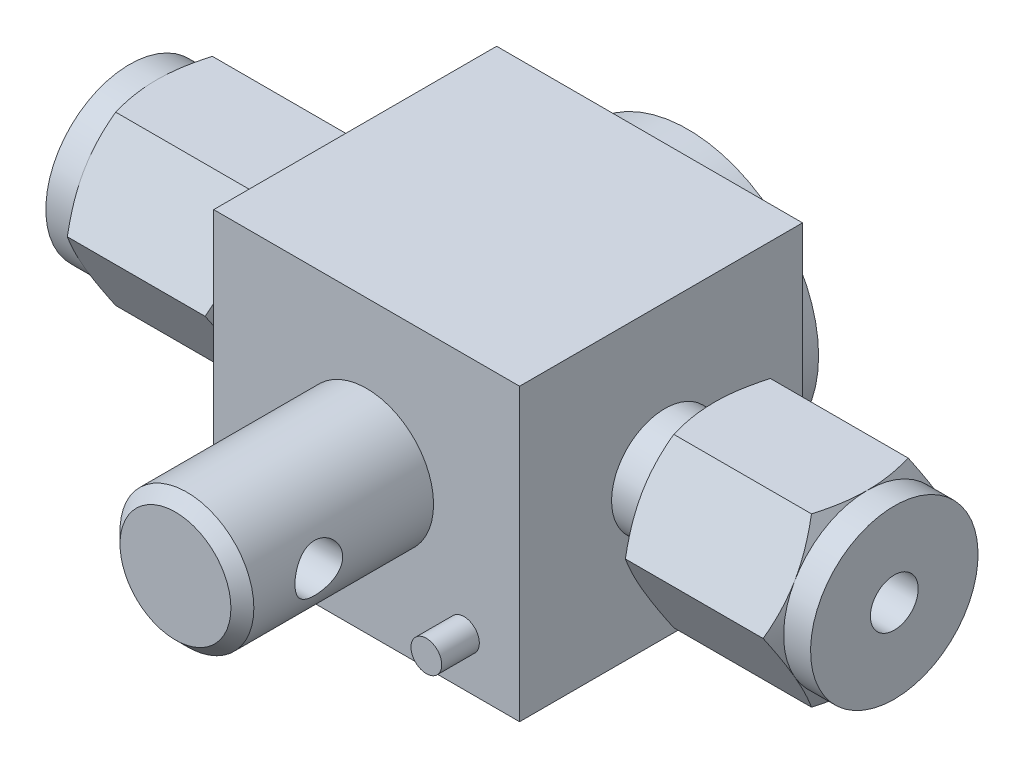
ISO-10303-21;
HEADER;
FILE_DESCRIPTION(('STEP AP214'),'2;1');
FILE_NAME('part.step','',(''),(''),'','','');
FILE_SCHEMA(('AUTOMOTIVE_DESIGN { 1 0 10303 214 1 1 1 1 }'));
ENDSEC;
DATA;
#1=APPLICATION_CONTEXT('core data for automotive mechanical design processes');
#2=APPLICATION_PROTOCOL_DEFINITION('international standard','automotive_design',2000,#1);
#3=PRODUCT_CONTEXT('',#1,'mechanical');
#4=PRODUCT('Part','Part','',(#3));
#5=PRODUCT_RELATED_PRODUCT_CATEGORY('part','',(#4));
#6=PRODUCT_DEFINITION_FORMATION('','',#4);
#7=PRODUCT_DEFINITION_CONTEXT('part definition',#1,'design');
#8=PRODUCT_DEFINITION('design','',#6,#7);
#9=PRODUCT_DEFINITION_SHAPE('','',#8);
#10=(LENGTH_UNIT() NAMED_UNIT(*) SI_UNIT(.MILLI.,.METRE.));
#11=(NAMED_UNIT(*) PLANE_ANGLE_UNIT() SI_UNIT($,.RADIAN.));
#12=(NAMED_UNIT(*) SI_UNIT($,.STERADIAN.) SOLID_ANGLE_UNIT());
#13=UNCERTAINTY_MEASURE_WITH_UNIT(LENGTH_MEASURE(1.E-05),#10,'distance_accuracy_value','');
#14=(GEOMETRIC_REPRESENTATION_CONTEXT(3) GLOBAL_UNCERTAINTY_ASSIGNED_CONTEXT((#13)) GLOBAL_UNIT_ASSIGNED_CONTEXT((#10,
#11,#12)) REPRESENTATION_CONTEXT('',''));
#15=CARTESIAN_POINT('',(0.,0.,0.));
#16=DIRECTION('',(0.,0.,1.));
#17=DIRECTION('',(1.,0.,0.));
#18=AXIS2_PLACEMENT_3D('',#15,#16,#17);
#19=CARTESIAN_POINT('',(25.4,0.,22.352));
#20=DIRECTION('',(0.,0.,-1.));
#21=DIRECTION('',(-1.,0.,0.));
#22=AXIS2_PLACEMENT_3D('',#19,#20,#21);
#23=CYLINDRICAL_SURFACE('',#22,4.445);
#24=CARTESIAN_POINT('',(25.4,0.,21.59));
#25=DIRECTION('',(0.,0.,1.));
#26=DIRECTION('',(1.,0.,0.));
#27=AXIS2_PLACEMENT_3D('',#24,#25,#26);
#28=CIRCLE('',#27,4.445);
#29=CARTESIAN_POINT('',(29.845,0.,21.59));
#30=VERTEX_POINT('',#29);
#31=EDGE_CURVE('E11',#30,#30,#28,.F.);
#32=ORIENTED_EDGE('',*,*,#31,.T.);
#33=EDGE_LOOP('',(#32));
#34=FACE_BOUND('',#33,.T.);
#35=CARTESIAN_POINT('',(25.4,0.,9.652));
#36=DIRECTION('',(0.,0.,1.));
#37=DIRECTION('',(1.,0.,0.));
#38=AXIS2_PLACEMENT_3D('',#35,#36,#37);
#39=CIRCLE('',#38,4.445);
#40=CARTESIAN_POINT('',(29.845,0.,9.652));
#41=VERTEX_POINT('',#40);
#42=EDGE_CURVE('E775',#41,#41,#39,.T.);
#43=ORIENTED_EDGE('',*,*,#42,.T.);
#44=EDGE_LOOP('',(#43));
#45=FACE_BOUND('',#44,.T.);
#46=CARTESIAN_POINT('',(29.845,0.,18.8595));
#47=CARTESIAN_POINT('',(29.8450012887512,-0.0862582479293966,18.8595017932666));
#48=CARTESIAN_POINT('',(29.8424667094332,-0.172503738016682,18.8524472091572));
#49=CARTESIAN_POINT('',(29.8326073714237,-0.34243320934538,18.824517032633));
#50=CARTESIAN_POINT('',(29.8252827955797,-0.426117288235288,18.8036419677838));
#51=CARTESIAN_POINT('',(29.8066339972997,-0.588449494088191,18.7488924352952));
#52=CARTESIAN_POINT('',(29.7953170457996,-0.667106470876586,18.7150415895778));
#53=CARTESIAN_POINT('',(29.7698228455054,-0.817623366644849,18.6354156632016));
#54=CARTESIAN_POINT('',(29.7556449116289,-0.889481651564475,18.5896377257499));
#55=CARTESIAN_POINT('',(29.7252858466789,-1.02716839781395,18.4855846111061));
#56=CARTESIAN_POINT('',(29.7090517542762,-1.09269539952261,18.4269261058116));
#57=CARTESIAN_POINT('',(29.6766838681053,-1.21321956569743,18.2995910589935));
#58=CARTESIAN_POINT('',(29.6605501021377,-1.26821392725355,18.2309118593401));
#59=CARTESIAN_POINT('',(29.629608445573,-1.3679407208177,18.0826424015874));
#60=CARTESIAN_POINT('',(29.6148639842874,-1.41226241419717,18.002761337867));
#61=CARTESIAN_POINT('',(29.5891861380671,-1.48671008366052,17.8360681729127));
#62=CARTESIAN_POINT('',(29.5782513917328,-1.51684113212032,17.7492585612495));
#63=CARTESIAN_POINT('',(29.5619934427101,-1.56088797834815,17.5746264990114));
#64=CARTESIAN_POINT('',(29.5564733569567,-1.57537479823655,17.4869669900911));
#65=CARTESIAN_POINT('',(29.5510906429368,-1.5895075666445,17.3103008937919));
#66=CARTESIAN_POINT('',(29.5512259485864,-1.58915893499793,17.2212948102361));
#67=CARTESIAN_POINT('',(29.5569677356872,-1.5740702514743,17.0495241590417));
#68=CARTESIAN_POINT('',(29.5622812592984,-1.56010077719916,16.9666803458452));
#69=CARTESIAN_POINT('',(29.5772972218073,-1.51943340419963,16.8046009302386));
#70=CARTESIAN_POINT('',(29.5870002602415,-1.4927337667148,16.7253658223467));
#71=CARTESIAN_POINT('',(29.6098923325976,-1.42690574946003,16.5711036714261));
#72=CARTESIAN_POINT('',(29.6231401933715,-1.38756514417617,16.4961763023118));
#73=CARTESIAN_POINT('',(29.6516073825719,-1.29771948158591,16.3537541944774));
#74=CARTESIAN_POINT('',(29.6668273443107,-1.24721083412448,16.2862618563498));
#75=CARTESIAN_POINT('',(29.6986483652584,-1.13285999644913,16.1563306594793));
#76=CARTESIAN_POINT('',(29.7152772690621,-1.06839595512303,16.0944446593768));
#77=CARTESIAN_POINT('',(29.747244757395,-0.929806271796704,15.9822059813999));
#78=CARTESIAN_POINT('',(29.7625831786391,-0.855679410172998,15.9318547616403));
#79=CARTESIAN_POINT('',(29.7904979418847,-0.698563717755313,15.8435798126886));
#80=CARTESIAN_POINT('',(29.8030362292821,-0.615473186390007,15.80582421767));
#81=CARTESIAN_POINT('',(29.8236587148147,-0.443562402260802,15.7450054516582));
#82=CARTESIAN_POINT('',(29.8317446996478,-0.354744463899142,15.7219363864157));
#83=CARTESIAN_POINT('',(29.8422453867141,-0.178565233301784,15.6921713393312));
#84=CARTESIAN_POINT('',(29.8449181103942,-0.0913451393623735,15.6847297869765));
#85=CARTESIAN_POINT('',(29.845078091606,0.0831274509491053,15.6842808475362));
#86=CARTESIAN_POINT('',(29.8425663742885,0.170379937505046,15.6912706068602));
#87=CARTESIAN_POINT('',(29.8328102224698,0.339324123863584,15.7189081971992));
#88=CARTESIAN_POINT('',(29.8257304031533,0.421103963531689,15.7390812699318));
#89=CARTESIAN_POINT('',(29.8077143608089,0.580072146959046,15.7919017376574));
#90=CARTESIAN_POINT('',(29.7967776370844,0.657259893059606,15.8245507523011));
#91=CARTESIAN_POINT('',(29.7717574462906,0.807286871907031,15.90240587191));
#92=CARTESIAN_POINT('',(29.7575939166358,0.879942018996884,15.9479402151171));
#93=CARTESIAN_POINT('',(29.7277053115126,1.0168123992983,16.0498964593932));
#94=CARTESIAN_POINT('',(29.7119797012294,1.08102472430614,16.1063220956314));
#95=CARTESIAN_POINT('',(29.6796843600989,1.20270455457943,16.2319523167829));
#96=CARTESIAN_POINT('',(29.663113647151,1.25964113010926,16.3016721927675));
#97=CARTESIAN_POINT('',(29.6318170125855,1.36109408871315,16.4500187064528));
#98=CARTESIAN_POINT('',(29.6170911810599,1.40560986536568,16.5286457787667));
#99=CARTESIAN_POINT('',(29.5912561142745,1.48087515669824,16.6929211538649));
#100=CARTESIAN_POINT('',(29.5801507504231,1.51160994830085,16.7785768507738));
#101=CARTESIAN_POINT('',(29.5630691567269,1.55804501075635,16.9543476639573));
#102=CARTESIAN_POINT('',(29.5570901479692,1.573753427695,17.0444603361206));
#103=CARTESIAN_POINT('',(29.5512845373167,1.58900022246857,17.2208955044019));
#104=CARTESIAN_POINT('',(29.5511175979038,1.58943311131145,17.3071302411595));
#105=CARTESIAN_POINT('',(29.556096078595,1.57636867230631,17.4783735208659));
#106=CARTESIAN_POINT('',(29.5612410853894,1.56287242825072,17.5633821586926));
#107=CARTESIAN_POINT('',(29.5759930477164,1.52300309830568,17.7276128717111));
#108=CARTESIAN_POINT('',(29.5854848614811,1.49696145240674,17.8069266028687));
#109=CARTESIAN_POINT('',(29.607804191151,1.43302129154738,17.9601131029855));
#110=CARTESIAN_POINT('',(29.6206325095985,1.39511992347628,18.0339845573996));
#111=CARTESIAN_POINT('',(29.6489579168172,1.30638748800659,18.1780978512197));
#112=CARTESIAN_POINT('',(29.6645545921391,1.25501635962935,18.2479874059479));
#113=CARTESIAN_POINT('',(29.6962856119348,1.14167198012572,18.3784414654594));
#114=CARTESIAN_POINT('',(29.712420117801,1.07969552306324,18.4390031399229));
#115=CARTESIAN_POINT('',(29.7443235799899,0.94339570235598,18.5519834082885));
#116=CARTESIAN_POINT('',(29.7600393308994,0.868627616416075,18.6038826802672));
#117=CARTESIAN_POINT('',(29.7885162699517,0.710889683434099,18.6943413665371));
#118=CARTESIAN_POINT('',(29.8012776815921,0.627920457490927,18.7329017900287));
#119=CARTESIAN_POINT('',(29.8224321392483,0.455705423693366,18.7954540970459));
#120=CARTESIAN_POINT('',(29.8308066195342,0.366434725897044,18.8193841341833));
#121=CARTESIAN_POINT('',(29.8420887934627,0.184770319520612,18.8514030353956));
#122=CARTESIAN_POINT('',(29.8449986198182,0.09237784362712,18.85949807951));
#123=CARTESIAN_POINT('',(29.845,0.,18.8595));
#124=B_SPLINE_CURVE_WITH_KNOTS('',3,(#46,#47,#48,#49,#50,#51,#52,#53,#54,#55,#56,#57,#58,#59,
#60,#61,#62,#63,#64,#65,#66,#67,#68,#69,#70,#71,#72,#73,#74,#75,#76,#77,#78,#79,#80,#81,#82,#83,
#84,#85,#86,#87,#88,#89,#90,#91,#92,#93,#94,#95,#96,#97,#98,#99,#100,#101,#102,#103,#104,#105,
#106,#107,#108,#109,#110,#111,#112,#113,#114,#115,#116,#117,#118,#119,#120,#121,#122,#123),
.UNSPECIFIED.,.T.,.F.,(4,2,2,2,2,2,2,2,2,2,2,2,2,2,2,2,2,2,2,2,2,2,2,2,2,2,2,2,2,2,2,2,2,2,2,2,
2,2,4),(0.,0.258434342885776,0.516858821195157,0.774815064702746,1.03283315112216,
1.29993753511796,1.56711290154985,1.84333900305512,2.11946629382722,2.3851334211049,
2.65070349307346,2.90207221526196,3.15347528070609,3.40934135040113,3.66528979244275,
3.93672474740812,4.20819399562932,4.48315413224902,4.75800384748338,5.01941166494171,
5.28076779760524,5.53319522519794,5.78565543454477,6.04523719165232,6.30490813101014,
6.5782087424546,6.85152269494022,7.125127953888,7.39858480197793,7.6560001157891,
7.91339540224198,8.16433522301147,8.41533545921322,8.67856687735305,8.94187801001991,
9.21761831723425,9.49333775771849,9.770214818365,10.046983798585),.UNSPECIFIED.);
#125=CARTESIAN_POINT('',(29.845,0.,18.8595));
#126=VERTEX_POINT('',#125);
#127=EDGE_CURVE('E776',#126,#126,#124,.T.);
#128=ORIENTED_EDGE('',*,*,#127,.F.);
#129=EDGE_LOOP('',(#128));
#130=FACE_BOUND('',#129,.T.);
#131=CARTESIAN_POINT('',(20.955,0.,18.8595));
#132=CARTESIAN_POINT('',(20.9549987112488,0.0862582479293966,18.8595017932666));
#133=CARTESIAN_POINT('',(20.9575332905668,0.172503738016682,18.8524472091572));
#134=CARTESIAN_POINT('',(20.9673926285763,0.34243320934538,18.824517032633));
#135=CARTESIAN_POINT('',(20.9747172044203,0.426117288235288,18.8036419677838));
#136=CARTESIAN_POINT('',(20.9933660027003,0.588449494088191,18.7488924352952));
#137=CARTESIAN_POINT('',(21.0046829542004,0.667106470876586,18.7150415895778));
#138=CARTESIAN_POINT('',(21.0301771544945,0.817623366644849,18.6354156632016));
#139=CARTESIAN_POINT('',(21.0443550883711,0.889481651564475,18.5896377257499));
#140=CARTESIAN_POINT('',(21.0747141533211,1.02716839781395,18.4855846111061));
#141=CARTESIAN_POINT('',(21.0909482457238,1.09269539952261,18.4269261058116));
#142=CARTESIAN_POINT('',(21.1233161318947,1.21321956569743,18.2995910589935));
#143=CARTESIAN_POINT('',(21.1394498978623,1.26821392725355,18.2309118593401));
#144=CARTESIAN_POINT('',(21.170391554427,1.3679407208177,18.0826424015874));
#145=CARTESIAN_POINT('',(21.1851360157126,1.41226241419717,18.002761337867));
#146=CARTESIAN_POINT('',(21.2108138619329,1.48671008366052,17.8360681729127));
#147=CARTESIAN_POINT('',(21.2217486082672,1.51684113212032,17.7492585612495));
#148=CARTESIAN_POINT('',(21.2380065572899,1.56088797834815,17.5746264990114));
#149=CARTESIAN_POINT('',(21.2435266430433,1.57537479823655,17.4869669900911));
#150=CARTESIAN_POINT('',(21.2489093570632,1.5895075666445,17.3103008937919));
#151=CARTESIAN_POINT('',(21.2487740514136,1.58915893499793,17.2212948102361));
#152=CARTESIAN_POINT('',(21.2430322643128,1.5740702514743,17.0495241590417));
#153=CARTESIAN_POINT('',(21.2377187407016,1.56010077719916,16.9666803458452));
#154=CARTESIAN_POINT('',(21.2227027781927,1.51943340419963,16.8046009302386));
#155=CARTESIAN_POINT('',(21.2129997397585,1.4927337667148,16.7253658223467));
#156=CARTESIAN_POINT('',(21.1901076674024,1.42690574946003,16.5711036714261));
#157=CARTESIAN_POINT('',(21.1768598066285,1.38756514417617,16.4961763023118));
#158=CARTESIAN_POINT('',(21.1483926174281,1.29771948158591,16.3537541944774));
#159=CARTESIAN_POINT('',(21.1331726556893,1.24721083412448,16.2862618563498));
#160=CARTESIAN_POINT('',(21.1013516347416,1.13285999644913,16.1563306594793));
#161=CARTESIAN_POINT('',(21.0847227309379,1.06839595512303,16.0944446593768));
#162=CARTESIAN_POINT('',(21.052755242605,0.929806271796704,15.9822059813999));
#163=CARTESIAN_POINT('',(21.0374168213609,0.855679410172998,15.9318547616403));
#164=CARTESIAN_POINT('',(21.0095020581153,0.698563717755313,15.8435798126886));
#165=CARTESIAN_POINT('',(20.9969637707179,0.615473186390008,15.80582421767));
#166=CARTESIAN_POINT('',(20.9763412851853,0.443562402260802,15.7450054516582));
#167=CARTESIAN_POINT('',(20.9682553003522,0.354744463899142,15.7219363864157));
#168=CARTESIAN_POINT('',(20.9577546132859,0.178565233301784,15.6921713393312));
#169=CARTESIAN_POINT('',(20.9550818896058,0.0913451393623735,15.6847297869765));
#170=CARTESIAN_POINT('',(20.9549219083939,-0.0831274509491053,15.6842808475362));
#171=CARTESIAN_POINT('',(20.9574336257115,-0.170379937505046,15.6912706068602));
#172=CARTESIAN_POINT('',(20.9671897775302,-0.339324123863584,15.7189081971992));
#173=CARTESIAN_POINT('',(20.9742695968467,-0.421103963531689,15.7390812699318));
#174=CARTESIAN_POINT('',(20.9922856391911,-0.580072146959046,15.7919017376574));
#175=CARTESIAN_POINT('',(21.0032223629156,-0.657259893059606,15.8245507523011));
#176=CARTESIAN_POINT('',(21.0282425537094,-0.807286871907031,15.90240587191));
#177=CARTESIAN_POINT('',(21.0424060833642,-0.879942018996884,15.9479402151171));
#178=CARTESIAN_POINT('',(21.0722946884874,-1.0168123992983,16.0498964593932));
#179=CARTESIAN_POINT('',(21.0880202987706,-1.08102472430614,16.1063220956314));
#180=CARTESIAN_POINT('',(21.1203156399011,-1.20270455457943,16.2319523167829));
#181=CARTESIAN_POINT('',(21.136886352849,-1.25964113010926,16.3016721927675));
#182=CARTESIAN_POINT('',(21.1681829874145,-1.36109408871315,16.4500187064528));
#183=CARTESIAN_POINT('',(21.1829088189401,-1.40560986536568,16.5286457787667));
#184=CARTESIAN_POINT('',(21.2087438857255,-1.48087515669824,16.6929211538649));
#185=CARTESIAN_POINT('',(21.2198492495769,-1.51160994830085,16.7785768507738));
#186=CARTESIAN_POINT('',(21.2369308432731,-1.55804501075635,16.9543476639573));
#187=CARTESIAN_POINT('',(21.2429098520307,-1.573753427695,17.0444603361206));
#188=CARTESIAN_POINT('',(21.2487154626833,-1.58900022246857,17.2208955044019));
#189=CARTESIAN_POINT('',(21.2488824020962,-1.58943311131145,17.3071302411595));
#190=CARTESIAN_POINT('',(21.243903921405,-1.57636867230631,17.4783735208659));
#191=CARTESIAN_POINT('',(21.2387589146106,-1.56287242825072,17.5633821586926));
#192=CARTESIAN_POINT('',(21.2240069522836,-1.52300309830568,17.7276128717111));
#193=CARTESIAN_POINT('',(21.2145151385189,-1.49696145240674,17.8069266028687));
#194=CARTESIAN_POINT('',(21.192195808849,-1.43302129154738,17.9601131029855));
#195=CARTESIAN_POINT('',(21.1793674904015,-1.39511992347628,18.0339845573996));
#196=CARTESIAN_POINT('',(21.1510420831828,-1.30638748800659,18.1780978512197));
#197=CARTESIAN_POINT('',(21.1354454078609,-1.25501635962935,18.2479874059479));
#198=CARTESIAN_POINT('',(21.1037143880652,-1.14167198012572,18.3784414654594));
#199=CARTESIAN_POINT('',(21.087579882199,-1.07969552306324,18.4390031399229));
#200=CARTESIAN_POINT('',(21.0556764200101,-0.943395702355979,18.5519834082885));
#201=CARTESIAN_POINT('',(21.0399606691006,-0.868627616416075,18.6038826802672));
#202=CARTESIAN_POINT('',(21.0114837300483,-0.710889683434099,18.6943413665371));
#203=CARTESIAN_POINT('',(20.9987223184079,-0.627920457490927,18.7329017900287));
#204=CARTESIAN_POINT('',(20.9775678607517,-0.455705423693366,18.7954540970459));
#205=CARTESIAN_POINT('',(20.9691933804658,-0.366434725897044,18.8193841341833));
#206=CARTESIAN_POINT('',(20.9579112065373,-0.184770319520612,18.8514030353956));
#207=CARTESIAN_POINT('',(20.9550013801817,-0.09237784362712,18.85949807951));
#208=CARTESIAN_POINT('',(20.955,0.,18.8595));
#209=B_SPLINE_CURVE_WITH_KNOTS('',3,(#131,#132,#133,#134,#135,#136,#137,#138,#139,#140,#141,
#142,#143,#144,#145,#146,#147,#148,#149,#150,#151,#152,#153,#154,#155,#156,#157,#158,#159,#160,
#161,#162,#163,#164,#165,#166,#167,#168,#169,#170,#171,#172,#173,#174,#175,#176,#177,#178,#179,
#180,#181,#182,#183,#184,#185,#186,#187,#188,#189,#190,#191,#192,#193,#194,#195,#196,#197,#198,
#199,#200,#201,#202,#203,#204,#205,#206,#207,#208),.UNSPECIFIED.,.T.,.F.,(4,2,2,2,2,2,2,2,2,2,2,
2,2,2,2,2,2,2,2,2,2,2,2,2,2,2,2,2,2,2,2,2,2,2,2,2,2,2,4),(0.,0.258434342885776,
0.516858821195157,0.774815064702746,1.03283315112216,1.29993753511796,1.56711290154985,
1.84333900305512,2.11946629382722,2.3851334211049,2.65070349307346,2.90207221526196,
3.15347528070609,3.40934135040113,3.66528979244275,3.93672474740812,4.20819399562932,
4.48315413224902,4.75800384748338,5.01941166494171,5.28076779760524,5.53319522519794,
5.78565543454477,6.04523719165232,6.30490813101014,6.5782087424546,6.85152269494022,
7.125127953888,7.39858480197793,7.6560001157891,7.91339540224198,8.16433522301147,
8.41533545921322,8.67856687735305,8.94187801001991,9.21761831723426,9.4933377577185,
9.770214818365,10.046983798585),.UNSPECIFIED.);
#210=CARTESIAN_POINT('',(20.955,0.,18.8595));
#211=VERTEX_POINT('',#210);
#212=EDGE_CURVE('E784',#211,#211,#209,.T.);
#213=ORIENTED_EDGE('',*,*,#212,.F.);
#214=EDGE_LOOP('',(#213));
#215=FACE_BOUND('',#214,.T.);
#216=ADVANCED_FACE('F39',(#34,#45,#130,#215),#23,.T.);
#217=CARTESIAN_POINT('',(10.033,0.,0.));
#218=DIRECTION('',(1.,0.,0.));
#219=DIRECTION('',(0.,0.,-1.));
#220=AXIS2_PLACEMENT_3D('',#217,#218,#219);
#221=CYLINDRICAL_SURFACE('',#220,1.1811);
#222=CARTESIAN_POINT('',(40.0558,0.,0.));
#223=DIRECTION('',(1.,0.,0.));
#224=DIRECTION('',(0.,0.,-1.));
#225=AXIS2_PLACEMENT_3D('',#222,#223,#224);
#226=CIRCLE('',#225,1.1811);
#227=CARTESIAN_POINT('',(40.0558,0.,-1.1811));
#228=VERTEX_POINT('',#227);
#229=EDGE_CURVE('E772',#228,#228,#226,.T.);
#230=ORIENTED_EDGE('',*,*,#229,.T.);
#231=EDGE_LOOP('',(#230));
#232=FACE_BOUND('',#231,.T.);
#233=CARTESIAN_POINT('',(10.7442,0.,0.));
#234=DIRECTION('',(1.,0.,0.));
#235=DIRECTION('',(0.,0.,-1.));
#236=AXIS2_PLACEMENT_3D('',#233,#234,#235);
#237=CIRCLE('',#236,1.1811);
#238=CARTESIAN_POINT('',(10.7442,0.,-1.1811));
#239=VERTEX_POINT('',#238);
#240=EDGE_CURVE('E769',#239,#239,#237,.F.);
#241=ORIENTED_EDGE('',*,*,#240,.T.);
#242=EDGE_LOOP('',(#241));
#243=FACE_BOUND('',#242,.T.);
#244=ADVANCED_FACE('F804',(#232,#243),#221,.F.);
#245=CARTESIAN_POINT('',(40.0558,0.,0.));
#246=DIRECTION('',(-1.,0.,0.));
#247=DIRECTION('',(0.,-1.,0.));
#248=AXIS2_PLACEMENT_3D('',#245,#246,#247);
#249=PLANE('',#248);
#250=CARTESIAN_POINT('',(40.0558,0.,0.));
#251=DIRECTION('',(-1.,0.,0.));
#252=DIRECTION('',(0.,-1.,0.));
#253=AXIS2_PLACEMENT_3D('',#250,#251,#252);
#254=CIRCLE('',#253,1.5875);
#255=CARTESIAN_POINT('',(40.0558,-1.5875,0.));
#256=VERTEX_POINT('',#255);
#257=EDGE_CURVE('E766',#256,#256,#254,.F.);
#258=ORIENTED_EDGE('',*,*,#257,.T.);
#259=EDGE_LOOP('',(#258));
#260=FACE_BOUND('',#259,.T.);
#261=ORIENTED_EDGE('',*,*,#229,.F.);
#262=EDGE_LOOP('',(#261));
#263=FACE_BOUND('',#262,.T.);
#264=ADVANCED_FACE('F812',(#260,#263),#249,.F.);
#265=CARTESIAN_POINT('',(10.7442,0.,0.));
#266=DIRECTION('',(1.,0.,0.));
#267=DIRECTION('',(0.,0.,-1.));
#268=AXIS2_PLACEMENT_3D('',#265,#266,#267);
#269=PLANE('',#268);
#270=CARTESIAN_POINT('',(10.7442,0.,0.));
#271=DIRECTION('',(1.,0.,0.));
#272=DIRECTION('',(0.,0.,-1.));
#273=AXIS2_PLACEMENT_3D('',#270,#271,#272);
#274=CIRCLE('',#273,1.5875);
#275=CARTESIAN_POINT('',(10.7442,0.,-1.5875));
#276=VERTEX_POINT('',#275);
#277=EDGE_CURVE('E763',#276,#276,#274,.F.);
#278=ORIENTED_EDGE('',*,*,#277,.T.);
#279=EDGE_LOOP('',(#278));
#280=FACE_BOUND('',#279,.T.);
#281=ORIENTED_EDGE('',*,*,#240,.F.);
#282=EDGE_LOOP('',(#281));
#283=FACE_BOUND('',#282,.T.);
#284=ADVANCED_FACE('F1281',(#280,#283),#269,.F.);
#285=CARTESIAN_POINT('',(45.4279,0.,0.));
#286=DIRECTION('',(-1.,0.,0.));
#287=DIRECTION('',(0.,-1.,0.));
#288=AXIS2_PLACEMENT_3D('',#285,#286,#287);
#289=CYLINDRICAL_SURFACE('',#288,1.5875);
#290=CARTESIAN_POINT('',(50.8,0.,0.));
#291=DIRECTION('',(-1.,0.,0.));
#292=DIRECTION('',(0.,-1.,0.));
#293=AXIS2_PLACEMENT_3D('',#290,#291,#292);
#294=CIRCLE('',#293,1.5875);
#295=CARTESIAN_POINT('',(50.8,-1.5875,0.));
#296=VERTEX_POINT('',#295);
#297=EDGE_CURVE('E760',#296,#296,#294,.T.);
#298=ORIENTED_EDGE('',*,*,#297,.F.);
#299=EDGE_LOOP('',(#298));
#300=FACE_BOUND('',#299,.T.);
#301=ORIENTED_EDGE('',*,*,#257,.F.);
#302=EDGE_LOOP('',(#301));
#303=FACE_BOUND('',#302,.T.);
#304=ADVANCED_FACE('F1295',(#300,#303),#289,.F.);
#305=CARTESIAN_POINT('',(5.3721,0.,0.));
#306=DIRECTION('',(1.,0.,0.));
#307=DIRECTION('',(0.,0.,-1.));
#308=AXIS2_PLACEMENT_3D('',#305,#306,#307);
#309=CYLINDRICAL_SURFACE('',#308,1.5875);
#310=CARTESIAN_POINT('',(0.,0.,0.));
#311=DIRECTION('',(1.,0.,0.));
#312=DIRECTION('',(0.,0.,-1.));
#313=AXIS2_PLACEMENT_3D('',#310,#311,#312);
#314=CIRCLE('',#313,1.5875);
#315=CARTESIAN_POINT('',(0.,0.,-1.5875));
#316=VERTEX_POINT('',#315);
#317=EDGE_CURVE('E757',#316,#316,#314,.T.);
#318=ORIENTED_EDGE('',*,*,#317,.F.);
#319=EDGE_LOOP('',(#318));
#320=FACE_BOUND('',#319,.T.);
#321=ORIENTED_EDGE('',*,*,#277,.F.);
#322=EDGE_LOOP('',(#321));
#323=FACE_BOUND('',#322,.T.);
#324=ADVANCED_FACE('F1305',(#320,#323),#309,.F.);
#325=CARTESIAN_POINT('',(50.8,0.,0.));
#326=DIRECTION('',(1.,0.,0.));
#327=DIRECTION('',(0.,1.,0.));
#328=AXIS2_PLACEMENT_3D('',#325,#326,#327);
#329=PLANE('',#328);
#330=CARTESIAN_POINT('',(50.8,0.,0.));
#331=DIRECTION('',(-1.,0.,0.));
#332=DIRECTION('',(0.,-1.,0.));
#333=AXIS2_PLACEMENT_3D('',#330,#331,#332);
#334=CIRCLE('',#333,5.5626);
#335=CARTESIAN_POINT('',(50.8,-5.5626,0.));
#336=VERTEX_POINT('',#335);
#337=EDGE_CURVE('E754',#336,#336,#334,.T.);
#338=ORIENTED_EDGE('',*,*,#337,.F.);
#339=EDGE_LOOP('',(#338));
#340=FACE_BOUND('',#339,.T.);
#341=ORIENTED_EDGE('',*,*,#297,.T.);
#342=EDGE_LOOP('',(#341));
#343=FACE_BOUND('',#342,.T.);
#344=ADVANCED_FACE('F1309',(#340,#343),#329,.T.);
#345=CARTESIAN_POINT('',(0.,0.,0.));
#346=DIRECTION('',(-1.,0.,0.));
#347=DIRECTION('',(0.,0.,1.));
#348=AXIS2_PLACEMENT_3D('',#345,#346,#347);
#349=PLANE('',#348);
#350=CARTESIAN_POINT('',(0.,0.,0.));
#351=DIRECTION('',(1.,0.,0.));
#352=DIRECTION('',(0.,0.,-1.));
#353=AXIS2_PLACEMENT_3D('',#350,#351,#352);
#354=CIRCLE('',#353,5.5626);
#355=CARTESIAN_POINT('',(0.,0.,-5.5626));
#356=VERTEX_POINT('',#355);
#357=EDGE_CURVE('E308',#356,#356,#354,.T.);
#358=ORIENTED_EDGE('',*,*,#357,.F.);
#359=EDGE_LOOP('',(#358));
#360=FACE_BOUND('',#359,.T.);
#361=ORIENTED_EDGE('',*,*,#317,.T.);
#362=EDGE_LOOP('',(#361));
#363=FACE_BOUND('',#362,.T.);
#364=ADVANCED_FACE('F1178',(#360,#363),#349,.T.);
#365=CARTESIAN_POINT('',(49.90465,0.,0.));
#366=DIRECTION('',(-1.,0.,0.));
#367=DIRECTION('',(0.,-1.,0.));
#368=AXIS2_PLACEMENT_3D('',#365,#366,#367);
#369=CYLINDRICAL_SURFACE('',#368,5.5626);
#370=ORIENTED_EDGE('',*,*,#337,.T.);
#371=EDGE_LOOP('',(#370));
#372=FACE_BOUND('',#371,.T.);
#373=CARTESIAN_POINT('',(49.0093000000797,0.,0.));
#374=DIRECTION('',(-1.,0.,0.));
#375=DIRECTION('',(0.,0.,1.));
#376=AXIS2_PLACEMENT_3D('',#373,#374,#375);
#377=CIRCLE('',#376,5.562599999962);
#378=CARTESIAN_POINT('',(49.0093000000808,-2.7812999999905,-4.81735291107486));
#379=VERTEX_POINT('',#378);
#380=CARTESIAN_POINT('',(49.0093000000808,-5.562599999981,0.));
#381=VERTEX_POINT('',#380);
#382=EDGE_CURVE('E295',#379,#381,#377,.T.);
#383=ORIENTED_EDGE('',*,*,#382,.F.);
#384=CARTESIAN_POINT('',(49.0093000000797,0.,0.));
#385=DIRECTION('',(-1.,0.,0.));
#386=DIRECTION('',(0.,0.,1.));
#387=AXIS2_PLACEMENT_3D('',#384,#385,#386);
#388=CIRCLE('',#387,5.562599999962);
#389=CARTESIAN_POINT('',(49.0093000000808,2.7812999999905,-4.81735291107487));
#390=VERTEX_POINT('',#389);
#391=EDGE_CURVE('E297',#390,#379,#388,.T.);
#392=ORIENTED_EDGE('',*,*,#391,.F.);
#393=CARTESIAN_POINT('',(49.0093000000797,0.,0.));
#394=DIRECTION('',(-1.,0.,0.));
#395=DIRECTION('',(0.,0.,1.));
#396=AXIS2_PLACEMENT_3D('',#393,#394,#395);
#397=CIRCLE('',#396,5.562599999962);
#398=CARTESIAN_POINT('',(49.0093000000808,5.562599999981,0.));
#399=VERTEX_POINT('',#398);
#400=EDGE_CURVE('E299',#399,#390,#397,.T.);
#401=ORIENTED_EDGE('',*,*,#400,.F.);
#402=CARTESIAN_POINT('',(49.0093000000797,0.,0.));
#403=DIRECTION('',(-1.,0.,0.));
#404=DIRECTION('',(0.,0.,1.));
#405=AXIS2_PLACEMENT_3D('',#402,#403,#404);
#406=CIRCLE('',#405,5.562599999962);
#407=CARTESIAN_POINT('',(49.0093000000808,2.7812999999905,4.81735291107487));
#408=VERTEX_POINT('',#407);
#409=EDGE_CURVE('E304',#408,#399,#406,.T.);
#410=ORIENTED_EDGE('',*,*,#409,.F.);
#411=CARTESIAN_POINT('',(49.0093000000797,0.,0.));
#412=DIRECTION('',(-1.,0.,0.));
#413=DIRECTION('',(0.,0.,1.));
#414=AXIS2_PLACEMENT_3D('',#411,#412,#413);
#415=CIRCLE('',#414,5.562599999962);
#416=CARTESIAN_POINT('',(49.0093000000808,-2.7812999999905,4.81735291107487));
#417=VERTEX_POINT('',#416);
#418=EDGE_CURVE('E306',#417,#408,#415,.T.);
#419=ORIENTED_EDGE('',*,*,#418,.F.);
#420=CARTESIAN_POINT('',(49.0093000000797,0.,0.));
#421=DIRECTION('',(-1.,0.,0.));
#422=DIRECTION('',(0.,0.,1.));
#423=AXIS2_PLACEMENT_3D('',#420,#421,#422);
#424=CIRCLE('',#423,5.562599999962);
#425=EDGE_CURVE('E237',#381,#417,#424,.T.);
#426=ORIENTED_EDGE('',*,*,#425,.F.);
#427=EDGE_LOOP('',(#383,#392,#401,#410,#419,#426));
#428=FACE_BOUND('',#427,.T.);
#429=ADVANCED_FACE('F1172',(#372,#428),#369,.T.);
#430=CARTESIAN_POINT('',(0.89535,0.,0.));
#431=DIRECTION('',(1.,0.,0.));
#432=DIRECTION('',(0.,0.,-1.));
#433=AXIS2_PLACEMENT_3D('',#430,#431,#432);
#434=CYLINDRICAL_SURFACE('',#433,5.5626);
#435=ORIENTED_EDGE('',*,*,#357,.T.);
#436=EDGE_LOOP('',(#435));
#437=FACE_BOUND('',#436,.T.);
#438=CARTESIAN_POINT('',(1.79069999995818,0.,0.));
#439=DIRECTION('',(1.,0.,0.));
#440=DIRECTION('',(0.,0.,1.));
#441=AXIS2_PLACEMENT_3D('',#438,#439,#440);
#442=CIRCLE('',#441,5.562599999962);
#443=CARTESIAN_POINT('',(1.79069999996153,2.7812999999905,-4.81735291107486));
#444=VERTEX_POINT('',#443);
#445=CARTESIAN_POINT('',(1.79069999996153,5.562599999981,0.));
#446=VERTEX_POINT('',#445);
#447=EDGE_CURVE('E279',#444,#446,#442,.T.);
#448=ORIENTED_EDGE('',*,*,#447,.F.);
#449=CARTESIAN_POINT('',(1.79069999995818,0.,0.));
#450=DIRECTION('',(1.,0.,0.));
#451=DIRECTION('',(0.,0.,1.));
#452=AXIS2_PLACEMENT_3D('',#449,#450,#451);
#453=CIRCLE('',#452,5.562599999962);
#454=CARTESIAN_POINT('',(1.79069999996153,-2.7812999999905,-4.81735291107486));
#455=VERTEX_POINT('',#454);
#456=EDGE_CURVE('E281',#455,#444,#453,.T.);
#457=ORIENTED_EDGE('',*,*,#456,.F.);
#458=CARTESIAN_POINT('',(1.79069999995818,0.,0.));
#459=DIRECTION('',(1.,0.,0.));
#460=DIRECTION('',(0.,0.,1.));
#461=AXIS2_PLACEMENT_3D('',#458,#459,#460);
#462=CIRCLE('',#461,5.562599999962);
#463=CARTESIAN_POINT('',(1.79069999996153,-5.562599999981,0.));
#464=VERTEX_POINT('',#463);
#465=EDGE_CURVE('E283',#464,#455,#462,.T.);
#466=ORIENTED_EDGE('',*,*,#465,.F.);
#467=CARTESIAN_POINT('',(1.79069999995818,0.,0.));
#468=DIRECTION('',(1.,0.,0.));
#469=DIRECTION('',(0.,0.,1.));
#470=AXIS2_PLACEMENT_3D('',#467,#468,#469);
#471=CIRCLE('',#470,5.562599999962);
#472=CARTESIAN_POINT('',(1.79069999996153,-2.7812999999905,4.81735291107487));
#473=VERTEX_POINT('',#472);
#474=EDGE_CURVE('E288',#473,#464,#471,.T.);
#475=ORIENTED_EDGE('',*,*,#474,.F.);
#476=CARTESIAN_POINT('',(1.79069999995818,0.,0.));
#477=DIRECTION('',(1.,0.,0.));
#478=DIRECTION('',(0.,0.,1.));
#479=AXIS2_PLACEMENT_3D('',#476,#477,#478);
#480=CIRCLE('',#479,5.562599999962);
#481=CARTESIAN_POINT('',(1.79069999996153,2.7812999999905,4.81735291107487));
#482=VERTEX_POINT('',#481);
#483=EDGE_CURVE('E290',#482,#473,#480,.T.);
#484=ORIENTED_EDGE('',*,*,#483,.F.);
#485=CARTESIAN_POINT('',(1.79069999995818,0.,0.));
#486=DIRECTION('',(1.,0.,0.));
#487=DIRECTION('',(0.,0.,1.));
#488=AXIS2_PLACEMENT_3D('',#485,#486,#487);
#489=CIRCLE('',#488,5.562599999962);
#490=EDGE_CURVE('E241',#446,#482,#489,.T.);
#491=ORIENTED_EDGE('',*,*,#490,.F.);
#492=EDGE_LOOP('',(#448,#457,#466,#475,#484,#491));
#493=FACE_BOUND('',#492,.T.);
#494=ADVANCED_FACE('F1177',(#437,#493),#434,.T.);
#495=CARTESIAN_POINT('',(48.5094876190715,0.,0.));
#496=DIRECTION('',(-1.,0.,0.));
#497=DIRECTION('',(0.,-1.,0.));
#498=AXIS2_PLACEMENT_3D('',#495,#496,#497);
#499=CONICAL_SURFACE('',#498,6.42830043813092,1.0471975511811);
#500=ORIENTED_EDGE('',*,*,#418,.T.);
#501=CARTESIAN_POINT('',(48.5124686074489,-1.77964686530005E-11,6.42313721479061));
#502=CARTESIAN_POINT('',(48.5879530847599,0.226396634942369,6.292427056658));
#503=CARTESIAN_POINT('',(48.6571100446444,0.454606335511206,6.16067012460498));
#504=CARTESIAN_POINT('',(48.7790670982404,0.913037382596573,5.89599483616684));
#505=CARTESIAN_POINT('',(48.8319480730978,1.14324273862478,5.76308571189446));
#506=CARTESIAN_POINT('',(48.8968769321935,1.49072335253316,5.56246768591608));
#507=CARTESIAN_POINT('',(48.9161289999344,1.60698916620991,5.4953415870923));
#508=CARTESIAN_POINT('',(48.9494547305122,1.84007740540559,5.36076802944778));
#509=CARTESIAN_POINT('',(48.963528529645,1.95689981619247,5.29332057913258));
#510=CARTESIAN_POINT('',(48.9862504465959,2.1915333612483,5.15785483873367));
#511=CARTESIAN_POINT('',(48.9948709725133,2.30934651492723,5.08983538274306));
#512=CARTESIAN_POINT('',(49.0064076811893,2.54520452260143,4.95366269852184));
#513=CARTESIAN_POINT('',(49.0093227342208,2.66324941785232,4.88550944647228));
#514=CARTESIAN_POINT('',(49.0093000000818,2.7813,4.81735291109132));
#515=B_SPLINE_CURVE_WITH_KNOTS('',3,(#501,#502,#503,#504,#505,#506,#507,#508,#509,#510,#511,
#512,#513,#514),.UNSPECIFIED.,.F.,.F.,(4,2,2,2,2,2,4),(0.,0.816630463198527,1.62913471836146,
2.03591993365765,2.44269444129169,2.85151097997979,3.26040845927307),.UNSPECIFIED.);
#516=CARTESIAN_POINT('',(48.5124686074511,0.,6.42313721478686));
#517=VERTEX_POINT('',#516);
#518=EDGE_CURVE('E276',#517,#408,#515,.T.);
#519=ORIENTED_EDGE('',*,*,#518,.F.);
#520=CARTESIAN_POINT('',(49.0093000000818,-2.7813,4.81735291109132));
#521=CARTESIAN_POINT('',(49.0093227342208,-2.66324941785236,4.88550944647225));
#522=CARTESIAN_POINT('',(49.0064076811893,-2.54520452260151,4.95366269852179));
#523=CARTESIAN_POINT('',(48.9948709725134,-2.30934651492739,5.08983538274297));
#524=CARTESIAN_POINT('',(48.986250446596,-2.1915333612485,5.15785483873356));
#525=CARTESIAN_POINT('',(48.9635285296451,-1.95689981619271,5.29332057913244));
#526=CARTESIAN_POINT('',(48.9494547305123,-1.84007740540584,5.36076802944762));
#527=CARTESIAN_POINT('',(48.9161289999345,-1.6069891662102,5.49534158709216));
#528=CARTESIAN_POINT('',(48.8968769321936,-1.49072335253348,5.56246768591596));
#529=CARTESIAN_POINT('',(48.8319480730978,-1.14324273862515,5.76308571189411));
#530=CARTESIAN_POINT('',(48.7790670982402,-0.913037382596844,5.89599483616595));
#531=CARTESIAN_POINT('',(48.657110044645,-0.454606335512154,6.16067012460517));
#532=CARTESIAN_POINT('',(48.5879530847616,-0.226396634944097,6.29242705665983));
#533=CARTESIAN_POINT('',(48.5124686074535,1.42943896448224E-11,6.42313721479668));
#534=B_SPLINE_CURVE_WITH_KNOTS('',3,(#520,#521,#522,#523,#524,#525,#526,#527,#528,#529,#530,
#531,#532,#533),.UNSPECIFIED.,.F.,.F.,(4,2,2,2,2,2,4),(0.,0.408897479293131,0.817714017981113,
1.2244885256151,1.63127374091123,2.44377799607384,3.26040845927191),.UNSPECIFIED.);
#535=EDGE_CURVE('E240',#417,#517,#534,.T.);
#536=ORIENTED_EDGE('',*,*,#535,.F.);
#537=EDGE_LOOP('',(#500,#519,#536));
#538=FACE_BOUND('',#537,.T.);
#539=ADVANCED_FACE('F1190',(#538),#499,.T.);
#540=CARTESIAN_POINT('',(48.5094876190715,0.,0.));
#541=DIRECTION('',(-1.,0.,0.));
#542=DIRECTION('',(0.,-1.,0.));
#543=AXIS2_PLACEMENT_3D('',#540,#541,#542);
#544=CONICAL_SURFACE('',#543,6.42830043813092,1.0471975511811);
#545=CARTESIAN_POINT('',(49.0093000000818,2.7813,4.81735291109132));
#546=CARTESIAN_POINT('',(49.0093227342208,2.89935058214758,4.74919637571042));
#547=CARTESIAN_POINT('',(49.0064076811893,3.01739547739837,4.68104312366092));
#548=CARTESIAN_POINT('',(48.9948709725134,3.25325348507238,4.5448704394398));
#549=CARTESIAN_POINT('',(48.986250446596,3.37106663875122,4.47685098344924));
#550=CARTESIAN_POINT('',(48.9635285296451,3.6057001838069,4.34138524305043));
#551=CARTESIAN_POINT('',(48.9494547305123,3.72252259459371,4.27393779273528));
#552=CARTESIAN_POINT('',(48.9161289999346,3.95561083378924,4.13936423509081));
#553=CARTESIAN_POINT('',(48.8968769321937,4.07187664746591,4.07223813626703));
#554=CARTESIAN_POINT('',(48.831948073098,4.41935726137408,3.87162011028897));
#555=CARTESIAN_POINT('',(48.7790670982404,4.64956261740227,3.7387109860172));
#556=CARTESIAN_POINT('',(48.6571100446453,5.10799366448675,3.4740356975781));
#557=CARTESIAN_POINT('',(48.587953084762,5.33620336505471,3.3422787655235));
#558=CARTESIAN_POINT('',(48.5124686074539,5.56260000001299,3.21156860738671));
#559=B_SPLINE_CURVE_WITH_KNOTS('',3,(#545,#546,#547,#548,#549,#550,#551,#552,#553,#554,#555,
#556,#557,#558),.UNSPECIFIED.,.F.,.F.,(4,2,2,2,2,2,4),(0.,0.408897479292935,0.817714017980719,
1.22448852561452,1.63127374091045,2.44377799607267,3.26040845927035),.UNSPECIFIED.);
#560=CARTESIAN_POINT('',(48.5124686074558,5.56260000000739,3.21156860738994));
#561=VERTEX_POINT('',#560);
#562=EDGE_CURVE('E272',#408,#561,#559,.T.);
#563=ORIENTED_EDGE('',*,*,#562,.F.);
#564=ORIENTED_EDGE('',*,*,#409,.T.);
#565=CARTESIAN_POINT('',(48.5124686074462,5.56259999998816,3.21156860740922));
#566=CARTESIAN_POINT('',(48.5879530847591,5.56259999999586,2.95014829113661));
#567=CARTESIAN_POINT('',(48.6571100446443,5.56259999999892,2.68663442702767));
#568=CARTESIAN_POINT('',(48.7790670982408,5.56260000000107,2.15728385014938));
#569=CARTESIAN_POINT('',(48.831948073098,5.5626000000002,1.89146560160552));
#570=CARTESIAN_POINT('',(48.8968769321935,5.5625999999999,1.49022954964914));
#571=CARTESIAN_POINT('',(48.9161289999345,5.56259999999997,1.35597735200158));
#572=CARTESIAN_POINT('',(48.9494547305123,5.56260000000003,1.08683023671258));
#573=CARTESIAN_POINT('',(48.9635285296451,5.56260000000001,0.951935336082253));
#574=CARTESIAN_POINT('',(48.9862504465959,5.56259999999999,0.681003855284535));
#575=CARTESIAN_POINT('',(48.9948709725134,5.5626,0.544964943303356));
#576=CARTESIAN_POINT('',(49.0064076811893,5.5626,0.272619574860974));
#577=CARTESIAN_POINT('',(49.0093227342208,5.56260000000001,0.136313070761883));
#578=CARTESIAN_POINT('',(49.0093000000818,5.5626,0.));
#579=B_SPLINE_CURVE_WITH_KNOTS('',3,(#565,#566,#567,#568,#569,#570,#571,#572,#573,#574,#575,
#576,#577,#578),.UNSPECIFIED.,.F.,.F.,(4,2,2,2,2,2,4),(0.,0.816630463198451,1.62913471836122,
2.03591993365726,2.44269444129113,2.85151097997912,3.2604084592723),.UNSPECIFIED.);
#580=EDGE_CURVE('E271',#561,#399,#579,.T.);
#581=ORIENTED_EDGE('',*,*,#580,.F.);
#582=EDGE_LOOP('',(#563,#564,#581));
#583=FACE_BOUND('',#582,.T.);
#584=ADVANCED_FACE('F581',(#583),#544,.T.);
#585=CARTESIAN_POINT('',(48.5094876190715,0.,0.));
#586=DIRECTION('',(-1.,0.,0.));
#587=DIRECTION('',(0.,-1.,0.));
#588=AXIS2_PLACEMENT_3D('',#585,#586,#587);
#589=CONICAL_SURFACE('',#588,6.42830043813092,1.0471975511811);
#590=CARTESIAN_POINT('',(49.0093000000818,5.5626,0.));
#591=CARTESIAN_POINT('',(49.0093227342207,5.5626,-0.136313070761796));
#592=CARTESIAN_POINT('',(49.0064076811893,5.5626,-0.272619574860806));
#593=CARTESIAN_POINT('',(48.9948709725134,5.5626,-0.54496494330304));
#594=CARTESIAN_POINT('',(48.986250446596,5.5626,-0.681003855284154));
#595=CARTESIAN_POINT('',(48.9635285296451,5.5626,-0.951935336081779));
#596=CARTESIAN_POINT('',(48.9494547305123,5.5626,-1.08683023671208));
#597=CARTESIAN_POINT('',(48.9161289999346,5.5626,-1.35597735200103));
#598=CARTESIAN_POINT('',(48.8968769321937,5.5626,-1.49022954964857));
#599=CARTESIAN_POINT('',(48.831948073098,5.5626,-1.89146560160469));
#600=CARTESIAN_POINT('',(48.7790670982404,5.5626,-2.15728385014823));
#601=CARTESIAN_POINT('',(48.6571100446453,5.5626,-2.68663442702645));
#602=CARTESIAN_POINT('',(48.587953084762,5.5626,-2.95014829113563));
#603=CARTESIAN_POINT('',(48.5124686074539,5.5626,-3.21156860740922));
#604=B_SPLINE_CURVE_WITH_KNOTS('',3,(#590,#591,#592,#593,#594,#595,#596,#597,#598,#599,#600,
#601,#602,#603),.UNSPECIFIED.,.F.,.F.,(4,2,2,2,2,2,4),(0.,0.408897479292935,0.817714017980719,
1.22448852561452,1.63127374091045,2.44377799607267,3.26040845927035),.UNSPECIFIED.);
#605=CARTESIAN_POINT('',(48.5124686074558,5.5626,-3.21156860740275));
#606=VERTEX_POINT('',#605);
#607=EDGE_CURVE('E267',#399,#606,#604,.T.);
#608=ORIENTED_EDGE('',*,*,#607,.F.);
#609=ORIENTED_EDGE('',*,*,#400,.T.);
#610=CARTESIAN_POINT('',(48.5124686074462,5.56260000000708,-3.21156860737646));
#611=CARTESIAN_POINT('',(48.5879530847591,5.33620336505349,-3.34227876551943));
#612=CARTESIAN_POINT('',(48.6571100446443,5.10799366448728,-3.47403569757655));
#613=CARTESIAN_POINT('',(48.7790670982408,4.64956261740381,-3.73871098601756));
#614=CARTESIAN_POINT('',(48.831948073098,4.4193572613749,-3.87162011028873));
#615=CARTESIAN_POINT('',(48.8968769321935,4.07187664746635,-4.07223813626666));
#616=CARTESIAN_POINT('',(48.9161289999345,3.95561083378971,-4.13936423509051));
#617=CARTESIAN_POINT('',(48.9494547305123,3.72252259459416,-4.27393779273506));
#618=CARTESIAN_POINT('',(48.9635285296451,3.60570018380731,-4.3413852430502));
#619=CARTESIAN_POINT('',(48.9862504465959,3.37106663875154,-4.47685098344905));
#620=CARTESIAN_POINT('',(48.9948709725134,3.25325348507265,-4.54487043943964));
#621=CARTESIAN_POINT('',(49.0064076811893,3.01739547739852,-4.68104312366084));
#622=CARTESIAN_POINT('',(49.0093227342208,2.89935058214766,-4.74919637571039));
#623=CARTESIAN_POINT('',(49.0093000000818,2.7813,-4.81735291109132));
#624=B_SPLINE_CURVE_WITH_KNOTS('',3,(#610,#611,#612,#613,#614,#615,#616,#617,#618,#619,#620,
#621,#622,#623),.UNSPECIFIED.,.F.,.F.,(4,2,2,2,2,2,4),(0.,0.816630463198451,1.62913471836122,
2.03591993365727,2.44269444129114,2.85151097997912,3.26040845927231),.UNSPECIFIED.);
#625=EDGE_CURVE('E266',#606,#390,#624,.T.);
#626=ORIENTED_EDGE('',*,*,#625,.F.);
#627=EDGE_LOOP('',(#608,#609,#626));
#628=FACE_BOUND('',#627,.T.);
#629=ADVANCED_FACE('F574',(#628),#589,.T.);
#630=CARTESIAN_POINT('',(48.5094876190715,0.,0.));
#631=DIRECTION('',(-1.,0.,0.));
#632=DIRECTION('',(0.,-1.,0.));
#633=AXIS2_PLACEMENT_3D('',#630,#631,#632);
#634=CONICAL_SURFACE('',#633,6.42830043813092,1.0471975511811);
#635=ORIENTED_EDGE('',*,*,#391,.T.);
#636=CARTESIAN_POINT('',(48.5124686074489,1.77972339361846E-11,-6.42313721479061));
#637=CARTESIAN_POINT('',(48.5879530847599,-0.22639663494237,-6.29242705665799));
#638=CARTESIAN_POINT('',(48.6571100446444,-0.454606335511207,-6.16067012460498));
#639=CARTESIAN_POINT('',(48.7790670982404,-0.913037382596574,-5.89599483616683));
#640=CARTESIAN_POINT('',(48.8319480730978,-1.14324273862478,-5.76308571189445));
#641=CARTESIAN_POINT('',(48.8968769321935,-1.49072335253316,-5.56246768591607));
#642=CARTESIAN_POINT('',(48.9161289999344,-1.60698916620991,-5.4953415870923));
#643=CARTESIAN_POINT('',(48.9494547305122,-1.84007740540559,-5.36076802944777));
#644=CARTESIAN_POINT('',(48.963528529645,-1.95689981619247,-5.29332057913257));
#645=CARTESIAN_POINT('',(48.9862504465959,-2.1915333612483,-5.15785483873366));
#646=CARTESIAN_POINT('',(48.9948709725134,-2.30934651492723,-5.08983538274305));
#647=CARTESIAN_POINT('',(49.0064076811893,-2.54520452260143,-4.95366269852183));
#648=CARTESIAN_POINT('',(49.0093227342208,-2.66324941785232,-4.88550944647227));
#649=CARTESIAN_POINT('',(49.0093000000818,-2.7813,-4.81735291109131));
#650=B_SPLINE_CURVE_WITH_KNOTS('',3,(#636,#637,#638,#639,#640,#641,#642,#643,#644,#645,#646,
#647,#648,#649),.UNSPECIFIED.,.F.,.F.,(4,2,2,2,2,2,4),(0.,0.816630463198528,1.62913471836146,
2.03591993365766,2.44269444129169,2.85151097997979,3.26040845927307),.UNSPECIFIED.);
#651=CARTESIAN_POINT('',(48.5124686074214,0.,-6.42313721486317));
#652=VERTEX_POINT('',#651);
#653=EDGE_CURVE('E555',#652,#379,#650,.T.);
#654=ORIENTED_EDGE('',*,*,#653,.F.);
#655=CARTESIAN_POINT('',(49.0093000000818,2.7813,-4.81735291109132));
#656=CARTESIAN_POINT('',(49.0093227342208,2.66324941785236,-4.88550944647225));
#657=CARTESIAN_POINT('',(49.0064076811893,2.54520452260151,-4.95366269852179));
#658=CARTESIAN_POINT('',(48.9948709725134,2.30934651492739,-5.08983538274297));
#659=CARTESIAN_POINT('',(48.986250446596,2.1915333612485,-5.15785483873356));
#660=CARTESIAN_POINT('',(48.9635285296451,1.95689981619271,-5.29332057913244));
#661=CARTESIAN_POINT('',(48.9494547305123,1.84007740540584,-5.36076802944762));
#662=CARTESIAN_POINT('',(48.9161289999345,1.6069891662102,-5.49534158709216));
#663=CARTESIAN_POINT('',(48.8968769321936,1.49072335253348,-5.56246768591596));
#664=CARTESIAN_POINT('',(48.8319480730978,1.14324273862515,-5.76308571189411));
#665=CARTESIAN_POINT('',(48.7790670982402,0.913037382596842,-5.89599483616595));
#666=CARTESIAN_POINT('',(48.657110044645,0.454606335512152,-6.16067012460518));
#667=CARTESIAN_POINT('',(48.5879530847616,0.226396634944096,-6.29242705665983));
#668=CARTESIAN_POINT('',(48.5124686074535,-1.42936226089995E-11,-6.42313721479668));
#669=B_SPLINE_CURVE_WITH_KNOTS('',3,(#655,#656,#657,#658,#659,#660,#661,#662,#663,#664,#665,
#666,#667,#668),.UNSPECIFIED.,.F.,.F.,(4,2,2,2,2,2,4),(0.,0.408897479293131,0.817714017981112,
1.2244885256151,1.63127374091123,2.44377799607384,3.26040845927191),.UNSPECIFIED.);
#670=EDGE_CURVE('E563',#390,#652,#669,.T.);
#671=ORIENTED_EDGE('',*,*,#670,.F.);
#672=EDGE_LOOP('',(#635,#654,#671));
#673=FACE_BOUND('',#672,.T.);
#674=ADVANCED_FACE('F569',(#673),#634,.T.);
#675=CARTESIAN_POINT('',(48.5094876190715,0.,0.));
#676=DIRECTION('',(-1.,0.,0.));
#677=DIRECTION('',(0.,-1.,0.));
#678=AXIS2_PLACEMENT_3D('',#675,#676,#677);
#679=CONICAL_SURFACE('',#678,6.42830043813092,1.0471975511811);
#680=ORIENTED_EDGE('',*,*,#382,.T.);
#681=CARTESIAN_POINT('',(48.5124686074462,-5.56259999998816,-3.21156860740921));
#682=CARTESIAN_POINT('',(48.5879530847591,-5.56259999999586,-2.95014829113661));
#683=CARTESIAN_POINT('',(48.6571100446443,-5.56259999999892,-2.68663442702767));
#684=CARTESIAN_POINT('',(48.7790670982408,-5.56260000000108,-2.15728385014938));
#685=CARTESIAN_POINT('',(48.831948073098,-5.5626000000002,-1.89146560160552));
#686=CARTESIAN_POINT('',(48.8968769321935,-5.5625999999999,-1.49022954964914));
#687=CARTESIAN_POINT('',(48.9161289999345,-5.56259999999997,-1.35597735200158));
#688=CARTESIAN_POINT('',(48.9494547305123,-5.56260000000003,-1.08683023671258));
#689=CARTESIAN_POINT('',(48.9635285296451,-5.56260000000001,-0.951935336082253));
#690=CARTESIAN_POINT('',(48.986250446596,-5.56259999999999,-0.681003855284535));
#691=CARTESIAN_POINT('',(48.9948709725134,-5.5626,-0.544964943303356));
#692=CARTESIAN_POINT('',(49.0064076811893,-5.5626,-0.272619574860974));
#693=CARTESIAN_POINT('',(49.0093227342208,-5.56260000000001,-0.136313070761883));
#694=CARTESIAN_POINT('',(49.0093000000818,-5.5626,0.));
#695=B_SPLINE_CURVE_WITH_KNOTS('',3,(#681,#682,#683,#684,#685,#686,#687,#688,#689,#690,#691,
#692,#693,#694),.UNSPECIFIED.,.F.,.F.,(4,2,2,2,2,2,4),(0.,0.816630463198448,1.62913471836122,
2.03591993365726,2.44269444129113,2.85151097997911,3.2604084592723),.UNSPECIFIED.);
#696=CARTESIAN_POINT('',(48.5124686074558,-5.56260000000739,-3.21156860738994));
#697=VERTEX_POINT('',#696);
#698=EDGE_CURVE('E229',#697,#381,#695,.T.);
#699=ORIENTED_EDGE('',*,*,#698,.F.);
#700=CARTESIAN_POINT('',(49.0093000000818,-2.7813,-4.81735291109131));
#701=CARTESIAN_POINT('',(49.0093227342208,-2.89935058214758,-4.74919637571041));
#702=CARTESIAN_POINT('',(49.0064076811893,-3.01739547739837,-4.68104312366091));
#703=CARTESIAN_POINT('',(48.9948709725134,-3.25325348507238,-4.54487043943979));
#704=CARTESIAN_POINT('',(48.986250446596,-3.37106663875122,-4.47685098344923));
#705=CARTESIAN_POINT('',(48.9635285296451,-3.6057001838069,-4.34138524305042));
#706=CARTESIAN_POINT('',(48.9494547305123,-3.72252259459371,-4.27393779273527));
#707=CARTESIAN_POINT('',(48.9161289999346,-3.95561083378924,-4.1393642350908));
#708=CARTESIAN_POINT('',(48.8968769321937,-4.07187664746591,-4.07223813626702));
#709=CARTESIAN_POINT('',(48.831948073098,-4.41935726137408,-3.87162011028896));
#710=CARTESIAN_POINT('',(48.7790670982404,-4.64956261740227,-3.73871098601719));
#711=CARTESIAN_POINT('',(48.6571100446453,-5.10799366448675,-3.47403569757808));
#712=CARTESIAN_POINT('',(48.587953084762,-5.33620336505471,-3.34227876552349));
#713=CARTESIAN_POINT('',(48.5124686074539,-5.56260000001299,-3.2115686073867));
#714=B_SPLINE_CURVE_WITH_KNOTS('',3,(#700,#701,#702,#703,#704,#705,#706,#707,#708,#709,#710,
#711,#712,#713),.UNSPECIFIED.,.F.,.F.,(4,2,2,2,2,2,4),(0.,0.408897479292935,0.817714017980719,
1.22448852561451,1.63127374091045,2.44377799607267,3.26040845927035),.UNSPECIFIED.);
#715=EDGE_CURVE('E262',#379,#697,#714,.T.);
#716=ORIENTED_EDGE('',*,*,#715,.F.);
#717=EDGE_LOOP('',(#680,#699,#716));
#718=FACE_BOUND('',#717,.T.);
#719=ADVANCED_FACE('F573',(#718),#679,.T.);
#720=CARTESIAN_POINT('',(48.5094876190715,0.,0.));
#721=DIRECTION('',(-1.,0.,0.));
#722=DIRECTION('',(0.,-1.,0.));
#723=AXIS2_PLACEMENT_3D('',#720,#721,#722);
#724=CONICAL_SURFACE('',#723,6.42830043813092,1.0471975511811);
#725=CARTESIAN_POINT('',(49.0093000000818,-5.5626,0.));
#726=CARTESIAN_POINT('',(49.0093227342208,-5.5626,0.136313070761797));
#727=CARTESIAN_POINT('',(49.0064076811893,-5.5626,0.272619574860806));
#728=CARTESIAN_POINT('',(48.9948709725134,-5.5626,0.54496494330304));
#729=CARTESIAN_POINT('',(48.986250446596,-5.5626,0.681003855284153));
#730=CARTESIAN_POINT('',(48.9635285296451,-5.5626,0.951935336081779));
#731=CARTESIAN_POINT('',(48.9494547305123,-5.5626,1.08683023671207));
#732=CARTESIAN_POINT('',(48.9161289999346,-5.5626,1.35597735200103));
#733=CARTESIAN_POINT('',(48.8968769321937,-5.5626,1.49022954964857));
#734=CARTESIAN_POINT('',(48.831948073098,-5.5626,1.89146560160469));
#735=CARTESIAN_POINT('',(48.7790670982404,-5.5626,2.15728385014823));
#736=CARTESIAN_POINT('',(48.6571100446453,-5.5626,2.68663442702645));
#737=CARTESIAN_POINT('',(48.587953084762,-5.5626,2.95014829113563));
#738=CARTESIAN_POINT('',(48.5124686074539,-5.5626,3.21156860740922));
#739=B_SPLINE_CURVE_WITH_KNOTS('',3,(#725,#726,#727,#728,#729,#730,#731,#732,#733,#734,#735,
#736,#737,#738),.UNSPECIFIED.,.F.,.F.,(4,2,2,2,2,2,4),(0.,0.408897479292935,0.817714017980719,
1.22448852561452,1.63127374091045,2.44377799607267,3.26040845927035),.UNSPECIFIED.);
#740=CARTESIAN_POINT('',(48.5124686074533,-5.56260000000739,3.21156860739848));
#741=VERTEX_POINT('',#740);
#742=EDGE_CURVE('E220',#381,#741,#739,.T.);
#743=ORIENTED_EDGE('',*,*,#742,.F.);
#744=ORIENTED_EDGE('',*,*,#425,.T.);
#745=CARTESIAN_POINT('',(48.5124686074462,-5.56260000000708,3.21156860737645));
#746=CARTESIAN_POINT('',(48.5879530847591,-5.33620336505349,3.34227876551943));
#747=CARTESIAN_POINT('',(48.6571100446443,-5.10799366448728,3.47403569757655));
#748=CARTESIAN_POINT('',(48.7790670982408,-4.64956261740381,3.73871098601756));
#749=CARTESIAN_POINT('',(48.831948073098,-4.4193572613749,3.87162011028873));
#750=CARTESIAN_POINT('',(48.8968769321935,-4.07187664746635,4.07223813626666));
#751=CARTESIAN_POINT('',(48.9161289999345,-3.95561083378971,4.13936423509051));
#752=CARTESIAN_POINT('',(48.9494547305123,-3.72252259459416,4.27393779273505));
#753=CARTESIAN_POINT('',(48.9635285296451,-3.60570018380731,4.3413852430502));
#754=CARTESIAN_POINT('',(48.9862504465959,-3.37106663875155,4.47685098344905));
#755=CARTESIAN_POINT('',(48.9948709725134,-3.25325348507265,4.54487043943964));
#756=CARTESIAN_POINT('',(49.0064076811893,-3.01739547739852,4.68104312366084));
#757=CARTESIAN_POINT('',(49.0093227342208,-2.89935058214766,4.74919637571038));
#758=CARTESIAN_POINT('',(49.0093000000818,-2.7813,4.81735291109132));
#759=B_SPLINE_CURVE_WITH_KNOTS('',3,(#745,#746,#747,#748,#749,#750,#751,#752,#753,#754,#755,
#756,#757,#758),.UNSPECIFIED.,.F.,.F.,(4,2,2,2,2,2,4),(0.,0.816630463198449,1.62913471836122,
2.03591993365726,2.44269444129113,2.85151097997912,3.2604084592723),.UNSPECIFIED.);
#760=EDGE_CURVE('E235',#741,#417,#759,.T.);
#761=ORIENTED_EDGE('',*,*,#760,.F.);
#762=EDGE_LOOP('',(#743,#744,#761));
#763=FACE_BOUND('',#762,.T.);
#764=ADVANCED_FACE('F236',(#763),#724,.T.);
#765=CARTESIAN_POINT('',(2.29051238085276,0.,0.));
#766=DIRECTION('',(1.,0.,0.));
#767=DIRECTION('',(0.,0.,-1.));
#768=AXIS2_PLACEMENT_3D('',#765,#766,#767);
#769=CONICAL_SURFACE('',#768,6.42830043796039,1.04719755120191);
#770=ORIENTED_EDGE('',*,*,#483,.T.);
#771=CARTESIAN_POINT('',(2.28753139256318,-4.19359517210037E-12,6.423137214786));
#772=CARTESIAN_POINT('',(2.21204691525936,-0.226396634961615,6.29242705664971));
#773=CARTESIAN_POINT('',(2.14288995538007,-0.454606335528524,6.16067012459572));
#774=CARTESIAN_POINT('',(2.02093290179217,-0.913037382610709,5.89599483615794));
#775=CARTESIAN_POINT('',(1.96805192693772,-1.14324273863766,5.76308571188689));
#776=CARTESIAN_POINT('',(1.903123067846,-1.49072335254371,5.56246768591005));
#777=CARTESIAN_POINT('',(1.88387100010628,-1.60698916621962,5.49534158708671));
#778=CARTESIAN_POINT('',(1.85054526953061,-1.84007740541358,5.36076802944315));
#779=CARTESIAN_POINT('',(1.8364714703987,-1.95689981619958,5.29332057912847));
#780=CARTESIAN_POINT('',(1.81374955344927,-2.19153336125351,5.15785483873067));
#781=CARTESIAN_POINT('',(1.80512902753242,-2.30934651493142,5.08983538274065));
#782=CARTESIAN_POINT('',(1.79359231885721,-2.54520452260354,4.95366269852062));
#783=CARTESIAN_POINT('',(1.79067726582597,-2.66324941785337,4.88550944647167));
#784=CARTESIAN_POINT('',(1.79069999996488,-2.7813,4.81735291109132));
#785=B_SPLINE_CURVE_WITH_KNOTS('',3,(#771,#772,#773,#774,#775,#776,#777,#778,#779,#780,#781,
#782,#783,#784),.UNSPECIFIED.,.F.,.F.,(4,2,2,2,2,2,4),(0.,0.816630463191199,1.62913471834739,
2.03591993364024,2.44269444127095,2.85151097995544,3.26040845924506),.UNSPECIFIED.);
#786=CARTESIAN_POINT('',(2.28753139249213,0.,6.42313721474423));
#787=VERTEX_POINT('',#786);
#788=EDGE_CURVE('E706',#787,#473,#785,.T.);
#789=ORIENTED_EDGE('',*,*,#788,.F.);
#790=CARTESIAN_POINT('',(1.79069999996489,2.7813,4.81735291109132));
#791=CARTESIAN_POINT('',(1.79067726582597,2.66324941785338,4.88550944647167));
#792=CARTESIAN_POINT('',(1.79359231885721,2.54520452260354,4.95366269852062));
#793=CARTESIAN_POINT('',(1.80512902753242,2.30934651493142,5.08983538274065));
#794=CARTESIAN_POINT('',(1.81374955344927,2.19153336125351,5.15785483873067));
#795=CARTESIAN_POINT('',(1.8364714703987,1.95689981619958,5.29332057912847));
#796=CARTESIAN_POINT('',(1.85054526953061,1.84007740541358,5.36076802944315));
#797=CARTESIAN_POINT('',(1.88387100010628,1.60698916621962,5.49534158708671));
#798=CARTESIAN_POINT('',(1.903123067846,1.49072335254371,5.56246768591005));
#799=CARTESIAN_POINT('',(1.96805192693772,1.14324273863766,5.76308571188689));
#800=CARTESIAN_POINT('',(2.02093290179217,0.91303738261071,5.89599483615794));
#801=CARTESIAN_POINT('',(2.14288995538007,0.454606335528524,6.16067012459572));
#802=CARTESIAN_POINT('',(2.21204691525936,0.226396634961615,6.29242705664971));
#803=CARTESIAN_POINT('',(2.28753139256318,4.19391084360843E-12,6.423137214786));
#804=B_SPLINE_CURVE_WITH_KNOTS('',3,(#790,#791,#792,#793,#794,#795,#796,#797,#798,#799,#800,
#801,#802,#803),.UNSPECIFIED.,.F.,.F.,(4,2,2,2,2,2,4),(0.,0.408897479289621,0.817714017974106,
1.22448852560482,1.63127374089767,2.44377799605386,3.26040845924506),.UNSPECIFIED.);
#805=EDGE_CURVE('E251',#482,#787,#804,.T.);
#806=ORIENTED_EDGE('',*,*,#805,.F.);
#807=EDGE_LOOP('',(#770,#789,#806));
#808=FACE_BOUND('',#807,.T.);
#809=ADVANCED_FACE('F730',(#808),#769,.T.);
#810=CARTESIAN_POINT('',(2.29051238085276,0.,0.));
#811=DIRECTION('',(1.,0.,0.));
#812=DIRECTION('',(0.,0.,-1.));
#813=AXIS2_PLACEMENT_3D('',#810,#811,#812);
#814=CONICAL_SURFACE('',#813,6.42830043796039,1.04719755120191);
#815=CARTESIAN_POINT('',(1.79069999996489,-2.7813,4.81735291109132));
#816=CARTESIAN_POINT('',(1.79067726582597,-2.89935058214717,4.74919637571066));
#817=CARTESIAN_POINT('',(1.79359231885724,-3.01739547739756,4.68104312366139));
#818=CARTESIAN_POINT('',(1.80512902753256,-3.25325348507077,4.54487043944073));
#819=CARTESIAN_POINT('',(1.81374955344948,-3.37106663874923,4.47685098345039));
#820=CARTESIAN_POINT('',(1.83647147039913,-3.60570018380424,4.34138524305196));
#821=CARTESIAN_POINT('',(1.85054526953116,-3.72252259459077,4.27393779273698));
#822=CARTESIAN_POINT('',(1.88387100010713,-3.95561083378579,4.1393642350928));
#823=CARTESIAN_POINT('',(1.90312306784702,-4.07187664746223,4.07223813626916));
#824=CARTESIAN_POINT('',(1.9680519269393,-4.41935726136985,3.87162011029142));
#825=CARTESIAN_POINT('',(2.02093290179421,-4.64956261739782,3.73871098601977));
#826=CARTESIAN_POINT('',(2.14288995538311,-5.10799366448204,3.47403569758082));
#827=CARTESIAN_POINT('',(2.21204691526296,-5.33620336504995,3.34227876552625));
#828=CARTESIAN_POINT('',(2.28753139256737,-5.56260000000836,3.21156860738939));
#829=B_SPLINE_CURVE_WITH_KNOTS('',3,(#815,#816,#817,#818,#819,#820,#821,#822,#823,#824,#825,
#826,#827,#828),.UNSPECIFIED.,.F.,.F.,(4,2,2,2,2,2,4),(0.,0.408897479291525,0.81771401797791,
1.2244885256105,1.63127374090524,2.44377799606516,3.26040845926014),.UNSPECIFIED.);
#830=CARTESIAN_POINT('',(2.28753139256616,-5.56260000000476,3.21156860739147));
#831=VERTEX_POINT('',#830);
#832=EDGE_CURVE('E700',#473,#831,#829,.T.);
#833=ORIENTED_EDGE('',*,*,#832,.F.);
#834=ORIENTED_EDGE('',*,*,#474,.T.);
#835=CARTESIAN_POINT('',(2.28753139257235,-5.56259999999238,3.21156860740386));
#836=CARTESIAN_POINT('',(2.21204691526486,-5.56259999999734,2.95014829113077));
#837=CARTESIAN_POINT('',(2.14288995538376,-5.5625999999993,2.68663442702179));
#838=CARTESIAN_POINT('',(2.02093290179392,-5.56260000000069,2.15728385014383));
#839=CARTESIAN_POINT('',(1.96805192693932,-5.56260000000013,1.89146560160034));
#840=CARTESIAN_POINT('',(1.90312306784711,-5.56259999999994,1.49022954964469));
#841=CARTESIAN_POINT('',(1.88387100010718,-5.56259999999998,1.3559773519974));
#842=CARTESIAN_POINT('',(1.85054526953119,-5.56260000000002,1.086830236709));
#843=CARTESIAN_POINT('',(1.83647147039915,-5.56260000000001,0.951935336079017));
#844=CARTESIAN_POINT('',(1.8137495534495,-5.56259999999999,0.681003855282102));
#845=CARTESIAN_POINT('',(1.80512902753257,-5.5626,0.544964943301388));
#846=CARTESIAN_POINT('',(1.79359231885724,-5.5626,0.272619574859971));
#847=CARTESIAN_POINT('',(1.79067726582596,-5.56260000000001,0.13631307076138));
#848=CARTESIAN_POINT('',(1.79069999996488,-5.5626,0.));
#849=B_SPLINE_CURVE_WITH_KNOTS('',3,(#835,#836,#837,#838,#839,#840,#841,#842,#843,#844,#845,
#846,#847,#848),.UNSPECIFIED.,.F.,.F.,(4,2,2,2,2,2,4),(0.,0.81663046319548,1.62913471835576,
2.03591993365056,2.4426944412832,2.85151097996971,3.2604084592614),.UNSPECIFIED.);
#850=EDGE_CURVE('E699',#831,#464,#849,.T.);
#851=ORIENTED_EDGE('',*,*,#850,.F.);
#852=EDGE_LOOP('',(#833,#834,#851));
#853=FACE_BOUND('',#852,.T.);
#854=ADVANCED_FACE('F725',(#853),#814,.T.);
#855=CARTESIAN_POINT('',(2.29051238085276,0.,0.));
#856=DIRECTION('',(1.,0.,0.));
#857=DIRECTION('',(0.,0.,-1.));
#858=AXIS2_PLACEMENT_3D('',#855,#856,#857);
#859=CONICAL_SURFACE('',#858,6.42830043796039,1.04719755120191);
#860=CARTESIAN_POINT('',(1.79069999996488,-5.5626,0.));
#861=CARTESIAN_POINT('',(1.79067726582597,-5.5626,-0.136313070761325));
#862=CARTESIAN_POINT('',(1.79359231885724,-5.5626,-0.272619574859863));
#863=CARTESIAN_POINT('',(1.80512902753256,-5.5626,-0.544964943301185));
#864=CARTESIAN_POINT('',(1.81374955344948,-5.5626,-0.681003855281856));
#865=CARTESIAN_POINT('',(1.83647147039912,-5.5626,-0.951935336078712));
#866=CARTESIAN_POINT('',(1.85054526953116,-5.5626,-1.08683023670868));
#867=CARTESIAN_POINT('',(1.88387100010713,-5.5626,-1.35597735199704));
#868=CARTESIAN_POINT('',(1.90312306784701,-5.5626,-1.49022954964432));
#869=CARTESIAN_POINT('',(1.9680519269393,-5.5626,-1.8914656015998));
#870=CARTESIAN_POINT('',(2.02093290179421,-5.5626,-2.15728385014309));
#871=CARTESIAN_POINT('',(2.14288995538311,-5.5626,-2.686634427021));
#872=CARTESIAN_POINT('',(2.21204691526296,-5.5626,-2.95014829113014));
#873=CARTESIAN_POINT('',(2.28753139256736,-5.5626,-3.21156860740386));
#874=B_SPLINE_CURVE_WITH_KNOTS('',3,(#860,#861,#862,#863,#864,#865,#866,#867,#868,#869,#870,
#871,#872,#873),.UNSPECIFIED.,.F.,.F.,(4,2,2,2,2,2,4),(0.,0.408897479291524,0.817714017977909,
1.2244885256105,1.63127374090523,2.44377799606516,3.26040845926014),.UNSPECIFIED.);
#875=CARTESIAN_POINT('',(2.28753139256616,-5.5626,-3.2115686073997));
#876=VERTEX_POINT('',#875);
#877=EDGE_CURVE('E696',#464,#876,#874,.T.);
#878=ORIENTED_EDGE('',*,*,#877,.F.);
#879=ORIENTED_EDGE('',*,*,#465,.T.);
#880=CARTESIAN_POINT('',(2.28753139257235,-5.56260000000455,-3.21156860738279));
#881=CARTESIAN_POINT('',(2.21204691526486,-5.33620336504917,-3.34227876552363));
#882=CARTESIAN_POINT('',(2.14288995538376,-5.10799366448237,-3.47403569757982));
#883=CARTESIAN_POINT('',(2.02093290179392,-4.64956261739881,-3.73871098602));
#884=CARTESIAN_POINT('',(1.96805192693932,-4.41935726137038,-3.87162011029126));
#885=CARTESIAN_POINT('',(1.90312306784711,-4.07187664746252,-4.07223813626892));
#886=CARTESIAN_POINT('',(1.88387100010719,-3.95561083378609,-4.13936423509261));
#887=CARTESIAN_POINT('',(1.85054526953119,-3.72252259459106,-4.27393779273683));
#888=CARTESIAN_POINT('',(1.83647147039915,-3.60570018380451,-4.34138524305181));
#889=CARTESIAN_POINT('',(1.8137495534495,-3.37106663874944,-4.47685098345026));
#890=CARTESIAN_POINT('',(1.80512902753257,-3.25325348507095,-4.54487043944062));
#891=CARTESIAN_POINT('',(1.79359231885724,-3.01739547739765,-4.68104312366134));
#892=CARTESIAN_POINT('',(1.79067726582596,-2.89935058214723,-4.74919637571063));
#893=CARTESIAN_POINT('',(1.79069999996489,-2.7813,-4.81735291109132));
#894=B_SPLINE_CURVE_WITH_KNOTS('',3,(#880,#881,#882,#883,#884,#885,#886,#887,#888,#889,#890,
#891,#892,#893),.UNSPECIFIED.,.F.,.F.,(4,2,2,2,2,2,4),(0.,0.81663046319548,1.62913471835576,
2.03591993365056,2.4426944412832,2.85151097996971,3.2604084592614),.UNSPECIFIED.);
#895=EDGE_CURVE('E695',#876,#455,#894,.T.);
#896=ORIENTED_EDGE('',*,*,#895,.F.);
#897=EDGE_LOOP('',(#878,#879,#896));
#898=FACE_BOUND('',#897,.T.);
#899=ADVANCED_FACE('F729',(#898),#859,.T.);
#900=CARTESIAN_POINT('',(2.29051238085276,0.,0.));
#901=DIRECTION('',(1.,0.,0.));
#902=DIRECTION('',(0.,0.,-1.));
#903=AXIS2_PLACEMENT_3D('',#900,#901,#902);
#904=CONICAL_SURFACE('',#903,6.42830043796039,1.04719755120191);
#905=ORIENTED_EDGE('',*,*,#456,.T.);
#906=CARTESIAN_POINT('',(2.28753139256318,4.1926232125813E-12,-6.423137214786));
#907=CARTESIAN_POINT('',(2.21204691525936,0.226396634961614,-6.29242705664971));
#908=CARTESIAN_POINT('',(2.14288995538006,0.454606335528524,-6.16067012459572));
#909=CARTESIAN_POINT('',(2.02093290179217,0.913037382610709,-5.89599483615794));
#910=CARTESIAN_POINT('',(1.96805192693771,1.14324273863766,-5.76308571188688));
#911=CARTESIAN_POINT('',(1.90312306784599,1.49072335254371,-5.56246768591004));
#912=CARTESIAN_POINT('',(1.88387100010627,1.60698916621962,-5.49534158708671));
#913=CARTESIAN_POINT('',(1.85054526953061,1.84007740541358,-5.36076802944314));
#914=CARTESIAN_POINT('',(1.8364714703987,1.95689981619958,-5.29332057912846));
#915=CARTESIAN_POINT('',(1.81374955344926,2.19153336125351,-5.15785483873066));
#916=CARTESIAN_POINT('',(1.80512902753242,2.30934651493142,-5.08983538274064));
#917=CARTESIAN_POINT('',(1.79359231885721,2.54520452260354,-4.95366269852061));
#918=CARTESIAN_POINT('',(1.79067726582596,2.66324941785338,-4.88550944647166));
#919=CARTESIAN_POINT('',(1.79069999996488,2.7813,-4.81735291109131));
#920=B_SPLINE_CURVE_WITH_KNOTS('',3,(#906,#907,#908,#909,#910,#911,#912,#913,#914,#915,#916,
#917,#918,#919),.UNSPECIFIED.,.F.,.F.,(4,2,2,2,2,2,4),(0.,0.816630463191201,1.62913471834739,
2.03591993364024,2.44269444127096,2.85151097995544,3.26040845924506),.UNSPECIFIED.);
#921=CARTESIAN_POINT('',(2.2875313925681,0.,-6.42313721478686));
#922=VERTEX_POINT('',#921);
#923=EDGE_CURVE('E1727',#922,#444,#920,.T.);
#924=ORIENTED_EDGE('',*,*,#923,.F.);
#925=CARTESIAN_POINT('',(1.79069999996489,-2.7813,-4.81735291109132));
#926=CARTESIAN_POINT('',(1.79067726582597,-2.66324941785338,-4.88550944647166));
#927=CARTESIAN_POINT('',(1.79359231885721,-2.54520452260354,-4.95366269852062));
#928=CARTESIAN_POINT('',(1.80512902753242,-2.30934651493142,-5.08983538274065));
#929=CARTESIAN_POINT('',(1.81374955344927,-2.19153336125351,-5.15785483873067));
#930=CARTESIAN_POINT('',(1.8364714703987,-1.95689981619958,-5.29332057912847));
#931=CARTESIAN_POINT('',(1.85054526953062,-1.84007740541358,-5.36076802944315));
#932=CARTESIAN_POINT('',(1.88387100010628,-1.60698916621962,-5.49534158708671));
#933=CARTESIAN_POINT('',(1.903123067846,-1.49072335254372,-5.56246768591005));
#934=CARTESIAN_POINT('',(1.96805192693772,-1.14324273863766,-5.76308571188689));
#935=CARTESIAN_POINT('',(2.02093290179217,-0.91303738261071,-5.89599483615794));
#936=CARTESIAN_POINT('',(2.14288995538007,-0.454606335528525,-6.16067012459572));
#937=CARTESIAN_POINT('',(2.21204691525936,-0.226396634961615,-6.29242705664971));
#938=CARTESIAN_POINT('',(2.28753139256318,-4.19390894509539E-12,-6.423137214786));
#939=B_SPLINE_CURVE_WITH_KNOTS('',3,(#925,#926,#927,#928,#929,#930,#931,#932,#933,#934,#935,
#936,#937,#938),.UNSPECIFIED.,.F.,.F.,(4,2,2,2,2,2,4),(0.,0.408897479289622,0.817714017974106,
1.22448852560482,1.63127374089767,2.44377799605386,3.26040845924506),.UNSPECIFIED.);
#940=EDGE_CURVE('E1721',#455,#922,#939,.T.);
#941=ORIENTED_EDGE('',*,*,#940,.F.);
#942=EDGE_LOOP('',(#905,#924,#941));
#943=FACE_BOUND('',#942,.T.);
#944=ADVANCED_FACE('F1371',(#943),#904,.T.);
#945=CARTESIAN_POINT('',(2.29051238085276,0.,0.));
#946=DIRECTION('',(1.,0.,0.));
#947=DIRECTION('',(0.,0.,-1.));
#948=AXIS2_PLACEMENT_3D('',#945,#946,#947);
#949=CONICAL_SURFACE('',#948,6.42830043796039,1.04719755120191);
#950=ORIENTED_EDGE('',*,*,#447,.T.);
#951=CARTESIAN_POINT('',(2.28753139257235,5.56259999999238,-3.21156860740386));
#952=CARTESIAN_POINT('',(2.21204691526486,5.56259999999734,-2.95014829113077));
#953=CARTESIAN_POINT('',(2.14288995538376,5.5625999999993,-2.68663442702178));
#954=CARTESIAN_POINT('',(2.02093290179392,5.56260000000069,-2.15728385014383));
#955=CARTESIAN_POINT('',(1.96805192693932,5.56260000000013,-1.89146560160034));
#956=CARTESIAN_POINT('',(1.90312306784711,5.56259999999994,-1.49022954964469));
#957=CARTESIAN_POINT('',(1.88387100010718,5.56259999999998,-1.35597735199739));
#958=CARTESIAN_POINT('',(1.85054526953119,5.56260000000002,-1.086830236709));
#959=CARTESIAN_POINT('',(1.83647147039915,5.56260000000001,-0.951935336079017));
#960=CARTESIAN_POINT('',(1.8137495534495,5.56259999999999,-0.681003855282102));
#961=CARTESIAN_POINT('',(1.80512902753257,5.5626,-0.544964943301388));
#962=CARTESIAN_POINT('',(1.79359231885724,5.5626,-0.272619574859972));
#963=CARTESIAN_POINT('',(1.79067726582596,5.56260000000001,-0.136313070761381));
#964=CARTESIAN_POINT('',(1.79069999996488,5.5626,0.));
#965=B_SPLINE_CURVE_WITH_KNOTS('',3,(#951,#952,#953,#954,#955,#956,#957,#958,#959,#960,#961,
#962,#963,#964),.UNSPECIFIED.,.F.,.F.,(4,2,2,2,2,2,4),(0.,0.816630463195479,1.62913471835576,
2.03591993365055,2.4426944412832,2.85151097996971,3.26040845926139),.UNSPECIFIED.);
#966=CARTESIAN_POINT('',(2.28753139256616,5.56260000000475,-3.21156860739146));
#967=VERTEX_POINT('',#966);
#968=EDGE_CURVE('E421',#967,#446,#965,.T.);
#969=ORIENTED_EDGE('',*,*,#968,.F.);
#970=CARTESIAN_POINT('',(1.79069999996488,2.7813,-4.81735291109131));
#971=CARTESIAN_POINT('',(1.79067726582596,2.89935058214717,-4.74919637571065));
#972=CARTESIAN_POINT('',(1.79359231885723,3.01739547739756,-4.68104312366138));
#973=CARTESIAN_POINT('',(1.80512902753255,3.25325348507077,-4.54487043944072));
#974=CARTESIAN_POINT('',(1.81374955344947,3.37106663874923,-4.47685098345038));
#975=CARTESIAN_POINT('',(1.83647147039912,3.60570018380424,-4.34138524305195));
#976=CARTESIAN_POINT('',(1.85054526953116,3.72252259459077,-4.27393779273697));
#977=CARTESIAN_POINT('',(1.88387100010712,3.95561083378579,-4.13936423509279));
#978=CARTESIAN_POINT('',(1.90312306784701,4.07187664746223,-4.07223813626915));
#979=CARTESIAN_POINT('',(1.9680519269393,4.41935726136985,-3.87162011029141));
#980=CARTESIAN_POINT('',(2.0209329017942,4.64956261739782,-3.73871098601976));
#981=CARTESIAN_POINT('',(2.14288995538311,5.10799366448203,-3.47403569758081));
#982=CARTESIAN_POINT('',(2.21204691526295,5.33620336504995,-3.34227876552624));
#983=CARTESIAN_POINT('',(2.28753139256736,5.56260000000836,-3.21156860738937));
#984=B_SPLINE_CURVE_WITH_KNOTS('',3,(#970,#971,#972,#973,#974,#975,#976,#977,#978,#979,#980,
#981,#982,#983),.UNSPECIFIED.,.F.,.F.,(4,2,2,2,2,2,4),(0.,0.408897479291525,0.817714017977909,
1.2244885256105,1.63127374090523,2.44377799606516,3.26040845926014),.UNSPECIFIED.);
#985=EDGE_CURVE('E692',#444,#967,#984,.T.);
#986=ORIENTED_EDGE('',*,*,#985,.F.);
#987=EDGE_LOOP('',(#950,#969,#986));
#988=FACE_BOUND('',#987,.T.);
#989=ADVANCED_FACE('F437',(#988),#949,.T.);
#990=CARTESIAN_POINT('',(2.29051238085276,0.,0.));
#991=DIRECTION('',(1.,0.,0.));
#992=DIRECTION('',(0.,0.,-1.));
#993=AXIS2_PLACEMENT_3D('',#990,#991,#992);
#994=CONICAL_SURFACE('',#993,6.42830043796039,1.04719755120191);
#995=CARTESIAN_POINT('',(1.79069999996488,5.5626,0.));
#996=CARTESIAN_POINT('',(1.79067726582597,5.5626,0.136313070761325));
#997=CARTESIAN_POINT('',(1.79359231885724,5.5626,0.272619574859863));
#998=CARTESIAN_POINT('',(1.80512902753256,5.5626,0.544964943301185));
#999=CARTESIAN_POINT('',(1.81374955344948,5.5626,0.681003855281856));
#1000=CARTESIAN_POINT('',(1.83647147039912,5.5626,0.951935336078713));
#1001=CARTESIAN_POINT('',(1.85054526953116,5.5626,1.08683023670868));
#1002=CARTESIAN_POINT('',(1.88387100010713,5.5626,1.35597735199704));
#1003=CARTESIAN_POINT('',(1.90312306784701,5.5626,1.49022954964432));
#1004=CARTESIAN_POINT('',(1.9680519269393,5.5626,1.8914656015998));
#1005=CARTESIAN_POINT('',(2.02093290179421,5.5626,2.15728385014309));
#1006=CARTESIAN_POINT('',(2.14288995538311,5.5626,2.686634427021));
#1007=CARTESIAN_POINT('',(2.21204691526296,5.5626,2.95014829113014));
#1008=CARTESIAN_POINT('',(2.28753139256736,5.5626,3.21156860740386));
#1009=B_SPLINE_CURVE_WITH_KNOTS('',3,(#995,#996,#997,#998,#999,#1000,#1001,#1002,#1003,#1004,
#1005,#1006,#1007,#1008),.UNSPECIFIED.,.F.,.F.,(4,2,2,2,2,2,4),(0.,0.408897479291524,
0.817714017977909,1.2244885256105,1.63127374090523,2.44377799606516,3.26040845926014),.UNSPECIFIED.);
#1010=CARTESIAN_POINT('',(2.28753139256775,5.56260000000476,3.21156860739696));
#1011=VERTEX_POINT('',#1010);
#1012=EDGE_CURVE('E413',#446,#1011,#1009,.T.);
#1013=ORIENTED_EDGE('',*,*,#1012,.F.);
#1014=ORIENTED_EDGE('',*,*,#490,.T.);
#1015=CARTESIAN_POINT('',(2.28753139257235,5.56260000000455,3.21156860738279));
#1016=CARTESIAN_POINT('',(2.21204691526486,5.33620336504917,3.34227876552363));
#1017=CARTESIAN_POINT('',(2.14288995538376,5.10799366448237,3.47403569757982));
#1018=CARTESIAN_POINT('',(2.02093290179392,4.64956261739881,3.73871098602));
#1019=CARTESIAN_POINT('',(1.96805192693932,4.41935726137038,3.87162011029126));
#1020=CARTESIAN_POINT('',(1.90312306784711,4.07187664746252,4.07223813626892));
#1021=CARTESIAN_POINT('',(1.88387100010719,3.95561083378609,4.13936423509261));
#1022=CARTESIAN_POINT('',(1.85054526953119,3.72252259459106,4.27393779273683));
#1023=CARTESIAN_POINT('',(1.83647147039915,3.60570018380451,4.34138524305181));
#1024=CARTESIAN_POINT('',(1.8137495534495,3.37106663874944,4.47685098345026));
#1025=CARTESIAN_POINT('',(1.80512902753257,3.25325348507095,4.54487043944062));
#1026=CARTESIAN_POINT('',(1.79359231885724,3.01739547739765,4.68104312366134));
#1027=CARTESIAN_POINT('',(1.79067726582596,2.89935058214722,4.74919637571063));
#1028=CARTESIAN_POINT('',(1.79069999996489,2.7813,4.81735291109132));
#1029=B_SPLINE_CURVE_WITH_KNOTS('',3,(#1015,#1016,#1017,#1018,#1019,#1020,#1021,#1022,#1023,
#1024,#1025,#1026,#1027,#1028),.UNSPECIFIED.,.F.,.F.,(4,2,2,2,2,2,4),(0.,0.816630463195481,
1.62913471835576,2.03591993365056,2.4426944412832,2.85151097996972,3.2604084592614),.UNSPECIFIED.);
#1030=EDGE_CURVE('E248',#1011,#482,#1029,.T.);
#1031=ORIENTED_EDGE('',*,*,#1030,.F.);
#1032=EDGE_LOOP('',(#1013,#1014,#1031));
#1033=FACE_BOUND('',#1032,.T.);
#1034=ADVANCED_FACE('F434',(#1033),#994,.T.);
#1035=CARTESIAN_POINT('',(43.93565,-2.7813,4.81735291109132));
#1036=DIRECTION('',(0.,-0.5,0.866025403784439));
#1037=DIRECTION('',(0.,-0.866025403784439,-0.5));
#1038=AXIS2_PLACEMENT_3D('',#1035,#1036,#1037);
#1039=PLANE('',#1038);
#1040=ORIENTED_EDGE('',*,*,#760,.T.);
#1041=ORIENTED_EDGE('',*,*,#535,.T.);
#1042=DIRECTION('',(1.,0.,0.));
#1043=VECTOR('',#1042,1.);
#1044=CARTESIAN_POINT('',(43.93565,0.,6.42313721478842));
#1045=LINE('',#1044,#1043);
#1046=CARTESIAN_POINT('',(39.3588313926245,0.,6.42313721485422));
#1047=VERTEX_POINT('',#1046);
#1048=EDGE_CURVE('E273',#1047,#517,#1045,.T.);
#1049=ORIENTED_EDGE('',*,*,#1048,.F.);
#1050=CARTESIAN_POINT('',(38.8619999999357,-2.7813,4.81735291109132));
#1051=CARTESIAN_POINT('',(38.8619772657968,-2.66324941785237,4.88550944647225));
#1052=CARTESIAN_POINT('',(38.8648923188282,-2.54520452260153,4.95366269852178));
#1053=CARTESIAN_POINT('',(38.8764290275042,-2.30934651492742,5.08983538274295));
#1054=CARTESIAN_POINT('',(38.8850495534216,-2.19153336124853,5.15785483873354));
#1055=CARTESIAN_POINT('',(38.9077714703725,-1.95689981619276,5.29332057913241));
#1056=CARTESIAN_POINT('',(38.9218452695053,-1.8400774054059,5.36076802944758));
#1057=CARTESIAN_POINT('',(38.955171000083,-1.60698916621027,5.49534158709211));
#1058=CARTESIAN_POINT('',(38.9744230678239,-1.49072335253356,5.56246768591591));
#1059=CARTESIAN_POINT('',(39.0393519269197,-1.14324273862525,5.76308571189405));
#1060=CARTESIAN_POINT('',(39.0922329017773,-0.913037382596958,5.89599483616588));
#1061=CARTESIAN_POINT('',(39.2141899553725,-0.454606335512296,6.16067012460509));
#1062=CARTESIAN_POINT('',(39.2833469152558,-0.226396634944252,6.29242705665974));
#1063=CARTESIAN_POINT('',(39.358831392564,1.41258808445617E-11,6.42313721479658));
#1064=B_SPLINE_CURVE_WITH_KNOTS('',3,(#1050,#1051,#1052,#1053,#1054,#1055,#1056,#1057,#1058,
#1059,#1060,#1061,#1062,#1063),.UNSPECIFIED.,.F.,.F.,(4,2,2,2,2,2,4),(0.,0.408897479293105,
0.81771401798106,1.22448852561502,1.63127374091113,2.44377799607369,3.26040845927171),.UNSPECIFIED.);
#1065=CARTESIAN_POINT('',(38.8619999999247,-2.7812999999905,4.81735291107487));
#1066=VERTEX_POINT('',#1065);
#1067=EDGE_CURVE('E660',#1066,#1047,#1064,.T.);
#1068=ORIENTED_EDGE('',*,*,#1067,.F.);
#1069=CARTESIAN_POINT('',(39.3588313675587,-5.56259992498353,3.21156865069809));
#1070=CARTESIAN_POINT('',(39.2833468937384,-5.33620329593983,3.34227880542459));
#1071=CARTESIAN_POINT('',(39.2141899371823,-5.10799360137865,3.47403573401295));
#1072=CARTESIAN_POINT('',(39.0922328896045,-4.64956256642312,3.73871101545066));
#1073=CARTESIAN_POINT('',(39.0393519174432,-4.41935721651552,3.87162013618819));
#1074=CARTESIAN_POINT('',(38.9744230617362,-4.07187661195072,4.07223815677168));
#1075=CARTESIAN_POINT('',(38.9551709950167,-3.95561080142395,4.1393642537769));
#1076=CARTESIAN_POINT('',(38.9218452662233,-3.72252256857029,4.27393780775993));
#1077=CARTESIAN_POINT('',(38.9077714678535,-3.60570016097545,4.34138525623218));
#1078=CARTESIAN_POINT('',(38.8850495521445,-3.37106662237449,4.47685099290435));
#1079=CARTESIAN_POINT('',(38.8764290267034,-3.25325347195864,4.54487044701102));
#1080=CARTESIAN_POINT('',(38.8648923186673,-3.01739547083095,4.68104312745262));
#1081=CARTESIAN_POINT('',(38.8619772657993,-2.89935057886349,4.7491963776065));
#1082=CARTESIAN_POINT('',(38.8619999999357,-2.7813,4.81735291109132));
#1083=B_SPLINE_CURVE_WITH_KNOTS('',3,(#1069,#1070,#1071,#1072,#1073,#1074,#1075,#1076,#1077,
#1078,#1079,#1080,#1081,#1082),.UNSPECIFIED.,.F.,.F.,(4,2,2,2,2,2,4),(0.,0.816630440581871,
1.62913467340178,2.03591987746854,2.44269437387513,2.85151090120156,3.2604083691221),.UNSPECIFIED.);
#1084=CARTESIAN_POINT('',(39.358831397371,-5.5626,3.2115686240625));
#1085=VERTEX_POINT('',#1084);
#1086=EDGE_CURVE('E247',#1085,#1066,#1083,.T.);
#1087=ORIENTED_EDGE('',*,*,#1086,.F.);
#1088=DIRECTION('',(1.,0.,0.));
#1089=VECTOR('',#1088,1.);
#1090=CARTESIAN_POINT('',(43.93565,-5.5626,3.21156860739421));
#1091=LINE('',#1090,#1089);
#1092=EDGE_CURVE('E225',#741,#1085,#1091,.F.);
#1093=ORIENTED_EDGE('',*,*,#1092,.F.);
#1094=EDGE_LOOP('',(#1040,#1041,#1049,#1068,#1087,#1093));
#1095=FACE_BOUND('',#1094,.T.);
#1096=ADVANCED_FACE('F244',(#1095),#1039,.T.);
#1097=CARTESIAN_POINT('',(43.93565,2.7813,4.81735291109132));
#1098=DIRECTION('',(0.,0.5,0.866025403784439));
#1099=DIRECTION('',(0.,-0.866025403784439,0.5));
#1100=AXIS2_PLACEMENT_3D('',#1097,#1098,#1099);
#1101=PLANE('',#1100);
#1102=ORIENTED_EDGE('',*,*,#518,.T.);
#1103=ORIENTED_EDGE('',*,*,#562,.T.);
#1104=DIRECTION('',(-1.,0.,0.));
#1105=VECTOR('',#1104,1.);
#1106=CARTESIAN_POINT('',(43.93565,5.5626,3.21156860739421));
#1107=LINE('',#1106,#1105);
#1108=CARTESIAN_POINT('',(39.3588313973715,5.56260001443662,3.21156859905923));
#1109=VERTEX_POINT('',#1108);
#1110=EDGE_CURVE('E268',#1109,#561,#1107,.F.);
#1111=ORIENTED_EDGE('',*,*,#1110,.F.);
#1112=CARTESIAN_POINT('',(38.8619999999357,2.7813,4.81735291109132));
#1113=CARTESIAN_POINT('',(38.8619772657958,2.89935058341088,4.74919637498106));
#1114=CARTESIAN_POINT('',(38.8648923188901,3.01739547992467,4.68104312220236));
#1115=CARTESIAN_POINT('',(38.8764290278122,3.25325349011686,4.54487043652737));
#1116=CARTESIAN_POINT('',(38.8850495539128,3.37106664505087,4.47685097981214));
#1117=CARTESIAN_POINT('',(38.9077714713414,3.60570019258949,4.3413852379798));
#1118=CARTESIAN_POINT('',(38.9218452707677,3.72252260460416,4.27393778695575));
#1119=CARTESIAN_POINT('',(38.9551710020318,3.95561084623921,4.13936422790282));
#1120=CARTESIAN_POINT('',(38.9744230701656,4.07187666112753,4.0722381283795));
#1121=CARTESIAN_POINT('',(39.0393519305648,4.41935727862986,3.87162010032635));
#1122=CARTESIAN_POINT('',(39.0922329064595,4.64956263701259,3.73871097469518));
#1123=CARTESIAN_POINT('',(39.2141899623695,5.10799368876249,3.4740356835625));
#1124=CARTESIAN_POINT('',(39.283346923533,5.33620339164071,3.34227875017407));
#1125=CARTESIAN_POINT('',(39.3588314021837,5.56260002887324,3.21156859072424));
#1126=B_SPLINE_CURVE_WITH_KNOTS('',3,(#1112,#1113,#1114,#1115,#1116,#1117,#1118,#1119,#1120,
#1121,#1122,#1123,#1124,#1125),.UNSPECIFIED.,.F.,.F.,(4,2,2,2,2,2,4),(0.,0.408897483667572,
0.817714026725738,1.22448853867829,1.63127375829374,2.44377802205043,3.26040849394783),.UNSPECIFIED.);
#1127=CARTESIAN_POINT('',(38.8619999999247,2.7812999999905,4.81735291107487));
#1128=VERTEX_POINT('',#1127);
#1129=EDGE_CURVE('E649',#1128,#1109,#1126,.T.);
#1130=ORIENTED_EDGE('',*,*,#1129,.F.);
#1131=CARTESIAN_POINT('',(39.3588313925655,-1.52646003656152E-11,6.4231372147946));
#1132=CARTESIAN_POINT('',(39.2833469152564,0.226396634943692,6.29242705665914));
#1133=CARTESIAN_POINT('',(39.2141899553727,0.454606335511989,6.16067012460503));
#1134=CARTESIAN_POINT('',(39.0922329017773,0.913037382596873,5.89599483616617));
#1135=CARTESIAN_POINT('',(39.0393519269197,1.14324273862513,5.76308571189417));
#1136=CARTESIAN_POINT('',(38.974423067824,1.49072335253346,5.56246768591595));
#1137=CARTESIAN_POINT('',(38.955171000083,1.60698916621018,5.49534158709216));
#1138=CARTESIAN_POINT('',(38.9218452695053,1.84007740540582,5.36076802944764));
#1139=CARTESIAN_POINT('',(38.9077714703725,1.95689981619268,5.29332057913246));
#1140=CARTESIAN_POINT('',(38.8850495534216,2.19153336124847,5.15785483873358));
#1141=CARTESIAN_POINT('',(38.8764290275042,2.30934651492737,5.08983538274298));
#1142=CARTESIAN_POINT('',(38.8648923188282,2.5452045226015,4.9536626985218));
#1143=CARTESIAN_POINT('',(38.8619772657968,2.66324941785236,4.88550944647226));
#1144=CARTESIAN_POINT('',(38.8619999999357,2.7813,4.81735291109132));
#1145=B_SPLINE_CURVE_WITH_KNOTS('',3,(#1131,#1132,#1133,#1134,#1135,#1136,#1137,#1138,#1139,
#1140,#1141,#1142,#1143,#1144),.UNSPECIFIED.,.F.,.F.,(4,2,2,2,2,2,4),(0.,0.816630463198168,
1.62913471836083,2.03591993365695,2.44269444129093,2.85151097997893,3.26040845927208),.UNSPECIFIED.);
#1146=EDGE_CURVE('E659',#1047,#1128,#1145,.T.);
#1147=ORIENTED_EDGE('',*,*,#1146,.F.);
#1148=ORIENTED_EDGE('',*,*,#1048,.T.);
#1149=EDGE_LOOP('',(#1102,#1103,#1111,#1130,#1147,#1148));
#1150=FACE_BOUND('',#1149,.T.);
#1151=ADVANCED_FACE('F604',(#1150),#1101,.T.);
#1152=CARTESIAN_POINT('',(43.93565,5.5626,0.));
#1153=DIRECTION('',(0.,1.,0.));
#1154=DIRECTION('',(-1.,0.,0.));
#1155=AXIS2_PLACEMENT_3D('',#1152,#1153,#1154);
#1156=PLANE('',#1155);
#1157=ORIENTED_EDGE('',*,*,#580,.T.);
#1158=ORIENTED_EDGE('',*,*,#607,.T.);
#1159=DIRECTION('',(1.,0.,0.));
#1160=VECTOR('',#1159,1.);
#1161=CARTESIAN_POINT('',(43.93565,5.5626,-3.21156860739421));
#1162=LINE('',#1161,#1160);
#1163=CARTESIAN_POINT('',(39.3588313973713,5.5626,-3.21156862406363));
#1164=VERTEX_POINT('',#1163);
#1165=EDGE_CURVE('E263',#1164,#606,#1162,.T.);
#1166=ORIENTED_EDGE('',*,*,#1165,.F.);
#1167=CARTESIAN_POINT('',(38.8619999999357,5.5626,0.));
#1168=CARTESIAN_POINT('',(38.8619772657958,5.5626,-0.136313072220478));
#1169=CARTESIAN_POINT('',(38.8648923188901,5.5626,-0.272619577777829));
#1170=CARTESIAN_POINT('',(38.8764290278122,5.5626,-0.544964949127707));
#1171=CARTESIAN_POINT('',(38.8850495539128,5.5626,-0.681003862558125));
#1172=CARTESIAN_POINT('',(38.9077714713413,5.5626,-0.951935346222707));
#1173=CARTESIAN_POINT('',(38.9218452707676,5.5626,-1.08683024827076));
#1174=CARTESIAN_POINT('',(38.9551710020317,5.5626,-1.35597736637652));
#1175=CARTESIAN_POINT('',(38.9744230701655,5.5626,-1.49022956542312));
#1176=CARTESIAN_POINT('',(39.0393519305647,5.5626,-1.89146562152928));
#1177=CARTESIAN_POINT('',(39.0922329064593,5.5626,-2.15728387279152));
#1178=CARTESIAN_POINT('',(39.2141899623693,5.5626,-2.68663445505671));
#1179=CARTESIAN_POINT('',(39.2833469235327,5.5626,-2.95014832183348));
#1180=CARTESIAN_POINT('',(39.3588314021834,5.5626,-3.21156864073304));
#1181=B_SPLINE_CURVE_WITH_KNOTS('',3,(#1167,#1168,#1169,#1170,#1171,#1172,#1173,#1174,#1175,
#1176,#1177,#1178,#1179,#1180),.UNSPECIFIED.,.F.,.F.,(4,2,2,2,2,2,4),(0.,0.408897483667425,
0.817714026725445,1.22448853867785,1.63127375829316,2.44377802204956,3.26040849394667),.UNSPECIFIED.);
#1182=CARTESIAN_POINT('',(38.8619999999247,5.562599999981,0.));
#1183=VERTEX_POINT('',#1182);
#1184=EDGE_CURVE('E620',#1183,#1164,#1181,.T.);
#1185=ORIENTED_EDGE('',*,*,#1184,.F.);
#1186=CARTESIAN_POINT('',(39.3588313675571,5.56259999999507,3.21156852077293));
#1187=CARTESIAN_POINT('',(39.2833468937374,5.56259999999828,2.95014821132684));
#1188=CARTESIAN_POINT('',(39.2141899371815,5.56259999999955,2.68663435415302));
#1189=CARTESIAN_POINT('',(39.0922328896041,5.56260000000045,2.15728379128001));
#1190=CARTESIAN_POINT('',(39.0393519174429,5.56260000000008,1.89146554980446));
#1191=CARTESIAN_POINT('',(38.974423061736,5.56259999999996,1.49022950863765));
#1192=CARTESIAN_POINT('',(38.9551709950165,5.56259999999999,1.3559773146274));
#1193=CARTESIAN_POINT('',(38.9218452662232,5.56260000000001,1.08683020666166));
#1194=CARTESIAN_POINT('',(38.9077714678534,5.5626,0.951935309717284));
#1195=CARTESIAN_POINT('',(38.8850495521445,5.5626,0.681003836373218));
#1196=CARTESIAN_POINT('',(38.8764290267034,5.5626,0.544964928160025));
#1197=CARTESIAN_POINT('',(38.8648923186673,5.5626,0.27261956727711));
#1198=CARTESIAN_POINT('',(38.8619772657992,5.5626,0.136313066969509));
#1199=CARTESIAN_POINT('',(38.8619999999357,5.5626,0.));
#1200=B_SPLINE_CURVE_WITH_KNOTS('',3,(#1186,#1187,#1188,#1189,#1190,#1191,#1192,#1193,#1194,
#1195,#1196,#1197,#1198,#1199),.UNSPECIFIED.,.F.,.F.,(4,2,2,2,2,2,4),(0.,0.816630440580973,
1.62913467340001,2.03591987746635,2.44269437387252,2.85151090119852,3.26040836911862),.UNSPECIFIED.);
#1201=EDGE_CURVE('E610',#1109,#1183,#1200,.T.);
#1202=ORIENTED_EDGE('',*,*,#1201,.F.);
#1203=ORIENTED_EDGE('',*,*,#1110,.T.);
#1204=EDGE_LOOP('',(#1157,#1158,#1166,#1185,#1202,#1203));
#1205=FACE_BOUND('',#1204,.T.);
#1206=ADVANCED_FACE('F601',(#1205),#1156,.T.);
#1207=CARTESIAN_POINT('',(43.93565,2.7813,-4.81735291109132));
#1208=DIRECTION('',(0.,0.5,-0.866025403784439));
#1209=DIRECTION('',(0.,0.866025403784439,0.5));
#1210=AXIS2_PLACEMENT_3D('',#1207,#1208,#1209);
#1211=PLANE('',#1210);
#1212=ORIENTED_EDGE('',*,*,#625,.T.);
#1213=ORIENTED_EDGE('',*,*,#670,.T.);
#1214=DIRECTION('',(1.,0.,0.));
#1215=VECTOR('',#1214,1.);
#1216=CARTESIAN_POINT('',(43.93565,0.,-6.42313721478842));
#1217=LINE('',#1216,#1215);
#1218=CARTESIAN_POINT('',(39.3588313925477,0.,-6.42313721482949));
#1219=VERTEX_POINT('',#1218);
#1220=EDGE_CURVE('E259',#1219,#652,#1217,.T.);
#1221=ORIENTED_EDGE('',*,*,#1220,.F.);
#1222=CARTESIAN_POINT('',(38.8619999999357,2.7813,-4.81735291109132));
#1223=CARTESIAN_POINT('',(38.8619772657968,2.66324941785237,-4.88550944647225));
#1224=CARTESIAN_POINT('',(38.8648923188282,2.54520452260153,-4.95366269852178));
#1225=CARTESIAN_POINT('',(38.8764290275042,2.30934651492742,-5.08983538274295));
#1226=CARTESIAN_POINT('',(38.8850495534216,2.19153336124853,-5.15785483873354));
#1227=CARTESIAN_POINT('',(38.9077714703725,1.95689981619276,-5.29332057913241));
#1228=CARTESIAN_POINT('',(38.9218452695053,1.8400774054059,-5.36076802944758));
#1229=CARTESIAN_POINT('',(38.955171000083,1.60698916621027,-5.49534158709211));
#1230=CARTESIAN_POINT('',(38.9744230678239,1.49072335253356,-5.56246768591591));
#1231=CARTESIAN_POINT('',(39.0393519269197,1.14324273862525,-5.76308571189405));
#1232=CARTESIAN_POINT('',(39.0922329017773,0.913037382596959,-5.89599483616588));
#1233=CARTESIAN_POINT('',(39.2141899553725,0.454606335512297,-6.16067012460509));
#1234=CARTESIAN_POINT('',(39.2833469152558,0.226396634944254,-6.29242705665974));
#1235=CARTESIAN_POINT('',(39.358831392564,-1.41238189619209E-11,-6.42313721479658));
#1236=B_SPLINE_CURVE_WITH_KNOTS('',3,(#1222,#1223,#1224,#1225,#1226,#1227,#1228,#1229,#1230,
#1231,#1232,#1233,#1234,#1235),.UNSPECIFIED.,.F.,.F.,(4,2,2,2,2,2,4),(0.,0.408897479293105,
0.81771401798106,1.22448852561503,1.63127374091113,2.44377799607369,3.26040845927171),.UNSPECIFIED.);
#1237=CARTESIAN_POINT('',(38.8619999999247,2.7812999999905,-4.81735291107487));
#1238=VERTEX_POINT('',#1237);
#1239=EDGE_CURVE('E627',#1238,#1219,#1236,.T.);
#1240=ORIENTED_EDGE('',*,*,#1239,.F.);
#1241=CARTESIAN_POINT('',(39.3588313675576,5.56259992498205,-3.21156865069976));
#1242=CARTESIAN_POINT('',(39.2833468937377,5.33620329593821,-3.34227880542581));
#1243=CARTESIAN_POINT('',(39.2141899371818,5.10799360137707,-3.47403573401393));
#1244=CARTESIAN_POINT('',(39.0922328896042,4.64956256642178,-3.73871101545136));
#1245=CARTESIAN_POINT('',(39.039351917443,4.41935721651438,-3.87162013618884));
#1246=CARTESIAN_POINT('',(38.9744230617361,4.07187661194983,-4.0722381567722));
#1247=CARTESIAN_POINT('',(38.9551709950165,3.95561080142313,-4.13936425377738));
#1248=CARTESIAN_POINT('',(38.9218452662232,3.72252256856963,-4.27393780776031));
#1249=CARTESIAN_POINT('',(38.9077714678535,3.60570016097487,-4.34138525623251));
#1250=CARTESIAN_POINT('',(38.8850495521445,3.37106662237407,-4.47685099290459));
#1251=CARTESIAN_POINT('',(38.8764290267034,3.25325347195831,-4.54487044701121));
#1252=CARTESIAN_POINT('',(38.8648923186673,3.01739547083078,-4.68104312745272));
#1253=CARTESIAN_POINT('',(38.8619772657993,2.89935057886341,-4.74919637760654));
#1254=CARTESIAN_POINT('',(38.8619999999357,2.7813,-4.81735291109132));
#1255=B_SPLINE_CURVE_WITH_KNOTS('',3,(#1241,#1242,#1243,#1244,#1245,#1246,#1247,#1248,#1249,
#1250,#1251,#1252,#1253,#1254),.UNSPECIFIED.,.F.,.F.,(4,2,2,2,2,2,4),(0.,0.816630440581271,
1.6291346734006,2.03591987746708,2.44269437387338,2.85151090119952,3.26040836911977),.UNSPECIFIED.);
#1256=EDGE_CURVE('E628',#1164,#1238,#1255,.T.);
#1257=ORIENTED_EDGE('',*,*,#1256,.F.);
#1258=ORIENTED_EDGE('',*,*,#1165,.T.);
#1259=EDGE_LOOP('',(#1212,#1213,#1221,#1240,#1257,#1258));
#1260=FACE_BOUND('',#1259,.T.);
#1261=ADVANCED_FACE('F541',(#1260),#1211,.T.);
#1262=CARTESIAN_POINT('',(43.93565,-2.7813,-4.81735291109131));
#1263=DIRECTION('',(0.,-0.500000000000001,-0.866025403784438));
#1264=DIRECTION('',(0.,0.866025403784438,-0.500000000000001));
#1265=AXIS2_PLACEMENT_3D('',#1262,#1263,#1264);
#1266=PLANE('',#1265);
#1267=CARTESIAN_POINT('',(39.3588313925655,1.52694687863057E-11,-6.4231372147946));
#1268=CARTESIAN_POINT('',(39.2833469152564,-0.226396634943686,-6.29242705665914));
#1269=CARTESIAN_POINT('',(39.2141899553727,-0.454606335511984,-6.16067012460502));
#1270=CARTESIAN_POINT('',(39.0922329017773,-0.913037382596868,-5.89599483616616));
#1271=CARTESIAN_POINT('',(39.0393519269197,-1.14324273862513,-5.76308571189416));
#1272=CARTESIAN_POINT('',(38.974423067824,-1.49072335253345,-5.56246768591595));
#1273=CARTESIAN_POINT('',(38.955171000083,-1.60698916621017,-5.49534158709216));
#1274=CARTESIAN_POINT('',(38.9218452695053,-1.84007740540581,-5.36076802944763));
#1275=CARTESIAN_POINT('',(38.9077714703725,-1.95689981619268,-5.29332057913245));
#1276=CARTESIAN_POINT('',(38.8850495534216,-2.19153336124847,-5.15785483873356));
#1277=CARTESIAN_POINT('',(38.8764290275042,-2.30934651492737,-5.08983538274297));
#1278=CARTESIAN_POINT('',(38.8648923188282,-2.5452045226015,-4.95366269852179));
#1279=CARTESIAN_POINT('',(38.8619772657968,-2.66324941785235,-4.88550944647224));
#1280=CARTESIAN_POINT('',(38.8619999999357,-2.7813,-4.81735291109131));
#1281=B_SPLINE_CURVE_WITH_KNOTS('',3,(#1267,#1268,#1269,#1270,#1271,#1272,#1273,#1274,#1275,
#1276,#1277,#1278,#1279,#1280),.UNSPECIFIED.,.F.,.F.,(4,2,2,2,2,2,4),(0.,0.816630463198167,
1.62913471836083,2.03591993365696,2.44269444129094,2.85151097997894,3.26040845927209),.UNSPECIFIED.);
#1282=CARTESIAN_POINT('',(38.8619999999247,-2.7812999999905,-4.81735291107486));
#1283=VERTEX_POINT('',#1282);
#1284=EDGE_CURVE('E531',#1219,#1283,#1281,.T.);
#1285=ORIENTED_EDGE('',*,*,#1284,.F.);
#1286=ORIENTED_EDGE('',*,*,#1220,.T.);
#1287=ORIENTED_EDGE('',*,*,#653,.T.);
#1288=ORIENTED_EDGE('',*,*,#715,.T.);
#1289=DIRECTION('',(1.,0.,0.));
#1290=VECTOR('',#1289,1.);
#1291=CARTESIAN_POINT('',(43.93565,-5.5626,-3.21156860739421));
#1292=LINE('',#1291,#1290);
#1293=CARTESIAN_POINT('',(39.358831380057,-5.56259996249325,-3.21156862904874));
#1294=VERTEX_POINT('',#1293);
#1295=EDGE_CURVE('E257',#1294,#697,#1292,.T.);
#1296=ORIENTED_EDGE('',*,*,#1295,.F.);
#1297=CARTESIAN_POINT('',(38.8619999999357,-2.7813,-4.81735291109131));
#1298=CARTESIAN_POINT('',(38.8619772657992,-2.89935057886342,-4.74919637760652));
#1299=CARTESIAN_POINT('',(38.8648923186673,-3.0173954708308,-4.68104312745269));
#1300=CARTESIAN_POINT('',(38.8764290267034,-3.25325347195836,-4.54487044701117));
#1301=CARTESIAN_POINT('',(38.8850495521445,-3.37106662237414,-4.47685099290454));
#1302=CARTESIAN_POINT('',(38.9077714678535,-3.60570016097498,-4.34138525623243));
#1303=CARTESIAN_POINT('',(38.9218452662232,-3.72252256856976,-4.2739378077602));
#1304=CARTESIAN_POINT('',(38.9551709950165,-3.95561080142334,-4.13936425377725));
#1305=CARTESIAN_POINT('',(38.9744230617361,-4.07187661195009,-4.07223815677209));
#1306=CARTESIAN_POINT('',(39.0393519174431,-4.41935721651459,-3.8716201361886));
#1307=CARTESIAN_POINT('',(39.0922328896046,-4.64956256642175,-3.7387110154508));
#1308=CARTESIAN_POINT('',(39.2141899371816,-5.10799360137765,-3.47403573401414));
#1309=CARTESIAN_POINT('',(39.2833468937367,-5.33620329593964,-3.34227880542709));
#1310=CARTESIAN_POINT('',(39.3588313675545,-5.56259992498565,-3.21156865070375));
#1311=B_SPLINE_CURVE_WITH_KNOTS('',3,(#1297,#1298,#1299,#1300,#1301,#1302,#1303,#1304,#1305,
#1306,#1307,#1308,#1309,#1310),.UNSPECIFIED.,.F.,.F.,(4,2,2,2,2,2,4),(0.,0.408897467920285,
0.817713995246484,1.2244884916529,1.63127369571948,2.44377792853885,3.26040836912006),.UNSPECIFIED.);
#1312=EDGE_CURVE('E525',#1283,#1294,#1311,.T.);
#1313=ORIENTED_EDGE('',*,*,#1312,.F.);
#1314=EDGE_LOOP('',(#1285,#1286,#1287,#1288,#1296,#1313));
#1315=FACE_BOUND('',#1314,.T.);
#1316=ADVANCED_FACE('F537',(#1315),#1266,.T.);
#1317=CARTESIAN_POINT('',(43.93565,-5.5626,0.));
#1318=DIRECTION('',(0.,-1.,0.));
#1319=DIRECTION('',(1.,0.,0.));
#1320=AXIS2_PLACEMENT_3D('',#1317,#1318,#1319);
#1321=PLANE('',#1320);
#1322=CARTESIAN_POINT('',(38.8619999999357,-5.5626,0.));
#1323=CARTESIAN_POINT('',(38.8619772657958,-5.5626,0.136313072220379));
#1324=CARTESIAN_POINT('',(38.8648923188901,-5.5626,0.272619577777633));
#1325=CARTESIAN_POINT('',(38.8764290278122,-5.5626,0.544964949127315));
#1326=CARTESIAN_POINT('',(38.8850495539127,-5.5626,0.681003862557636));
#1327=CARTESIAN_POINT('',(38.9077714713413,-5.5626,0.951935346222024));
#1328=CARTESIAN_POINT('',(38.9218452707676,-5.5626,1.08683024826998));
#1329=CARTESIAN_POINT('',(38.9551710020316,-5.5626,1.35597736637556));
#1330=CARTESIAN_POINT('',(38.9744230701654,-5.5626,1.49022956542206));
#1331=CARTESIAN_POINT('',(39.0393519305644,-5.5626,1.89146562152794));
#1332=CARTESIAN_POINT('',(39.092232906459,-5.5626,2.15728387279));
#1333=CARTESIAN_POINT('',(39.2141899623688,-5.5626,2.68663445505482));
#1334=CARTESIAN_POINT('',(39.2833469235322,-5.5626,2.95014832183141));
#1335=CARTESIAN_POINT('',(39.3588314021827,-5.5626,3.21156864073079));
#1336=B_SPLINE_CURVE_WITH_KNOTS('',3,(#1322,#1323,#1324,#1325,#1326,#1327,#1328,#1329,#1330,
#1331,#1332,#1333,#1334,#1335),.UNSPECIFIED.,.F.,.F.,(4,2,2,2,2,2,4),(0.,0.40889748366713,
0.817714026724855,1.22448853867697,1.63127375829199,2.44377802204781,3.26040849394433),.UNSPECIFIED.);
#1337=CARTESIAN_POINT('',(38.8619999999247,-5.562599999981,0.));
#1338=VERTEX_POINT('',#1337);
#1339=EDGE_CURVE('E663',#1338,#1085,#1336,.T.);
#1340=ORIENTED_EDGE('',*,*,#1339,.F.);
#1341=CARTESIAN_POINT('',(39.358831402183,-5.5626,-3.21156864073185));
#1342=CARTESIAN_POINT('',(39.2833469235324,-5.5626,-2.95014832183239));
#1343=CARTESIAN_POINT('',(39.214189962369,-5.5626,-2.68663445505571));
#1344=CARTESIAN_POINT('',(39.0922329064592,-5.5626,-2.15728387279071));
#1345=CARTESIAN_POINT('',(39.0393519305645,-5.5626,-1.89146562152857));
#1346=CARTESIAN_POINT('',(38.9744230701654,-5.5626,-1.49022956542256));
#1347=CARTESIAN_POINT('',(38.9551710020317,-5.5626,-1.35597736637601));
#1348=CARTESIAN_POINT('',(38.9218452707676,-5.5626,-1.08683024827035));
#1349=CARTESIAN_POINT('',(38.9077714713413,-5.5626,-0.951935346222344));
#1350=CARTESIAN_POINT('',(38.8850495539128,-5.5626,-0.681003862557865));
#1351=CARTESIAN_POINT('',(38.8764290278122,-5.5626,-0.544964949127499));
#1352=CARTESIAN_POINT('',(38.8648923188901,-5.5626,-0.272619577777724));
#1353=CARTESIAN_POINT('',(38.8619772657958,-5.5626,-0.136313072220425));
#1354=CARTESIAN_POINT('',(38.8619999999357,-5.5626,0.));
#1355=B_SPLINE_CURVE_WITH_KNOTS('',3,(#1341,#1342,#1343,#1344,#1345,#1346,#1347,#1348,#1349,
#1350,#1351,#1352,#1353,#1354),.UNSPECIFIED.,.F.,.F.,(4,2,2,2,2,2,4),(0.,0.816630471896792,
1.62913473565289,2.03591995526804,2.4426944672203,2.85151101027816,3.26040849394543),.UNSPECIFIED.);
#1356=EDGE_CURVE('E519',#1294,#1338,#1355,.T.);
#1357=ORIENTED_EDGE('',*,*,#1356,.F.);
#1358=ORIENTED_EDGE('',*,*,#1295,.T.);
#1359=ORIENTED_EDGE('',*,*,#698,.T.);
#1360=ORIENTED_EDGE('',*,*,#742,.T.);
#1361=ORIENTED_EDGE('',*,*,#1092,.T.);
#1362=EDGE_LOOP('',(#1340,#1357,#1358,#1359,#1360,#1361));
#1363=FACE_BOUND('',#1362,.T.);
#1364=ADVANCED_FACE('F223',(#1363),#1321,.T.);
#1365=CARTESIAN_POINT('',(6.86435,2.7813,4.81735291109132));
#1366=DIRECTION('',(0.,0.5,0.866025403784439));
#1367=DIRECTION('',(0.,-0.866025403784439,0.5));
#1368=AXIS2_PLACEMENT_3D('',#1365,#1366,#1367);
#1369=PLANE('',#1368);
#1370=ORIENTED_EDGE('',*,*,#1030,.T.);
#1371=ORIENTED_EDGE('',*,*,#805,.T.);
#1372=DIRECTION('',(1.,0.,0.));
#1373=VECTOR('',#1372,1.);
#1374=CARTESIAN_POINT('',(6.86435,0.,6.42313721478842));
#1375=LINE('',#1374,#1373);
#1376=CARTESIAN_POINT('',(11.4411686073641,0.,6.42313721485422));
#1377=VERTEX_POINT('',#1376);
#1378=EDGE_CURVE('E255',#1377,#787,#1375,.F.);
#1379=ORIENTED_EDGE('',*,*,#1378,.F.);
#1380=CARTESIAN_POINT('',(11.9380000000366,2.7813,4.81735291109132));
#1381=CARTESIAN_POINT('',(11.9380227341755,2.66324941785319,4.88550944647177));
#1382=CARTESIAN_POINT('',(11.9351076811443,2.54520452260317,4.95366269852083));
#1383=CARTESIAN_POINT('',(11.923570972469,2.30934651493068,5.08983538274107));
#1384=CARTESIAN_POINT('',(11.9149504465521,2.19153336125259,5.1578548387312));
#1385=CARTESIAN_POINT('',(11.8922285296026,1.95689981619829,5.29332057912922));
#1386=CARTESIAN_POINT('',(11.8781547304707,1.84007740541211,5.36076802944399));
#1387=CARTESIAN_POINT('',(11.8448289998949,1.6069891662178,5.49534158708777));
#1388=CARTESIAN_POINT('',(11.8255769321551,1.49072335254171,5.56246768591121));
#1389=CARTESIAN_POINT('',(11.7606480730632,1.14324273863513,5.76308571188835));
#1390=CARTESIAN_POINT('',(11.7077670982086,0.913037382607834,5.8959948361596));
#1391=CARTESIAN_POINT('',(11.5858100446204,0.454606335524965,6.16067012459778));
#1392=CARTESIAN_POINT('',(11.5166530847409,0.226396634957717,6.29242705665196));
#1393=CARTESIAN_POINT('',(11.4411686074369,0.,6.42313721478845));
#1394=B_SPLINE_CURVE_WITH_KNOTS('',3,(#1380,#1381,#1382,#1383,#1384,#1385,#1386,#1387,#1388,
#1389,#1390,#1391,#1392,#1393),.UNSPECIFIED.,.F.,.F.,(4,2,2,2,2,2,4),(0.,0.408897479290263,
0.817714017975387,1.22448852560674,1.63127374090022,2.44377799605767,3.26040845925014),.UNSPECIFIED.);
#1395=CARTESIAN_POINT('',(11.9380000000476,2.7812999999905,4.81735291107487));
#1396=VERTEX_POINT('',#1395);
#1397=EDGE_CURVE('E482',#1396,#1377,#1394,.T.);
#1398=ORIENTED_EDGE('',*,*,#1397,.F.);
#1399=CARTESIAN_POINT('',(11.4411686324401,5.56259992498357,3.21156865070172));
#1400=CARTESIAN_POINT('',(11.5166531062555,5.33620329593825,3.34227880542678));
#1401=CARTESIAN_POINT('',(11.5858100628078,5.10799360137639,3.47403573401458));
#1402=CARTESIAN_POINT('',(11.7077671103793,4.64956256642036,3.73871101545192));
#1403=CARTESIAN_POINT('',(11.7606480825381,4.41935721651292,3.87162013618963));
#1404=CARTESIAN_POINT('',(11.8255769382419,4.07187661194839,4.07223815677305));
#1405=CARTESIAN_POINT('',(11.8448290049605,3.95561080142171,4.1393642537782));
#1406=CARTESIAN_POINT('',(11.8781547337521,3.7225225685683,4.27393780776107));
#1407=CARTESIAN_POINT('',(11.8922285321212,3.60570016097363,4.34138525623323));
#1408=CARTESIAN_POINT('',(11.914950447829,3.3710666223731,4.47685099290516));
#1409=CARTESIAN_POINT('',(11.9235709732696,3.25325347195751,4.54487044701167));
#1410=CARTESIAN_POINT('',(11.9351076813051,3.01739547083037,4.68104312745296));
#1411=CARTESIAN_POINT('',(11.938022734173,2.8993505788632,4.74919637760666));
#1412=CARTESIAN_POINT('',(11.9380000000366,2.7813,4.81735291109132));
#1413=B_SPLINE_CURVE_WITH_KNOTS('',3,(#1399,#1400,#1401,#1402,#1403,#1404,#1405,#1406,#1407,
#1408,#1409,#1410,#1411,#1412),.UNSPECIFIED.,.F.,.F.,(4,2,2,2,2,2,4),(0.,0.8166304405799,
1.62913467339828,2.03591987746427,2.4426943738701,2.85151090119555,3.26040836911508),.UNSPECIFIED.);
#1414=CARTESIAN_POINT('',(11.4411686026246,5.5626,3.21156862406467));
#1415=VERTEX_POINT('',#1414);
#1416=EDGE_CURVE('E475',#1415,#1396,#1413,.T.);
#1417=ORIENTED_EDGE('',*,*,#1416,.F.);
#1418=DIRECTION('',(1.,0.,0.));
#1419=VECTOR('',#1418,1.);
#1420=CARTESIAN_POINT('',(6.86435,5.5626,3.21156860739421));
#1421=LINE('',#1420,#1419);
#1422=EDGE_CURVE('E420',#1011,#1415,#1421,.T.);
#1423=ORIENTED_EDGE('',*,*,#1422,.F.);
#1424=EDGE_LOOP('',(#1370,#1371,#1379,#1398,#1417,#1423));
#1425=FACE_BOUND('',#1424,.T.);
#1426=ADVANCED_FACE('F463',(#1425),#1369,.T.);
#1427=CARTESIAN_POINT('',(6.86435,-2.7813,4.81735291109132));
#1428=DIRECTION('',(0.,-0.5,0.866025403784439));
#1429=DIRECTION('',(0.,-0.866025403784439,-0.5));
#1430=AXIS2_PLACEMENT_3D('',#1427,#1428,#1429);
#1431=PLANE('',#1430);
#1432=ORIENTED_EDGE('',*,*,#788,.T.);
#1433=ORIENTED_EDGE('',*,*,#832,.T.);
#1434=DIRECTION('',(1.,0.,0.));
#1435=VECTOR('',#1434,1.);
#1436=CARTESIAN_POINT('',(6.86435,-5.5626,3.21156860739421));
#1437=LINE('',#1436,#1435);
#1438=CARTESIAN_POINT('',(11.4411686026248,-5.56260001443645,3.21156859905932));
#1439=VERTEX_POINT('',#1438);
#1440=EDGE_CURVE('E697',#1439,#831,#1437,.F.);
#1441=ORIENTED_EDGE('',*,*,#1440,.F.);
#1442=CARTESIAN_POINT('',(11.9380000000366,-2.7813,4.81735291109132));
#1443=CARTESIAN_POINT('',(11.9380227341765,-2.89935058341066,4.74919637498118));
#1444=CARTESIAN_POINT('',(11.9351076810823,-3.01739547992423,4.68104312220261));
#1445=CARTESIAN_POINT('',(11.9235709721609,-3.253253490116,4.54487043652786));
#1446=CARTESIAN_POINT('',(11.9149504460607,-3.37106664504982,4.47685097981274));
#1447=CARTESIAN_POINT('',(11.8922285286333,-3.60570019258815,4.34138523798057));
#1448=CARTESIAN_POINT('',(11.8781547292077,-3.72252260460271,4.27393778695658));
#1449=CARTESIAN_POINT('',(11.8448289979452,-3.95561084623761,4.13936422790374));
#1450=CARTESIAN_POINT('',(11.8255769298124,-4.07187666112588,4.07223812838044));
#1451=CARTESIAN_POINT('',(11.7606480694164,-4.4193572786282,3.8716201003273));
#1452=CARTESIAN_POINT('',(11.7077670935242,-4.64956263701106,3.73871097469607));
#1453=CARTESIAN_POINT('',(11.5858100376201,-5.10799368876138,3.47403568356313));
#1454=CARTESIAN_POINT('',(11.5166530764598,-5.33620339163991,3.34227875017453));
#1455=CARTESIAN_POINT('',(11.4411685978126,-5.5626000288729,3.21156859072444));
#1456=B_SPLINE_CURVE_WITH_KNOTS('',3,(#1442,#1443,#1444,#1445,#1446,#1447,#1448,#1449,#1450,
#1451,#1452,#1453,#1454,#1455),.UNSPECIFIED.,.F.,.F.,(4,2,2,2,2,2,4),(0.,0.408897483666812,
0.817714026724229,1.22448853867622,1.63127375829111,2.44377802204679,3.26040849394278),.UNSPECIFIED.);
#1457=CARTESIAN_POINT('',(11.9380000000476,-2.7812999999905,4.81735291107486));
#1458=VERTEX_POINT('',#1457);
#1459=EDGE_CURVE('E1685',#1458,#1439,#1456,.T.);
#1460=ORIENTED_EDGE('',*,*,#1459,.F.);
#1461=CARTESIAN_POINT('',(11.4411686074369,0.,6.42313721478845));
#1462=CARTESIAN_POINT('',(11.5166530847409,-0.226396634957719,6.29242705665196));
#1463=CARTESIAN_POINT('',(11.5858100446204,-0.454606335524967,6.16067012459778));
#1464=CARTESIAN_POINT('',(11.7077670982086,-0.913037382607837,5.8959948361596));
#1465=CARTESIAN_POINT('',(11.7606480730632,-1.14324273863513,5.76308571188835));
#1466=CARTESIAN_POINT('',(11.8255769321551,-1.49072335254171,5.56246768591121));
#1467=CARTESIAN_POINT('',(11.8448289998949,-1.6069891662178,5.49534158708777));
#1468=CARTESIAN_POINT('',(11.8781547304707,-1.84007740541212,5.36076802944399));
#1469=CARTESIAN_POINT('',(11.8922285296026,-1.95689981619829,5.29332057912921));
#1470=CARTESIAN_POINT('',(11.9149504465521,-2.19153336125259,5.1578548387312));
#1471=CARTESIAN_POINT('',(11.923570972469,-2.30934651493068,5.08983538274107));
#1472=CARTESIAN_POINT('',(11.9351076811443,-2.54520452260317,4.95366269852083));
#1473=CARTESIAN_POINT('',(11.9380227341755,-2.66324941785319,4.88550944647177));
#1474=CARTESIAN_POINT('',(11.9380000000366,-2.7813,4.81735291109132));
#1475=B_SPLINE_CURVE_WITH_KNOTS('',3,(#1461,#1462,#1463,#1464,#1465,#1466,#1467,#1468,#1469,
#1470,#1471,#1472,#1473,#1474),.UNSPECIFIED.,.F.,.F.,(4,2,2,2,2,2,4),(0.,0.816630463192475,
1.62913471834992,2.03591993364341,2.44269444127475,2.85151097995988,3.26040845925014),.UNSPECIFIED.);
#1476=EDGE_CURVE('E489',#1377,#1458,#1475,.T.);
#1477=ORIENTED_EDGE('',*,*,#1476,.F.);
#1478=ORIENTED_EDGE('',*,*,#1378,.T.);
#1479=EDGE_LOOP('',(#1432,#1433,#1441,#1460,#1477,#1478));
#1480=FACE_BOUND('',#1479,.T.);
#1481=ADVANCED_FACE('F467',(#1480),#1431,.T.);
#1482=CARTESIAN_POINT('',(6.86435,-5.5626,0.));
#1483=DIRECTION('',(0.,-1.,0.));
#1484=DIRECTION('',(0.,0.,-1.));
#1485=AXIS2_PLACEMENT_3D('',#1482,#1483,#1484);
#1486=PLANE('',#1485);
#1487=ORIENTED_EDGE('',*,*,#850,.T.);
#1488=ORIENTED_EDGE('',*,*,#877,.T.);
#1489=DIRECTION('',(1.,0.,0.));
#1490=VECTOR('',#1489,1.);
#1491=CARTESIAN_POINT('',(6.86435,-5.5626,-3.21156860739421));
#1492=LINE('',#1491,#1490);
#1493=CARTESIAN_POINT('',(11.4411686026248,-5.5626,-3.21156862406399));
#1494=VERTEX_POINT('',#1493);
#1495=EDGE_CURVE('E693',#1494,#876,#1492,.F.);
#1496=ORIENTED_EDGE('',*,*,#1495,.F.);
#1497=CARTESIAN_POINT('',(11.9380000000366,-5.5626,0.));
#1498=CARTESIAN_POINT('',(11.9380227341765,-5.5626,-0.136313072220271));
#1499=CARTESIAN_POINT('',(11.9351076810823,-5.5626,-0.272619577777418));
#1500=CARTESIAN_POINT('',(11.9235709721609,-5.5626,-0.544964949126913));
#1501=CARTESIAN_POINT('',(11.9149504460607,-5.5626,-0.681003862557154));
#1502=CARTESIAN_POINT('',(11.8922285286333,-5.5626,-0.951935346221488));
#1503=CARTESIAN_POINT('',(11.8781547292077,-5.5626,-1.08683024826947));
#1504=CARTESIAN_POINT('',(11.8448289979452,-5.5626,-1.35597736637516));
#1505=CARTESIAN_POINT('',(11.8255769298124,-5.5626,-1.49022956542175));
#1506=CARTESIAN_POINT('',(11.7606480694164,-5.5626,-1.89146562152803));
#1507=CARTESIAN_POINT('',(11.7077670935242,-5.5626,-2.15728387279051));
#1508=CARTESIAN_POINT('',(11.5858100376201,-5.5626,-2.68663445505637));
#1509=CARTESIAN_POINT('',(11.5166530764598,-5.5626,-2.95014832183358));
#1510=CARTESIAN_POINT('',(11.4411685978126,-5.5626,-3.21156864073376));
#1511=B_SPLINE_CURVE_WITH_KNOTS('',3,(#1497,#1498,#1499,#1500,#1501,#1502,#1503,#1504,#1505,
#1506,#1507,#1508,#1509,#1510),.UNSPECIFIED.,.F.,.F.,(4,2,2,2,2,2,4),(0.,0.408897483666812,
0.817714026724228,1.22448853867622,1.63127375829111,2.44377802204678,3.26040849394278),.UNSPECIFIED.);
#1512=CARTESIAN_POINT('',(11.9380000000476,-5.562599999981,0.));
#1513=VERTEX_POINT('',#1512);
#1514=EDGE_CURVE('E1704',#1513,#1494,#1511,.T.);
#1515=ORIENTED_EDGE('',*,*,#1514,.F.);
#1516=CARTESIAN_POINT('',(11.4411686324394,-5.56259999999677,3.21156852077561));
#1517=CARTESIAN_POINT('',(11.5166531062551,-5.56259999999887,2.9501482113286));
#1518=CARTESIAN_POINT('',(11.5858100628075,-5.5625999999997,2.68663435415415));
#1519=CARTESIAN_POINT('',(11.7077671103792,-5.56260000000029,2.15728379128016));
#1520=CARTESIAN_POINT('',(11.760648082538,-5.56260000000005,1.89146554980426));
#1521=CARTESIAN_POINT('',(11.8255769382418,-5.56259999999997,1.49022950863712));
#1522=CARTESIAN_POINT('',(11.8448290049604,-5.56259999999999,1.3559773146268));
#1523=CARTESIAN_POINT('',(11.8781547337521,-5.56260000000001,1.08683020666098));
#1524=CARTESIAN_POINT('',(11.8922285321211,-5.5626,0.951935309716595));
#1525=CARTESIAN_POINT('',(11.914950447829,-5.5626,0.681003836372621));
#1526=CARTESIAN_POINT('',(11.9235709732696,-5.5626,0.54496492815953));
#1527=CARTESIAN_POINT('',(11.9351076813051,-5.5626,0.272619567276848));
#1528=CARTESIAN_POINT('',(11.938022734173,-5.5626,0.136313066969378));
#1529=CARTESIAN_POINT('',(11.9380000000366,-5.5626,0.));
#1530=B_SPLINE_CURVE_WITH_KNOTS('',3,(#1516,#1517,#1518,#1519,#1520,#1521,#1522,#1523,#1524,
#1525,#1526,#1527,#1528,#1529),.UNSPECIFIED.,.F.,.F.,(4,2,2,2,2,2,4),(0.,0.816630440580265,
1.629134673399,2.03591987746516,2.44269437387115,2.85151090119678,3.26040836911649),.UNSPECIFIED.);
#1531=EDGE_CURVE('E1687',#1439,#1513,#1530,.T.);
#1532=ORIENTED_EDGE('',*,*,#1531,.F.);
#1533=ORIENTED_EDGE('',*,*,#1440,.T.);
#1534=EDGE_LOOP('',(#1487,#1488,#1496,#1515,#1532,#1533));
#1535=FACE_BOUND('',#1534,.T.);
#1536=ADVANCED_FACE('F1121',(#1535),#1486,.T.);
#1537=CARTESIAN_POINT('',(6.86435,-2.7813,-4.81735291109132));
#1538=DIRECTION('',(0.,-0.5,-0.866025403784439));
#1539=DIRECTION('',(0.,0.866025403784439,-0.5));
#1540=AXIS2_PLACEMENT_3D('',#1537,#1538,#1539);
#1541=PLANE('',#1540);
#1542=ORIENTED_EDGE('',*,*,#895,.T.);
#1543=ORIENTED_EDGE('',*,*,#940,.T.);
#1544=DIRECTION('',(1.,0.,0.));
#1545=VECTOR('',#1544,1.);
#1546=CARTESIAN_POINT('',(6.86435,0.,-6.42313721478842));
#1547=LINE('',#1546,#1545);
#1548=CARTESIAN_POINT('',(11.4411686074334,0.,-6.42313721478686));
#1549=VERTEX_POINT('',#1548);
#1550=EDGE_CURVE('E689',#1549,#922,#1547,.F.);
#1551=ORIENTED_EDGE('',*,*,#1550,.F.);
#1552=CARTESIAN_POINT('',(11.9380000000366,-2.7813,-4.81735291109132));
#1553=CARTESIAN_POINT('',(11.9380227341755,-2.66324941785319,-4.88550944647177));
#1554=CARTESIAN_POINT('',(11.9351076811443,-2.54520452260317,-4.95366269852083));
#1555=CARTESIAN_POINT('',(11.923570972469,-2.30934651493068,-5.08983538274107));
#1556=CARTESIAN_POINT('',(11.9149504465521,-2.19153336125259,-5.1578548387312));
#1557=CARTESIAN_POINT('',(11.8922285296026,-1.95689981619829,-5.29332057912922));
#1558=CARTESIAN_POINT('',(11.8781547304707,-1.84007740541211,-5.36076802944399));
#1559=CARTESIAN_POINT('',(11.8448289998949,-1.6069891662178,-5.49534158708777));
#1560=CARTESIAN_POINT('',(11.8255769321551,-1.49072335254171,-5.56246768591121));
#1561=CARTESIAN_POINT('',(11.7606480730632,-1.14324273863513,-5.76308571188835));
#1562=CARTESIAN_POINT('',(11.7077670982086,-0.913037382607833,-5.8959948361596));
#1563=CARTESIAN_POINT('',(11.5858100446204,-0.454606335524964,-6.16067012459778));
#1564=CARTESIAN_POINT('',(11.5166530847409,-0.226396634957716,-6.29242705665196));
#1565=CARTESIAN_POINT('',(11.4411686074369,0.,-6.42313721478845));
#1566=B_SPLINE_CURVE_WITH_KNOTS('',3,(#1552,#1553,#1554,#1555,#1556,#1557,#1558,#1559,#1560,
#1561,#1562,#1563,#1564,#1565),.UNSPECIFIED.,.F.,.F.,(4,2,2,2,2,2,4),(0.,0.408897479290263,
0.817714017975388,1.22448852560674,1.63127374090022,2.44377799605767,3.26040845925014),.UNSPECIFIED.);
#1567=CARTESIAN_POINT('',(11.9380000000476,-2.7812999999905,-4.81735291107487));
#1568=VERTEX_POINT('',#1567);
#1569=EDGE_CURVE('E1751',#1568,#1549,#1566,.T.);
#1570=ORIENTED_EDGE('',*,*,#1569,.F.);
#1571=CARTESIAN_POINT('',(11.4411686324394,-5.56259992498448,-3.21156865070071));
#1572=CARTESIAN_POINT('',(11.5166531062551,-5.33620329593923,-3.34227880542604));
#1573=CARTESIAN_POINT('',(11.5858100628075,-5.10799360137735,-3.47403573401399));
#1574=CARTESIAN_POINT('',(11.7077671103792,-4.64956256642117,-3.73871101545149));
#1575=CARTESIAN_POINT('',(11.760648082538,-4.41935721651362,-3.87162013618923));
#1576=CARTESIAN_POINT('',(11.8255769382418,-4.07187661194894,-4.07223815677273));
#1577=CARTESIAN_POINT('',(11.8448290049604,-3.95561080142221,-4.13936425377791));
#1578=CARTESIAN_POINT('',(11.8781547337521,-3.72252256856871,-4.27393780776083));
#1579=CARTESIAN_POINT('',(11.8922285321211,-3.60570016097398,-4.34138525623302));
#1580=CARTESIAN_POINT('',(11.914950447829,-3.37106662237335,-4.47685099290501));
#1581=CARTESIAN_POINT('',(11.9235709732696,-3.25325347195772,-4.54487044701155));
#1582=CARTESIAN_POINT('',(11.9351076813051,-3.01739547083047,-4.6810431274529));
#1583=CARTESIAN_POINT('',(11.938022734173,-2.89935057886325,-4.74919637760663));
#1584=CARTESIAN_POINT('',(11.9380000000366,-2.7813,-4.81735291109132));
#1585=B_SPLINE_CURVE_WITH_KNOTS('',3,(#1571,#1572,#1573,#1574,#1575,#1576,#1577,#1578,#1579,
#1580,#1581,#1582,#1583,#1584),.UNSPECIFIED.,.F.,.F.,(4,2,2,2,2,2,4),(0.,0.816630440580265,
1.629134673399,2.03591987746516,2.44269437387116,2.85151090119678,3.26040836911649),.UNSPECIFIED.);
#1586=EDGE_CURVE('E1686',#1494,#1568,#1585,.T.);
#1587=ORIENTED_EDGE('',*,*,#1586,.F.);
#1588=ORIENTED_EDGE('',*,*,#1495,.T.);
#1589=EDGE_LOOP('',(#1542,#1543,#1551,#1570,#1587,#1588));
#1590=FACE_BOUND('',#1589,.T.);
#1591=ADVANCED_FACE('F1131',(#1590),#1541,.T.);
#1592=CARTESIAN_POINT('',(6.86435,2.7813,-4.81735291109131));
#1593=DIRECTION('',(0.,0.500000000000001,-0.866025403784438));
#1594=DIRECTION('',(0.,0.866025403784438,0.500000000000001));
#1595=AXIS2_PLACEMENT_3D('',#1592,#1593,#1594);
#1596=PLANE('',#1595);
#1597=CARTESIAN_POINT('',(11.4411686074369,0.,-6.42313721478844));
#1598=CARTESIAN_POINT('',(11.5166530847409,0.226396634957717,-6.29242705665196));
#1599=CARTESIAN_POINT('',(11.5858100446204,0.454606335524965,-6.16067012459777));
#1600=CARTESIAN_POINT('',(11.7077670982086,0.913037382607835,-5.89599483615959));
#1601=CARTESIAN_POINT('',(11.7606480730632,1.14324273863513,-5.76308571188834));
#1602=CARTESIAN_POINT('',(11.8255769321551,1.49072335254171,-5.5624676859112));
#1603=CARTESIAN_POINT('',(11.8448289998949,1.6069891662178,-5.49534158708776));
#1604=CARTESIAN_POINT('',(11.8781547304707,1.84007740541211,-5.36076802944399));
#1605=CARTESIAN_POINT('',(11.8922285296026,1.95689981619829,-5.29332057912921));
#1606=CARTESIAN_POINT('',(11.9149504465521,2.19153336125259,-5.15785483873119));
#1607=CARTESIAN_POINT('',(11.923570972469,2.30934651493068,-5.08983538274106));
#1608=CARTESIAN_POINT('',(11.9351076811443,2.54520452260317,-4.95366269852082));
#1609=CARTESIAN_POINT('',(11.9380227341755,2.66324941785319,-4.88550944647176));
#1610=CARTESIAN_POINT('',(11.9380000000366,2.7813,-4.81735291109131));
#1611=B_SPLINE_CURVE_WITH_KNOTS('',3,(#1597,#1598,#1599,#1600,#1601,#1602,#1603,#1604,#1605,
#1606,#1607,#1608,#1609,#1610),.UNSPECIFIED.,.F.,.F.,(4,2,2,2,2,2,4),(0.,0.816630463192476,
1.62913471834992,2.03591993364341,2.44269444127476,2.85151097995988,3.26040845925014),.UNSPECIFIED.);
#1612=CARTESIAN_POINT('',(11.9380000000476,2.7812999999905,-4.81735291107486));
#1613=VERTEX_POINT('',#1612);
#1614=EDGE_CURVE('E1752',#1549,#1613,#1611,.T.);
#1615=ORIENTED_EDGE('',*,*,#1614,.F.);
#1616=ORIENTED_EDGE('',*,*,#1550,.T.);
#1617=ORIENTED_EDGE('',*,*,#923,.T.);
#1618=ORIENTED_EDGE('',*,*,#985,.T.);
#1619=DIRECTION('',(1.,0.,0.));
#1620=VECTOR('',#1619,1.);
#1621=CARTESIAN_POINT('',(6.86435,5.5626,-3.21156860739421));
#1622=LINE('',#1621,#1620);
#1623=CARTESIAN_POINT('',(11.441168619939,5.56259996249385,-3.21156862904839));
#1624=VERTEX_POINT('',#1623);
#1625=EDGE_CURVE('E686',#1624,#967,#1622,.F.);
#1626=ORIENTED_EDGE('',*,*,#1625,.F.);
#1627=CARTESIAN_POINT('',(11.9380000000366,2.7813,-4.81735291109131));
#1628=CARTESIAN_POINT('',(11.938022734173,2.89935057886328,-4.74919637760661));
#1629=CARTESIAN_POINT('',(11.9351076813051,3.01739547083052,-4.68104312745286));
#1630=CARTESIAN_POINT('',(11.9235709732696,3.25325347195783,-4.54487044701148));
#1631=CARTESIAN_POINT('',(11.914950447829,3.37106662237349,-4.47685099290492));
#1632=CARTESIAN_POINT('',(11.8922285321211,3.60570016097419,-4.34138525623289));
#1633=CARTESIAN_POINT('',(11.878154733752,3.72252256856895,-4.27393780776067));
#1634=CARTESIAN_POINT('',(11.8448290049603,3.95561080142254,-4.13936425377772));
#1635=CARTESIAN_POINT('',(11.8255769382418,4.07187661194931,-4.07223815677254));
#1636=CARTESIAN_POINT('',(11.7606480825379,4.41935721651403,-3.87162013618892));
#1637=CARTESIAN_POINT('',(11.7077671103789,4.64956256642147,-3.73871101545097));
#1638=CARTESIAN_POINT('',(11.5858100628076,5.10799360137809,-3.47403573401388));
#1639=CARTESIAN_POINT('',(11.5166531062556,5.33620329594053,-3.34227880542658));
#1640=CARTESIAN_POINT('',(11.4411686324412,5.56259992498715,-3.21156865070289));
#1641=B_SPLINE_CURVE_WITH_KNOTS('',3,(#1627,#1628,#1629,#1630,#1631,#1632,#1633,#1634,#1635,
#1636,#1637,#1638,#1639,#1640),.UNSPECIFIED.,.F.,.F.,(4,2,2,2,2,2,4),(0.,0.408897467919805,
0.817713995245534,1.22448849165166,1.63127369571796,2.44377792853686,3.26040836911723),.UNSPECIFIED.);
#1642=EDGE_CURVE('E377',#1613,#1624,#1641,.T.);
#1643=ORIENTED_EDGE('',*,*,#1642,.F.);
#1644=EDGE_LOOP('',(#1615,#1616,#1617,#1618,#1626,#1643));
#1645=FACE_BOUND('',#1644,.T.);
#1646=ADVANCED_FACE('F393',(#1645),#1596,.T.);
#1647=CARTESIAN_POINT('',(6.86435,5.5626,0.));
#1648=DIRECTION('',(0.,1.,0.));
#1649=DIRECTION('',(0.,0.,1.));
#1650=AXIS2_PLACEMENT_3D('',#1647,#1648,#1649);
#1651=PLANE('',#1650);
#1652=CARTESIAN_POINT('',(11.9380000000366,5.5626,0.));
#1653=CARTESIAN_POINT('',(11.9380227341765,5.5626,0.136313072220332));
#1654=CARTESIAN_POINT('',(11.9351076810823,5.5626,0.272619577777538));
#1655=CARTESIAN_POINT('',(11.9235709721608,5.5626,0.544964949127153));
#1656=CARTESIAN_POINT('',(11.9149504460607,5.5626,0.681003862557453));
#1657=CARTESIAN_POINT('',(11.8922285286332,5.5626,0.951935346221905));
#1658=CARTESIAN_POINT('',(11.8781547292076,5.5626,1.08683024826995));
#1659=CARTESIAN_POINT('',(11.8448289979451,5.5626,1.35597736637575));
#1660=CARTESIAN_POINT('',(11.8255769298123,5.5626,1.4902295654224));
#1661=CARTESIAN_POINT('',(11.7606480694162,5.5626,1.89146562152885));
#1662=CARTESIAN_POINT('',(11.707767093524,5.5626,2.15728387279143));
#1663=CARTESIAN_POINT('',(11.5858100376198,5.5626,2.68663445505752));
#1664=CARTESIAN_POINT('',(11.5166530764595,5.5626,2.95014832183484));
#1665=CARTESIAN_POINT('',(11.4411685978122,5.5626,3.21156864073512));
#1666=B_SPLINE_CURVE_WITH_KNOTS('',3,(#1652,#1653,#1654,#1655,#1656,#1657,#1658,#1659,#1660,
#1661,#1662,#1663,#1664,#1665),.UNSPECIFIED.,.F.,.F.,(4,2,2,2,2,2,4),(0.,0.408897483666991,
0.817714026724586,1.22448853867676,1.63127375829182,2.44377802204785,3.2604084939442),.UNSPECIFIED.);
#1667=CARTESIAN_POINT('',(11.9380000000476,5.562599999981,0.));
#1668=VERTEX_POINT('',#1667);
#1669=EDGE_CURVE('E404',#1668,#1415,#1666,.T.);
#1670=ORIENTED_EDGE('',*,*,#1669,.F.);
#1671=CARTESIAN_POINT('',(11.441168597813,5.5626,-3.21156864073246));
#1672=CARTESIAN_POINT('',(11.5166530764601,5.5626,-2.95014832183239));
#1673=CARTESIAN_POINT('',(11.5858100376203,5.5626,-2.68663445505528));
#1674=CARTESIAN_POINT('',(11.7077670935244,5.5626,-2.15728387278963));
#1675=CARTESIAN_POINT('',(11.7606480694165,5.5626,-1.89146562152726));
#1676=CARTESIAN_POINT('',(11.8255769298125,5.5626,-1.49022956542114));
#1677=CARTESIAN_POINT('',(11.8448289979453,5.5626,-1.3559773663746));
#1678=CARTESIAN_POINT('',(11.8781547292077,5.5626,-1.08683024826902));
#1679=CARTESIAN_POINT('',(11.8922285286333,5.5626,-0.951935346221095));
#1680=CARTESIAN_POINT('',(11.9149504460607,5.5626,-0.681003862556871));
#1681=CARTESIAN_POINT('',(11.9235709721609,5.5626,-0.544964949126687));
#1682=CARTESIAN_POINT('',(11.9351076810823,5.5626,-0.272619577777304));
#1683=CARTESIAN_POINT('',(11.9380227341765,5.5626,-0.136313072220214));
#1684=CARTESIAN_POINT('',(11.9380000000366,5.5626,0.));
#1685=B_SPLINE_CURVE_WITH_KNOTS('',3,(#1671,#1672,#1673,#1674,#1675,#1676,#1677,#1678,#1679,
#1680,#1681,#1682,#1683,#1684),.UNSPECIFIED.,.F.,.F.,(4,2,2,2,2,2,4),(0.,0.816630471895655,
1.62913473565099,2.03591995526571,2.44269446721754,2.85151101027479,3.26040849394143),.UNSPECIFIED.);
#1686=EDGE_CURVE('E369',#1624,#1668,#1685,.T.);
#1687=ORIENTED_EDGE('',*,*,#1686,.F.);
#1688=ORIENTED_EDGE('',*,*,#1625,.T.);
#1689=ORIENTED_EDGE('',*,*,#968,.T.);
#1690=ORIENTED_EDGE('',*,*,#1012,.T.);
#1691=ORIENTED_EDGE('',*,*,#1422,.T.);
#1692=EDGE_LOOP('',(#1670,#1687,#1688,#1689,#1690,#1691));
#1693=FACE_BOUND('',#1692,.T.);
#1694=ADVANCED_FACE('F388',(#1693),#1651,.T.);
#1695=CARTESIAN_POINT('',(39.361812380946,0.,0.));
#1696=DIRECTION('',(1.,0.,0.));
#1697=DIRECTION('',(0.,0.,-1.));
#1698=AXIS2_PLACEMENT_3D('',#1695,#1696,#1697);
#1699=CONICAL_SURFACE('',#1698,6.42830043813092,1.0471975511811);
#1700=CARTESIAN_POINT('',(38.8619999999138,0.,0.));
#1701=DIRECTION('',(1.,0.,0.));
#1702=DIRECTION('',(0.,0.,-1.));
#1703=AXIS2_PLACEMENT_3D('',#1700,#1701,#1702);
#1704=CIRCLE('',#1703,5.562599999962);
#1705=EDGE_CURVE('E366',#1338,#1066,#1704,.F.);
#1706=ORIENTED_EDGE('',*,*,#1705,.F.);
#1707=ORIENTED_EDGE('',*,*,#1339,.T.);
#1708=ORIENTED_EDGE('',*,*,#1086,.T.);
#1709=EDGE_LOOP('',(#1706,#1707,#1708));
#1710=FACE_BOUND('',#1709,.T.);
#1711=ADVANCED_FACE('F392',(#1710),#1699,.T.);
#1712=CARTESIAN_POINT('',(39.361812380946,0.,0.));
#1713=DIRECTION('',(1.,0.,0.));
#1714=DIRECTION('',(0.,0.,-1.));
#1715=AXIS2_PLACEMENT_3D('',#1712,#1713,#1714);
#1716=CONICAL_SURFACE('',#1715,6.42830043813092,1.0471975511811);
#1717=ORIENTED_EDGE('',*,*,#1146,.T.);
#1718=CARTESIAN_POINT('',(38.8619999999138,0.,0.));
#1719=DIRECTION('',(1.,0.,0.));
#1720=DIRECTION('',(0.,0.,-1.));
#1721=AXIS2_PLACEMENT_3D('',#1718,#1719,#1720);
#1722=CIRCLE('',#1721,5.562599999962);
#1723=EDGE_CURVE('E363',#1066,#1128,#1722,.F.);
#1724=ORIENTED_EDGE('',*,*,#1723,.F.);
#1725=ORIENTED_EDGE('',*,*,#1067,.T.);
#1726=EDGE_LOOP('',(#1717,#1724,#1725));
#1727=FACE_BOUND('',#1726,.T.);
#1728=ADVANCED_FACE('F645',(#1727),#1716,.T.);
#1729=CARTESIAN_POINT('',(39.361812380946,0.,0.));
#1730=DIRECTION('',(1.,0.,0.));
#1731=DIRECTION('',(0.,0.,-1.));
#1732=AXIS2_PLACEMENT_3D('',#1729,#1730,#1731);
#1733=CONICAL_SURFACE('',#1732,6.42830043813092,1.0471975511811);
#1734=CARTESIAN_POINT('',(38.8619999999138,0.,0.));
#1735=DIRECTION('',(1.,0.,0.));
#1736=DIRECTION('',(0.,0.,-1.));
#1737=AXIS2_PLACEMENT_3D('',#1734,#1735,#1736);
#1738=CIRCLE('',#1737,5.562599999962);
#1739=EDGE_CURVE('E360',#1128,#1183,#1738,.F.);
#1740=ORIENTED_EDGE('',*,*,#1739,.F.);
#1741=ORIENTED_EDGE('',*,*,#1129,.T.);
#1742=ORIENTED_EDGE('',*,*,#1201,.T.);
#1743=EDGE_LOOP('',(#1740,#1741,#1742));
#1744=FACE_BOUND('',#1743,.T.);
#1745=ADVANCED_FACE('F640',(#1744),#1733,.T.);
#1746=CARTESIAN_POINT('',(39.361812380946,0.,0.));
#1747=DIRECTION('',(1.,0.,0.));
#1748=DIRECTION('',(0.,0.,-1.));
#1749=AXIS2_PLACEMENT_3D('',#1746,#1747,#1748);
#1750=CONICAL_SURFACE('',#1749,6.42830043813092,1.0471975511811);
#1751=CARTESIAN_POINT('',(38.8619999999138,0.,0.));
#1752=DIRECTION('',(1.,0.,0.));
#1753=DIRECTION('',(0.,0.,-1.));
#1754=AXIS2_PLACEMENT_3D('',#1751,#1752,#1753);
#1755=CIRCLE('',#1754,5.562599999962);
#1756=EDGE_CURVE('E357',#1183,#1238,#1755,.F.);
#1757=ORIENTED_EDGE('',*,*,#1756,.F.);
#1758=ORIENTED_EDGE('',*,*,#1184,.T.);
#1759=ORIENTED_EDGE('',*,*,#1256,.T.);
#1760=EDGE_LOOP('',(#1757,#1758,#1759));
#1761=FACE_BOUND('',#1760,.T.);
#1762=ADVANCED_FACE('F637',(#1761),#1750,.T.);
#1763=CARTESIAN_POINT('',(39.361812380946,0.,0.));
#1764=DIRECTION('',(1.,0.,0.));
#1765=DIRECTION('',(0.,0.,-1.));
#1766=AXIS2_PLACEMENT_3D('',#1763,#1764,#1765);
#1767=CONICAL_SURFACE('',#1766,6.42830043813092,1.0471975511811);
#1768=ORIENTED_EDGE('',*,*,#1284,.T.);
#1769=CARTESIAN_POINT('',(38.8619999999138,0.,0.));
#1770=DIRECTION('',(1.,0.,0.));
#1771=DIRECTION('',(0.,0.,-1.));
#1772=AXIS2_PLACEMENT_3D('',#1769,#1770,#1771);
#1773=CIRCLE('',#1772,5.562599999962);
#1774=EDGE_CURVE('E354',#1238,#1283,#1773,.F.);
#1775=ORIENTED_EDGE('',*,*,#1774,.F.);
#1776=ORIENTED_EDGE('',*,*,#1239,.T.);
#1777=EDGE_LOOP('',(#1768,#1775,#1776));
#1778=FACE_BOUND('',#1777,.T.);
#1779=ADVANCED_FACE('F514',(#1778),#1767,.T.);
#1780=CARTESIAN_POINT('',(39.361812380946,0.,0.));
#1781=DIRECTION('',(1.,0.,0.));
#1782=DIRECTION('',(0.,0.,-1.));
#1783=AXIS2_PLACEMENT_3D('',#1780,#1781,#1782);
#1784=CONICAL_SURFACE('',#1783,6.42830043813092,1.0471975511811);
#1785=ORIENTED_EDGE('',*,*,#1356,.T.);
#1786=CARTESIAN_POINT('',(38.8619999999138,0.,0.));
#1787=DIRECTION('',(1.,0.,0.));
#1788=DIRECTION('',(0.,0.,-1.));
#1789=AXIS2_PLACEMENT_3D('',#1786,#1787,#1788);
#1790=CIRCLE('',#1789,5.562599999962);
#1791=EDGE_CURVE('E351',#1283,#1338,#1790,.F.);
#1792=ORIENTED_EDGE('',*,*,#1791,.F.);
#1793=ORIENTED_EDGE('',*,*,#1312,.T.);
#1794=EDGE_LOOP('',(#1785,#1792,#1793));
#1795=FACE_BOUND('',#1794,.T.);
#1796=ADVANCED_FACE('F508',(#1795),#1784,.T.);
#1797=CARTESIAN_POINT('',(11.4381876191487,0.,0.));
#1798=DIRECTION('',(-1.,0.,0.));
#1799=DIRECTION('',(0.,0.,1.));
#1800=AXIS2_PLACEMENT_3D('',#1797,#1798,#1799);
#1801=CONICAL_SURFACE('',#1800,6.42830043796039,1.04719755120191);
#1802=CARTESIAN_POINT('',(11.9380000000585,0.,0.));
#1803=DIRECTION('',(-1.,0.,0.));
#1804=DIRECTION('',(0.,0.,1.));
#1805=AXIS2_PLACEMENT_3D('',#1802,#1803,#1804);
#1806=CIRCLE('',#1805,5.562599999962);
#1807=EDGE_CURVE('E348',#1668,#1396,#1806,.F.);
#1808=ORIENTED_EDGE('',*,*,#1807,.F.);
#1809=ORIENTED_EDGE('',*,*,#1669,.T.);
#1810=ORIENTED_EDGE('',*,*,#1416,.T.);
#1811=EDGE_LOOP('',(#1808,#1809,#1810));
#1812=FACE_BOUND('',#1811,.T.);
#1813=ADVANCED_FACE('F500',(#1812),#1801,.T.);
#1814=CARTESIAN_POINT('',(11.4381876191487,0.,0.));
#1815=DIRECTION('',(-1.,0.,0.));
#1816=DIRECTION('',(0.,0.,1.));
#1817=AXIS2_PLACEMENT_3D('',#1814,#1815,#1816);
#1818=CONICAL_SURFACE('',#1817,6.42830043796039,1.04719755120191);
#1819=ORIENTED_EDGE('',*,*,#1476,.T.);
#1820=CARTESIAN_POINT('',(11.9380000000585,0.,0.));
#1821=DIRECTION('',(-1.,0.,0.));
#1822=DIRECTION('',(0.,0.,1.));
#1823=AXIS2_PLACEMENT_3D('',#1820,#1821,#1822);
#1824=CIRCLE('',#1823,5.562599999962);
#1825=EDGE_CURVE('E345',#1396,#1458,#1824,.F.);
#1826=ORIENTED_EDGE('',*,*,#1825,.F.);
#1827=ORIENTED_EDGE('',*,*,#1397,.T.);
#1828=EDGE_LOOP('',(#1819,#1826,#1827));
#1829=FACE_BOUND('',#1828,.T.);
#1830=ADVANCED_FACE('F495',(#1829),#1818,.T.);
#1831=CARTESIAN_POINT('',(11.4381876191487,0.,0.));
#1832=DIRECTION('',(-1.,0.,0.));
#1833=DIRECTION('',(0.,0.,1.));
#1834=AXIS2_PLACEMENT_3D('',#1831,#1832,#1833);
#1835=CONICAL_SURFACE('',#1834,6.42830043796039,1.04719755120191);
#1836=CARTESIAN_POINT('',(11.9380000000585,0.,0.));
#1837=DIRECTION('',(-1.,0.,0.));
#1838=DIRECTION('',(0.,0.,1.));
#1839=AXIS2_PLACEMENT_3D('',#1836,#1837,#1838);
#1840=CIRCLE('',#1839,5.562599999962);
#1841=EDGE_CURVE('E342',#1458,#1513,#1840,.F.);
#1842=ORIENTED_EDGE('',*,*,#1841,.F.);
#1843=ORIENTED_EDGE('',*,*,#1459,.T.);
#1844=ORIENTED_EDGE('',*,*,#1531,.T.);
#1845=EDGE_LOOP('',(#1842,#1843,#1844));
#1846=FACE_BOUND('',#1845,.T.);
#1847=ADVANCED_FACE('F499',(#1846),#1835,.T.);
#1848=CARTESIAN_POINT('',(11.4381876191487,0.,0.));
#1849=DIRECTION('',(-1.,0.,0.));
#1850=DIRECTION('',(0.,0.,1.));
#1851=AXIS2_PLACEMENT_3D('',#1848,#1849,#1850);
#1852=CONICAL_SURFACE('',#1851,6.42830043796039,1.04719755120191);
#1853=CARTESIAN_POINT('',(11.9380000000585,0.,0.));
#1854=DIRECTION('',(-1.,0.,0.));
#1855=DIRECTION('',(0.,0.,1.));
#1856=AXIS2_PLACEMENT_3D('',#1853,#1854,#1855);
#1857=CIRCLE('',#1856,5.562599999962);
#1858=EDGE_CURVE('E339',#1513,#1568,#1857,.F.);
#1859=ORIENTED_EDGE('',*,*,#1858,.F.);
#1860=ORIENTED_EDGE('',*,*,#1514,.T.);
#1861=ORIENTED_EDGE('',*,*,#1586,.T.);
#1862=EDGE_LOOP('',(#1859,#1860,#1861));
#1863=FACE_BOUND('',#1862,.T.);
#1864=ADVANCED_FACE('F917',(#1863),#1852,.T.);
#1865=CARTESIAN_POINT('',(11.4381876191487,0.,0.));
#1866=DIRECTION('',(-1.,0.,0.));
#1867=DIRECTION('',(0.,0.,1.));
#1868=AXIS2_PLACEMENT_3D('',#1865,#1866,#1867);
#1869=CONICAL_SURFACE('',#1868,6.42830043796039,1.04719755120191);
#1870=ORIENTED_EDGE('',*,*,#1614,.T.);
#1871=CARTESIAN_POINT('',(11.9380000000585,0.,0.));
#1872=DIRECTION('',(-1.,0.,0.));
#1873=DIRECTION('',(0.,0.,1.));
#1874=AXIS2_PLACEMENT_3D('',#1871,#1872,#1873);
#1875=CIRCLE('',#1874,5.562599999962);
#1876=EDGE_CURVE('E336',#1568,#1613,#1875,.F.);
#1877=ORIENTED_EDGE('',*,*,#1876,.F.);
#1878=ORIENTED_EDGE('',*,*,#1569,.T.);
#1879=EDGE_LOOP('',(#1870,#1877,#1878));
#1880=FACE_BOUND('',#1879,.T.);
#1881=ADVANCED_FACE('F909',(#1880),#1869,.T.);
#1882=CARTESIAN_POINT('',(11.4381876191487,0.,0.));
#1883=DIRECTION('',(-1.,0.,0.));
#1884=DIRECTION('',(0.,0.,1.));
#1885=AXIS2_PLACEMENT_3D('',#1882,#1883,#1884);
#1886=CONICAL_SURFACE('',#1885,6.42830043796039,1.04719755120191);
#1887=ORIENTED_EDGE('',*,*,#1686,.T.);
#1888=CARTESIAN_POINT('',(11.9380000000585,0.,0.));
#1889=DIRECTION('',(-1.,0.,0.));
#1890=DIRECTION('',(0.,0.,1.));
#1891=AXIS2_PLACEMENT_3D('',#1888,#1889,#1890);
#1892=CIRCLE('',#1891,5.562599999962);
#1893=EDGE_CURVE('E333',#1613,#1668,#1892,.F.);
#1894=ORIENTED_EDGE('',*,*,#1893,.F.);
#1895=ORIENTED_EDGE('',*,*,#1642,.T.);
#1896=EDGE_LOOP('',(#1887,#1894,#1895));
#1897=FACE_BOUND('',#1896,.T.);
#1898=ADVANCED_FACE('F384',(#1897),#1886,.T.);
#1899=CARTESIAN_POINT('',(25.4,0.,-11.684));
#1900=DIRECTION('',(0.,0.,-1.));
#1901=DIRECTION('',(-1.,0.,0.));
#1902=AXIS2_PLACEMENT_3D('',#1899,#1900,#1901);
#1903=PLANE('',#1902);
#1904=CARTESIAN_POINT('',(25.4,0.,-11.684));
#1905=DIRECTION('',(0.,0.,1.));
#1906=DIRECTION('',(1.,0.,0.));
#1907=AXIS2_PLACEMENT_3D('',#1904,#1905,#1906);
#1908=CIRCLE('',#1907,8.6868);
#1909=CARTESIAN_POINT('',(34.0868,0.,-11.684));
#1910=VERTEX_POINT('',#1909);
#1911=EDGE_CURVE('E330',#1910,#1910,#1908,.T.);
#1912=ORIENTED_EDGE('',*,*,#1911,.F.);
#1913=EDGE_LOOP('',(#1912));
#1914=FACE_BOUND('',#1913,.T.);
#1915=ADVANCED_FACE('F902',(#1914),#1903,.T.);
#1916=CARTESIAN_POINT('',(38.862,0.,2.7813));
#1917=DIRECTION('',(-1.,0.,0.));
#1918=DIRECTION('',(0.,-1.,0.));
#1919=AXIS2_PLACEMENT_3D('',#1916,#1917,#1918);
#1920=PLANE('',#1919);
#1921=CARTESIAN_POINT('',(38.862,0.,0.));
#1922=DIRECTION('',(-1.,0.,0.));
#1923=DIRECTION('',(0.,-1.,0.));
#1924=AXIS2_PLACEMENT_3D('',#1921,#1922,#1923);
#1925=CIRCLE('',#1924,3.54076);
#1926=CARTESIAN_POINT('',(38.862,-3.54076,0.));
#1927=VERTEX_POINT('',#1926);
#1928=EDGE_CURVE('E327',#1927,#1927,#1925,.T.);
#1929=ORIENTED_EDGE('',*,*,#1928,.F.);
#1930=EDGE_LOOP('',(#1929));
#1931=FACE_BOUND('',#1930,.T.);
#1932=ORIENTED_EDGE('',*,*,#1774,.T.);
#1933=ORIENTED_EDGE('',*,*,#1791,.T.);
#1934=ORIENTED_EDGE('',*,*,#1705,.T.);
#1935=ORIENTED_EDGE('',*,*,#1723,.T.);
#1936=ORIENTED_EDGE('',*,*,#1739,.T.);
#1937=ORIENTED_EDGE('',*,*,#1756,.T.);
#1938=EDGE_LOOP('',(#1932,#1933,#1934,#1935,#1936,#1937));
#1939=FACE_BOUND('',#1938,.T.);
#1940=ADVANCED_FACE('F899',(#1931,#1939),#1920,.T.);
#1941=CARTESIAN_POINT('',(11.938,0.,2.7813));
#1942=DIRECTION('',(1.,0.,0.));
#1943=DIRECTION('',(0.,0.,-1.));
#1944=AXIS2_PLACEMENT_3D('',#1941,#1942,#1943);
#1945=PLANE('',#1944);
#1946=CARTESIAN_POINT('',(11.938,0.,0.));
#1947=DIRECTION('',(1.,0.,0.));
#1948=DIRECTION('',(0.,0.,-1.));
#1949=AXIS2_PLACEMENT_3D('',#1946,#1947,#1948);
#1950=CIRCLE('',#1949,3.54076);
#1951=CARTESIAN_POINT('',(11.938,0.,-3.54076));
#1952=VERTEX_POINT('',#1951);
#1953=EDGE_CURVE('E324',#1952,#1952,#1950,.T.);
#1954=ORIENTED_EDGE('',*,*,#1953,.F.);
#1955=EDGE_LOOP('',(#1954));
#1956=FACE_BOUND('',#1955,.T.);
#1957=ORIENTED_EDGE('',*,*,#1876,.T.);
#1958=ORIENTED_EDGE('',*,*,#1893,.T.);
#1959=ORIENTED_EDGE('',*,*,#1807,.T.);
#1960=ORIENTED_EDGE('',*,*,#1825,.T.);
#1961=ORIENTED_EDGE('',*,*,#1841,.T.);
#1962=ORIENTED_EDGE('',*,*,#1858,.T.);
#1963=EDGE_LOOP('',(#1957,#1958,#1959,#1960,#1961,#1962));
#1964=FACE_BOUND('',#1963,.T.);
#1965=ADVANCED_FACE('F895',(#1956,#1964),#1945,.T.);
#1966=CARTESIAN_POINT('',(25.4,0.,-10.414));
#1967=DIRECTION('',(0.,0.,1.));
#1968=DIRECTION('',(1.,0.,0.));
#1969=AXIS2_PLACEMENT_3D('',#1966,#1967,#1968);
#1970=CYLINDRICAL_SURFACE('',#1969,8.6868);
#1971=ORIENTED_EDGE('',*,*,#1911,.T.);
#1972=EDGE_LOOP('',(#1971));
#1973=FACE_BOUND('',#1972,.T.);
#1974=CARTESIAN_POINT('',(25.4,0.,-9.144));
#1975=DIRECTION('',(0.,0.,1.));
#1976=DIRECTION('',(1.,0.,0.));
#1977=AXIS2_PLACEMENT_3D('',#1974,#1975,#1976);
#1978=CIRCLE('',#1977,8.6868);
#1979=CARTESIAN_POINT('',(34.0868,0.,-9.144));
#1980=VERTEX_POINT('',#1979);
#1981=EDGE_CURVE('E321',#1980,#1980,#1978,.F.);
#1982=ORIENTED_EDGE('',*,*,#1981,.T.);
#1983=EDGE_LOOP('',(#1982));
#1984=FACE_BOUND('',#1983,.T.);
#1985=ADVANCED_FACE('F891',(#1973,#1984),#1970,.T.);
#1986=CARTESIAN_POINT('',(43.18,0.,0.));
#1987=DIRECTION('',(-1.,0.,0.));
#1988=DIRECTION('',(0.,-1.,0.));
#1989=AXIS2_PLACEMENT_3D('',#1986,#1987,#1988);
#1990=CYLINDRICAL_SURFACE('',#1989,3.54076);
#1991=ORIENTED_EDGE('',*,*,#1928,.T.);
#1992=EDGE_LOOP('',(#1991));
#1993=FACE_BOUND('',#1992,.T.);
#1994=CARTESIAN_POINT('',(35.56,0.,0.));
#1995=DIRECTION('',(-1.,0.,0.));
#1996=DIRECTION('',(0.,-1.,0.));
#1997=AXIS2_PLACEMENT_3D('',#1994,#1995,#1996);
#1998=CIRCLE('',#1997,3.54076);
#1999=CARTESIAN_POINT('',(35.56,-3.54076,0.));
#2000=VERTEX_POINT('',#1999);
#2001=EDGE_CURVE('E316',#2000,#2000,#1998,.F.);
#2002=ORIENTED_EDGE('',*,*,#2001,.T.);
#2003=EDGE_LOOP('',(#2002));
#2004=FACE_BOUND('',#2003,.T.);
#2005=ADVANCED_FACE('F887',(#1993,#2004),#1990,.T.);
#2006=CARTESIAN_POINT('',(7.62,0.,0.));
#2007=DIRECTION('',(1.,0.,0.));
#2008=DIRECTION('',(0.,0.,-1.));
#2009=AXIS2_PLACEMENT_3D('',#2006,#2007,#2008);
#2010=CYLINDRICAL_SURFACE('',#2009,3.54076);
#2011=ORIENTED_EDGE('',*,*,#1953,.T.);
#2012=EDGE_LOOP('',(#2011));
#2013=FACE_BOUND('',#2012,.T.);
#2014=CARTESIAN_POINT('',(15.24,0.,0.));
#2015=DIRECTION('',(1.,0.,0.));
#2016=DIRECTION('',(0.,0.,-1.));
#2017=AXIS2_PLACEMENT_3D('',#2014,#2015,#2016);
#2018=CIRCLE('',#2017,3.54076);
#2019=CARTESIAN_POINT('',(15.24,0.,-3.54076));
#2020=VERTEX_POINT('',#2019);
#2021=EDGE_CURVE('E311',#2020,#2020,#2018,.F.);
#2022=ORIENTED_EDGE('',*,*,#2021,.T.);
#2023=EDGE_LOOP('',(#2022));
#2024=FACE_BOUND('',#2023,.T.);
#2025=ADVANCED_FACE('F880',(#2013,#2024),#2010,.T.);
#2026=CARTESIAN_POINT('',(25.4,0.,-9.144));
#2027=DIRECTION('',(0.,0.,1.));
#2028=DIRECTION('',(1.,0.,0.));
#2029=AXIS2_PLACEMENT_3D('',#2026,#2027,#2028);
#2030=PLANE('',#2029);
#2031=DIRECTION('',(1.,0.,0.));
#2032=VECTOR('',#2031,1.);
#2033=CARTESIAN_POINT('',(25.4,-9.652,-9.144));
#2034=LINE('',#2033,#2032);
#2035=CARTESIAN_POINT('',(35.56,-9.652,-9.144));
#2036=VERTEX_POINT('',#2035);
#2037=CARTESIAN_POINT('',(15.24,-9.652,-9.144));
#2038=VERTEX_POINT('',#2037);
#2039=EDGE_CURVE('E842',#2036,#2038,#2034,.F.);
#2040=ORIENTED_EDGE('',*,*,#2039,.T.);
#2041=DIRECTION('',(0.,1.,0.));
#2042=VECTOR('',#2041,1.);
#2043=CARTESIAN_POINT('',(15.24,0.,-9.144));
#2044=LINE('',#2043,#2042);
#2045=CARTESIAN_POINT('',(15.24,9.652,-9.144));
#2046=VERTEX_POINT('',#2045);
#2047=EDGE_CURVE('E849',#2038,#2046,#2044,.T.);
#2048=ORIENTED_EDGE('',*,*,#2047,.T.);
#2049=DIRECTION('',(1.,0.,0.));
#2050=VECTOR('',#2049,1.);
#2051=CARTESIAN_POINT('',(25.4,9.652,-9.144));
#2052=LINE('',#2051,#2050);
#2053=CARTESIAN_POINT('',(35.56,9.652,-9.144));
#2054=VERTEX_POINT('',#2053);
#2055=EDGE_CURVE('E319',#2046,#2054,#2052,.T.);
#2056=ORIENTED_EDGE('',*,*,#2055,.T.);
#2057=DIRECTION('',(0.,1.,0.));
#2058=VECTOR('',#2057,1.);
#2059=CARTESIAN_POINT('',(35.56,0.,-9.144));
#2060=LINE('',#2059,#2058);
#2061=EDGE_CURVE('E320',#2054,#2036,#2060,.F.);
#2062=ORIENTED_EDGE('',*,*,#2061,.T.);
#2063=EDGE_LOOP('',(#2040,#2048,#2056,#2062));
#2064=FACE_BOUND('',#2063,.T.);
#2065=ORIENTED_EDGE('',*,*,#1981,.F.);
#2066=EDGE_LOOP('',(#2065));
#2067=FACE_BOUND('',#2066,.T.);
#2068=ADVANCED_FACE('F856',(#2064,#2067),#2030,.F.);
#2069=CARTESIAN_POINT('',(35.56,0.,0.254));
#2070=DIRECTION('',(-1.,0.,0.));
#2071=DIRECTION('',(0.,0.,1.));
#2072=AXIS2_PLACEMENT_3D('',#2069,#2070,#2071);
#2073=PLANE('',#2072);
#2074=ORIENTED_EDGE('',*,*,#2001,.F.);
#2075=EDGE_LOOP('',(#2074));
#2076=FACE_BOUND('',#2075,.T.);
#2077=ORIENTED_EDGE('',*,*,#2061,.F.);
#2078=DIRECTION('',(0.,0.,-1.));
#2079=VECTOR('',#2078,1.);
#2080=CARTESIAN_POINT('',(35.56,9.652,0.254));
#2081=LINE('',#2080,#2079);
#2082=CARTESIAN_POINT('',(35.56,9.652,9.652));
#2083=VERTEX_POINT('',#2082);
#2084=EDGE_CURVE('E852',#2054,#2083,#2081,.F.);
#2085=ORIENTED_EDGE('',*,*,#2084,.T.);
#2086=DIRECTION('',(0.,1.,0.));
#2087=VECTOR('',#2086,1.);
#2088=CARTESIAN_POINT('',(35.56,0.,9.652));
#2089=LINE('',#2088,#2087);
#2090=CARTESIAN_POINT('',(35.56,-9.652,9.652));
#2091=VERTEX_POINT('',#2090);
#2092=EDGE_CURVE('E838',#2091,#2083,#2089,.T.);
#2093=ORIENTED_EDGE('',*,*,#2092,.F.);
#2094=DIRECTION('',(0.,0.,1.));
#2095=VECTOR('',#2094,1.);
#2096=CARTESIAN_POINT('',(35.56,-9.652,0.254));
#2097=LINE('',#2096,#2095);
#2098=EDGE_CURVE('E314',#2091,#2036,#2097,.F.);
#2099=ORIENTED_EDGE('',*,*,#2098,.T.);
#2100=EDGE_LOOP('',(#2077,#2085,#2093,#2099));
#2101=FACE_BOUND('',#2100,.T.);
#2102=ADVANCED_FACE('F871',(#2076,#2101),#2073,.F.);
#2103=CARTESIAN_POINT('',(25.4,9.652,0.254));
#2104=DIRECTION('',(0.,-1.,0.));
#2105=DIRECTION('',(0.,0.,-1.));
#2106=AXIS2_PLACEMENT_3D('',#2103,#2104,#2105);
#2107=PLANE('',#2106);
#2108=ORIENTED_EDGE('',*,*,#2055,.F.);
#2109=DIRECTION('',(0.,0.,-1.));
#2110=VECTOR('',#2109,1.);
#2111=CARTESIAN_POINT('',(15.24,9.652,0.254));
#2112=LINE('',#2111,#2110);
#2113=CARTESIAN_POINT('',(15.24,9.652,9.652));
#2114=VERTEX_POINT('',#2113);
#2115=EDGE_CURVE('E315',#2046,#2114,#2112,.F.);
#2116=ORIENTED_EDGE('',*,*,#2115,.T.);
#2117=DIRECTION('',(1.,0.,0.));
#2118=VECTOR('',#2117,1.);
#2119=CARTESIAN_POINT('',(25.4,9.652,9.652));
#2120=LINE('',#2119,#2118);
#2121=EDGE_CURVE('E836',#2083,#2114,#2120,.F.);
#2122=ORIENTED_EDGE('',*,*,#2121,.F.);
#2123=ORIENTED_EDGE('',*,*,#2084,.F.);
#2124=EDGE_LOOP('',(#2108,#2116,#2122,#2123));
#2125=FACE_BOUND('',#2124,.T.);
#2126=ADVANCED_FACE('F862',(#2125),#2107,.F.);
#2127=CARTESIAN_POINT('',(15.24,0.,0.254));
#2128=DIRECTION('',(1.,0.,0.));
#2129=DIRECTION('',(0.,0.,-1.));
#2130=AXIS2_PLACEMENT_3D('',#2127,#2128,#2129);
#2131=PLANE('',#2130);
#2132=ORIENTED_EDGE('',*,*,#2021,.F.);
#2133=EDGE_LOOP('',(#2132));
#2134=FACE_BOUND('',#2133,.T.);
#2135=ORIENTED_EDGE('',*,*,#2047,.F.);
#2136=DIRECTION('',(0.,0.,1.));
#2137=VECTOR('',#2136,1.);
#2138=CARTESIAN_POINT('',(15.24,-9.652,0.254));
#2139=LINE('',#2138,#2137);
#2140=CARTESIAN_POINT('',(15.24,-9.652,9.652));
#2141=VERTEX_POINT('',#2140);
#2142=EDGE_CURVE('E840',#2038,#2141,#2139,.T.);
#2143=ORIENTED_EDGE('',*,*,#2142,.T.);
#2144=DIRECTION('',(0.,1.,0.));
#2145=VECTOR('',#2144,1.);
#2146=CARTESIAN_POINT('',(15.24,0.,9.652));
#2147=LINE('',#2146,#2145);
#2148=EDGE_CURVE('E56',#2114,#2141,#2147,.F.);
#2149=ORIENTED_EDGE('',*,*,#2148,.F.);
#2150=ORIENTED_EDGE('',*,*,#2115,.F.);
#2151=EDGE_LOOP('',(#2135,#2143,#2149,#2150));
#2152=FACE_BOUND('',#2151,.T.);
#2153=ADVANCED_FACE('F865',(#2134,#2152),#2131,.F.);
#2154=CARTESIAN_POINT('',(25.4,-9.652,0.254));
#2155=DIRECTION('',(0.,1.,0.));
#2156=DIRECTION('',(0.,0.,1.));
#2157=AXIS2_PLACEMENT_3D('',#2154,#2155,#2156);
#2158=PLANE('',#2157);
#2159=ORIENTED_EDGE('',*,*,#2039,.F.);
#2160=ORIENTED_EDGE('',*,*,#2098,.F.);
#2161=DIRECTION('',(1.,0.,0.));
#2162=VECTOR('',#2161,1.);
#2163=CARTESIAN_POINT('',(25.4,-9.652,9.652));
#2164=LINE('',#2163,#2162);
#2165=EDGE_CURVE('E833',#2141,#2091,#2164,.T.);
#2166=ORIENTED_EDGE('',*,*,#2165,.F.);
#2167=ORIENTED_EDGE('',*,*,#2142,.F.);
#2168=EDGE_LOOP('',(#2159,#2160,#2166,#2167));
#2169=FACE_BOUND('',#2168,.T.);
#2170=ADVANCED_FACE('F808',(#2169),#2158,.F.);
#2171=CARTESIAN_POINT('',(25.4,0.,9.652));
#2172=DIRECTION('',(0.,0.,1.));
#2173=DIRECTION('',(1.,0.,0.));
#2174=AXIS2_PLACEMENT_3D('',#2171,#2172,#2173);
#2175=PLANE('',#2174);
#2176=CARTESIAN_POINT('',(31.8657844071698,-6.4657844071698,9.652));
#2177=DIRECTION('',(0.,0.,1.));
#2178=DIRECTION('',(1.,0.,0.));
#2179=AXIS2_PLACEMENT_3D('',#2176,#2177,#2178);
#2180=CIRCLE('',#2179,1.02);
#2181=CARTESIAN_POINT('',(32.8857844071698,-6.4657844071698,9.652));
#2182=VERTEX_POINT('',#2181);
#2183=EDGE_CURVE('E831',#2182,#2182,#2180,.T.);
#2184=ORIENTED_EDGE('',*,*,#2183,.F.);
#2185=EDGE_LOOP('',(#2184));
#2186=FACE_BOUND('',#2185,.T.);
#2187=ORIENTED_EDGE('',*,*,#42,.F.);
#2188=EDGE_LOOP('',(#2187));
#2189=FACE_BOUND('',#2188,.T.);
#2190=ORIENTED_EDGE('',*,*,#2148,.T.);
#2191=ORIENTED_EDGE('',*,*,#2165,.T.);
#2192=ORIENTED_EDGE('',*,*,#2092,.T.);
#2193=ORIENTED_EDGE('',*,*,#2121,.T.);
#2194=EDGE_LOOP('',(#2190,#2191,#2192,#2193));
#2195=FACE_BOUND('',#2194,.T.);
#2196=ADVANCED_FACE('F802',(#2186,#2189,#2195),#2175,.T.);
#2197=CARTESIAN_POINT('',(25.4,0.,22.352));
#2198=DIRECTION('',(0.,0.,1.));
#2199=DIRECTION('',(1.,0.,0.));
#2200=AXIS2_PLACEMENT_3D('',#2197,#2198,#2199);
#2201=PLANE('',#2200);
#2202=CARTESIAN_POINT('',(25.4,0.,22.352));
#2203=DIRECTION('',(0.,0.,1.));
#2204=DIRECTION('',(1.,0.,0.));
#2205=AXIS2_PLACEMENT_3D('',#2202,#2203,#2204);
#2206=CIRCLE('',#2205,3.68299999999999);
#2207=CARTESIAN_POINT('',(29.083,0.,22.352));
#2208=VERTEX_POINT('',#2207);
#2209=EDGE_CURVE('E48',#2208,#2208,#2206,.T.);
#2210=ORIENTED_EDGE('',*,*,#2209,.T.);
#2211=EDGE_LOOP('',(#2210));
#2212=FACE_BOUND('',#2211,.T.);
#2213=ADVANCED_FACE('F797',(#2212),#2201,.T.);
#2214=CARTESIAN_POINT('',(50.8,0.,17.272));
#2215=DIRECTION('',(-1.,0.,0.));
#2216=DIRECTION('',(0.,0.,1.));
#2217=AXIS2_PLACEMENT_3D('',#2214,#2215,#2216);
#2218=CYLINDRICAL_SURFACE('',#2217,1.5875);
#2219=ORIENTED_EDGE('',*,*,#127,.T.);
#2220=EDGE_LOOP('',(#2219));
#2221=FACE_BOUND('',#2220,.T.);
#2222=ORIENTED_EDGE('',*,*,#212,.T.);
#2223=EDGE_LOOP('',(#2222));
#2224=FACE_BOUND('',#2223,.T.);
#2225=ADVANCED_FACE('F792',(#2221,#2224),#2218,.F.);
#2226=CARTESIAN_POINT('',(31.8657844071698,-6.4657844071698,12.152));
#2227=DIRECTION('',(0.,0.,-1.));
#2228=DIRECTION('',(-1.,0.,0.));
#2229=AXIS2_PLACEMENT_3D('',#2226,#2227,#2228);
#2230=CYLINDRICAL_SURFACE('',#2229,1.02);
#2231=CARTESIAN_POINT('',(31.8657844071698,-6.4657844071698,12.152));
#2232=DIRECTION('',(0.,0.,1.));
#2233=DIRECTION('',(1.,0.,0.));
#2234=AXIS2_PLACEMENT_3D('',#2231,#2232,#2233);
#2235=CIRCLE('',#2234,1.02);
#2236=CARTESIAN_POINT('',(32.8857844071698,-6.4657844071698,12.152));
#2237=VERTEX_POINT('',#2236);
#2238=EDGE_CURVE('E785',#2237,#2237,#2235,.T.);
#2239=ORIENTED_EDGE('',*,*,#2238,.F.);
#2240=EDGE_LOOP('',(#2239));
#2241=FACE_BOUND('',#2240,.T.);
#2242=ORIENTED_EDGE('',*,*,#2183,.T.);
#2243=EDGE_LOOP('',(#2242));
#2244=FACE_BOUND('',#2243,.T.);
#2245=ADVANCED_FACE('F796',(#2241,#2244),#2230,.T.);
#2246=CARTESIAN_POINT('',(31.8657844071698,-6.4657844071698,12.152));
#2247=DIRECTION('',(0.,0.,1.));
#2248=DIRECTION('',(1.,0.,0.));
#2249=AXIS2_PLACEMENT_3D('',#2246,#2247,#2248);
#2250=PLANE('',#2249);
#2251=ORIENTED_EDGE('',*,*,#2238,.T.);
#2252=EDGE_LOOP('',(#2251));
#2253=FACE_BOUND('',#2252,.T.);
#2254=ADVANCED_FACE('F1229',(#2253),#2250,.T.);
#2255=CARTESIAN_POINT('',(25.4,0.,22.352));
#2256=DIRECTION('',(0.,0.,-1.));
#2257=DIRECTION('',(-1.,0.,0.));
#2258=AXIS2_PLACEMENT_3D('',#2255,#2256,#2257);
#2259=CONICAL_SURFACE('',#2258,3.68299999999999,0.785398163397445);
#2260=ORIENTED_EDGE('',*,*,#31,.F.);
#2261=EDGE_LOOP('',(#2260));
#2262=FACE_BOUND('',#2261,.T.);
#2263=ORIENTED_EDGE('',*,*,#2209,.F.);
#2264=EDGE_LOOP('',(#2263));
#2265=FACE_BOUND('',#2264,.T.);
#2266=ADVANCED_FACE('F41',(#2262,#2265),#2259,.T.);
#2267=CLOSED_SHELL('',(#216,#244,#264,#284,#304,#324,#344,#364,#429,#494,#539,#584,#629,#674,
#719,#764,#809,#854,#899,#944,#989,#1034,#1096,#1151,#1206,#1261,#1316,#1364,#1426,#1481,#1536,
#1591,#1646,#1694,#1711,#1728,#1745,#1762,#1779,#1796,#1813,#1830,#1847,#1864,#1881,#1898,#1915,
#1940,#1965,#1985,#2005,#2025,#2068,#2102,#2126,#2153,#2170,#2196,#2213,#2225,#2245,#2254,#2266));
#2268=MANIFOLD_SOLID_BREP('B2',#2267);
#2269=ADVANCED_BREP_SHAPE_REPRESENTATION('',(#18,#2268),#14);
#2270=SHAPE_DEFINITION_REPRESENTATION(#9,#2269);
ENDSEC;
END-ISO-10303-21;
